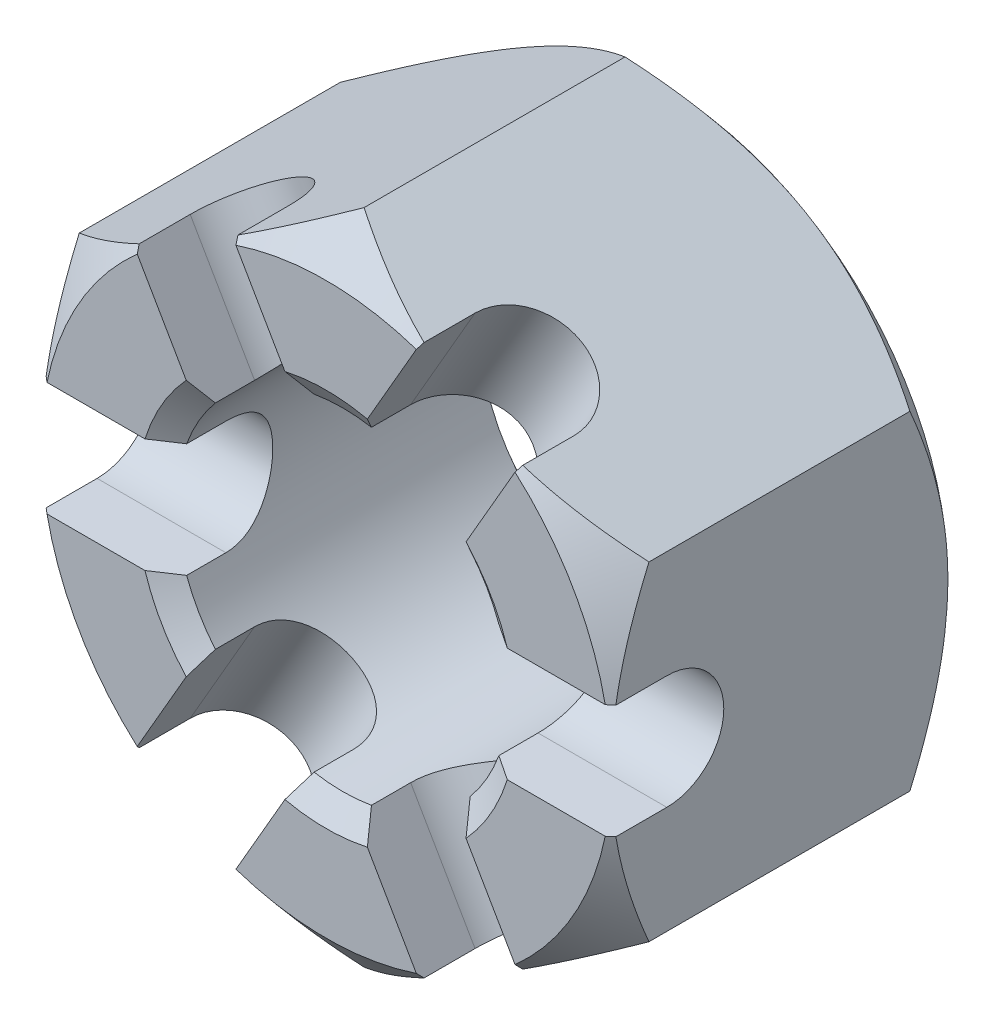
ISO-10303-21;
HEADER;
FILE_DESCRIPTION(('STEP AP214'),'2;1');
FILE_NAME('part.step','',(''),(''),'','','');
FILE_SCHEMA(('AUTOMOTIVE_DESIGN { 1 0 10303 214 1 1 1 1 }'));
ENDSEC;
DATA;
#1=APPLICATION_CONTEXT('core data for automotive mechanical design processes');
#2=APPLICATION_PROTOCOL_DEFINITION('international standard','automotive_design',2000,#1);
#3=PRODUCT_CONTEXT('',#1,'mechanical');
#4=PRODUCT('Part','Part','',(#3));
#5=PRODUCT_RELATED_PRODUCT_CATEGORY('part','',(#4));
#6=PRODUCT_DEFINITION_FORMATION('','',#4);
#7=PRODUCT_DEFINITION_CONTEXT('part definition',#1,'design');
#8=PRODUCT_DEFINITION('design','',#6,#7);
#9=PRODUCT_DEFINITION_SHAPE('','',#8);
#10=(LENGTH_UNIT() NAMED_UNIT(*) SI_UNIT(.MILLI.,.METRE.));
#11=(NAMED_UNIT(*) PLANE_ANGLE_UNIT() SI_UNIT($,.RADIAN.));
#12=(NAMED_UNIT(*) SI_UNIT($,.STERADIAN.) SOLID_ANGLE_UNIT());
#13=UNCERTAINTY_MEASURE_WITH_UNIT(LENGTH_MEASURE(1.E-05),#10,'distance_accuracy_value','');
#14=(GEOMETRIC_REPRESENTATION_CONTEXT(3) GLOBAL_UNCERTAINTY_ASSIGNED_CONTEXT((#13)) GLOBAL_UNIT_ASSIGNED_CONTEXT((#10,
#11,#12)) REPRESENTATION_CONTEXT('',''));
#15=CARTESIAN_POINT('',(0.,0.,0.));
#16=DIRECTION('',(0.,0.,1.));
#17=DIRECTION('',(1.,0.,0.));
#18=AXIS2_PLACEMENT_3D('',#15,#16,#17);
#19=CARTESIAN_POINT('',(0.,0.,-22.5298));
#20=DIRECTION('',(0.,0.,1.));
#21=DIRECTION('',(1.,0.,0.));
#22=AXIS2_PLACEMENT_3D('',#19,#20,#21);
#23=CYLINDRICAL_SURFACE('',#22,11.1125);
#24=CARTESIAN_POINT('',(0.,0.,-1.11157946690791));
#25=DIRECTION('',(0.,0.,1.));
#26=DIRECTION('',(1.,0.,0.));
#27=AXIS2_PLACEMENT_3D('',#24,#25,#26);
#28=CIRCLE('',#27,11.1125);
#29=CARTESIAN_POINT('',(10.4389442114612,-3.81,-1.11157946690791));
#30=VERTEX_POINT('',#29);
#31=CARTESIAN_POINT('',(8.51902889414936,-7.13539087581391,-1.11157946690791));
#32=VERTEX_POINT('',#31);
#33=EDGE_CURVE('E11',#30,#32,#28,.F.);
#34=ORIENTED_EDGE('',*,*,#33,.F.);
#35=DIRECTION('',(0.,0.,1.));
#36=VECTOR('',#35,1.);
#37=CARTESIAN_POINT('',(10.4389442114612,-3.81,-22.5298));
#38=LINE('',#37,#36);
#39=CARTESIAN_POINT('',(10.4389442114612,-3.81,-3.7338));
#40=VERTEX_POINT('',#39);
#41=EDGE_CURVE('E393',#30,#40,#38,.F.);
#42=ORIENTED_EDGE('',*,*,#41,.T.);
#43=CARTESIAN_POINT('',(10.4389442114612,-3.81,-3.7338));
#44=CARTESIAN_POINT('',(10.4389270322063,-3.81001390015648,-3.83755812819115));
#45=CARTESIAN_POINT('',(10.4404907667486,-3.80576182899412,-3.94130670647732));
#46=CARTESIAN_POINT('',(10.4466521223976,-3.78883407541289,-4.14799504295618));
#47=CARTESIAN_POINT('',(10.4512488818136,-3.77616078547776,-4.25093502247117));
#48=CARTESIAN_POINT('',(10.4633298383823,-3.74255067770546,-4.4549613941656));
#49=CARTESIAN_POINT('',(10.4708050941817,-3.72163944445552,-4.55605252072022));
#50=CARTESIAN_POINT('',(10.4883961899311,-3.67177022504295,-4.75596973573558));
#51=CARTESIAN_POINT('',(10.4985121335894,-3.64281192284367,-4.85479573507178));
#52=CARTESIAN_POINT('',(10.5323669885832,-3.54426041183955,-5.14673772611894));
#53=CARTESIAN_POINT('',(10.5596330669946,-3.46293794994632,-5.33563330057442));
#54=CARTESIAN_POINT('',(10.620467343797,-3.27159778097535,-5.69713550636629));
#55=CARTESIAN_POINT('',(10.6540396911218,-3.16156116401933,-5.86973130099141));
#56=CARTESIAN_POINT('',(10.7252512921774,-2.91104637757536,-6.20089958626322));
#57=CARTESIAN_POINT('',(10.7629956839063,-2.76958367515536,-6.35870626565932));
#58=CARTESIAN_POINT('',(10.8374132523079,-2.4623336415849,-6.64887940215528));
#59=CARTESIAN_POINT('',(10.8740862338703,-2.29654191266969,-6.78124124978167));
#60=CARTESIAN_POINT('',(10.9434601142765,-1.93964956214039,-7.02032394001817));
#61=CARTESIAN_POINT('',(10.9760222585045,-1.74797351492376,-7.12622973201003));
#62=CARTESIAN_POINT('',(11.0322530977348,-1.34822430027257,-7.30398178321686));
#63=CARTESIAN_POINT('',(11.0559246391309,-1.14015640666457,-7.37583894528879));
#64=CARTESIAN_POINT('',(11.0909600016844,-0.721613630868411,-7.48082575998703));
#65=CARTESIAN_POINT('',(11.1027429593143,-0.511506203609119,-7.51527779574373));
#66=CARTESIAN_POINT('',(11.1141650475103,-0.08818008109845,-7.54868820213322));
#67=CARTESIAN_POINT('',(11.1138072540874,0.125037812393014,-7.54765556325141));
#68=CARTESIAN_POINT('',(11.1012679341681,0.53913964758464,-7.51094855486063));
#69=CARTESIAN_POINT('',(11.0895773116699,0.740168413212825,-7.47671243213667));
#70=CARTESIAN_POINT('',(11.0563084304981,1.13342964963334,-7.37695758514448));
#71=CARTESIAN_POINT('',(11.0347296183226,1.32566162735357,-7.31143710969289));
#72=CARTESIAN_POINT('',(10.9834997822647,1.69893857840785,-7.15017472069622));
#73=CARTESIAN_POINT('',(10.9537435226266,1.87979706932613,-7.05403602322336));
#74=CARTESIAN_POINT('',(10.8892366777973,2.22323120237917,-6.83458874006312));
#75=CARTESIAN_POINT('',(10.8544846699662,2.38580161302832,-6.71127240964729));
#76=CARTESIAN_POINT('',(10.7816036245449,2.69655710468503,-6.43383878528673));
#77=CARTESIAN_POINT('',(10.7433925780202,2.84363039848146,-6.27849816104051));
#78=CARTESIAN_POINT('',(10.6693121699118,3.11008276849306,-5.9449087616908));
#79=CARTESIAN_POINT('',(10.6334435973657,3.22945254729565,-5.76665232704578));
#80=CARTESIAN_POINT('',(10.5842464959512,3.38591714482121,-5.48410383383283));
#81=CARTESIAN_POINT('',(10.5685009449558,3.43462316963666,-5.38649267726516));
#82=CARTESIAN_POINT('',(10.5391753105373,3.52358264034,-5.18719359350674));
#83=CARTESIAN_POINT('',(10.5255943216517,3.56383962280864,-5.08550739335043));
#84=CARTESIAN_POINT('',(10.5010600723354,3.6354957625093,-4.87888455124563));
#85=CARTESIAN_POINT('',(10.490103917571,3.66690468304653,-4.77395163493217));
#86=CARTESIAN_POINT('',(10.4711773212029,3.72060598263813,-4.56155793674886));
#87=CARTESIAN_POINT('',(10.4632055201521,3.74290251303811,-4.45409832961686));
#88=CARTESIAN_POINT('',(10.4509540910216,3.7769746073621,-4.24472176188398));
#89=CARTESIAN_POINT('',(10.4464630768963,3.7893544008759,-4.14291514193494));
#90=CARTESIAN_POINT('',(10.4404517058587,3.80586883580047,-3.93867503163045));
#91=CARTESIAN_POINT('',(10.4389277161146,3.81001356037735,-3.83624246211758));
#92=CARTESIAN_POINT('',(10.4389442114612,3.81,-3.7338));
#93=B_SPLINE_CURVE_WITH_KNOTS('',3,(#43,#44,#45,#46,#47,#48,#49,#50,#51,#52,#53,#54,#55,#56,#57,
#58,#59,#60,#61,#62,#63,#64,#65,#66,#67,#68,#69,#70,#71,#72,#73,#74,#75,#76,#77,#78,#79,#80,#81,
#82,#83,#84,#85,#86,#87,#88,#89,#90,#91,#92),.UNSPECIFIED.,.F.,.F.,(4,2,2,2,2,2,2,2,2,2,2,2,2,2,
2,2,2,2,2,2,2,2,2,2,4),(0.,0.311159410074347,0.622230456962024,0.932342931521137,
1.24246758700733,1.86176723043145,2.48147575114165,3.12435952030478,3.7673596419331,
4.42823392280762,5.08889643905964,5.72535475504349,6.36165181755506,6.9715638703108,
7.5815100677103,8.19970630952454,8.8180789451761,9.46708892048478,10.1163163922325,
10.4466244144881,10.7767939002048,11.1065976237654,11.4362509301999,11.7438431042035,
12.0510584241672),.UNSPECIFIED.);
#94=CARTESIAN_POINT('',(10.4389442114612,3.81,-3.7338));
#95=VERTEX_POINT('',#94);
#96=EDGE_CURVE('E384',#40,#95,#93,.T.);
#97=ORIENTED_EDGE('',*,*,#96,.T.);
#98=DIRECTION('',(0.,0.,1.));
#99=VECTOR('',#98,1.);
#100=CARTESIAN_POINT('',(10.4389442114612,3.81,-22.5298));
#101=LINE('',#100,#99);
#102=CARTESIAN_POINT('',(10.4389442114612,3.81,-1.11157946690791));
#103=VERTEX_POINT('',#102);
#104=EDGE_CURVE('E366',#95,#103,#101,.T.);
#105=ORIENTED_EDGE('',*,*,#104,.T.);
#106=CARTESIAN_POINT('',(8.51902889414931,7.13539087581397,-1.11157946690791));
#107=VERTEX_POINT('',#106);
#108=EDGE_CURVE('E48',#107,#103,#28,.F.);
#109=ORIENTED_EDGE('',*,*,#108,.F.);
#110=DIRECTION('',(0.,0.,1.));
#111=VECTOR('',#110,1.);
#112=CARTESIAN_POINT('',(8.51902889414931,7.13539087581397,-22.5298));
#113=LINE('',#112,#111);
#114=CARTESIAN_POINT('',(8.51902889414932,7.13539087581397,-3.7338));
#115=VERTEX_POINT('',#114);
#116=EDGE_CURVE('E483',#107,#115,#113,.F.);
#117=ORIENTED_EDGE('',*,*,#116,.T.);
#118=CARTESIAN_POINT('',(1.91991531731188,10.9453908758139,-3.7338));
#119=CARTESIAN_POINT('',(1.91991243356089,10.9453904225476,-3.52665961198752));
#120=CARTESIAN_POINT('',(1.93771040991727,10.94231384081,-3.31953487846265));
#121=CARTESIAN_POINT('',(2.00789515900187,10.9296504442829,-2.91144586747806));
#122=CARTESIAN_POINT('',(2.06028600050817,10.9200628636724,-2.71048231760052));
#123=CARTESIAN_POINT('',(2.19680436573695,10.893414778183,-2.32069849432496));
#124=CARTESIAN_POINT('',(2.28086673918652,10.8763696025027,-2.13185421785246));
#125=CARTESIAN_POINT('',(2.47698704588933,10.8333851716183,-1.77042476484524));
#126=CARTESIAN_POINT('',(2.58905169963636,10.8074437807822,-1.59784350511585));
#127=CARTESIAN_POINT('',(2.84158811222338,10.7438623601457,-1.2666903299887));
#128=CARTESIAN_POINT('',(2.98296994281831,10.705818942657,-1.10888969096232));
#129=CARTESIAN_POINT('',(3.28626422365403,10.6166417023,-0.81872176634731));
#130=CARTESIAN_POINT('',(3.44818018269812,10.5655056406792,-0.68635883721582));
#131=CARTESIAN_POINT('',(3.79194143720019,10.4471402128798,-0.447277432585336));
#132=CARTESIAN_POINT('',(3.97421547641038,10.3795031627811,-0.341373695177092));
#133=CARTESIAN_POINT('',(4.34852346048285,10.2283264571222,-0.163620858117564));
#134=CARTESIAN_POINT('',(4.54055459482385,10.1447913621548,-0.0917620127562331));
#135=CARTESIAN_POINT('',(4.92054606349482,9.96585908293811,0.0132262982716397));
#136=CARTESIAN_POINT('',(5.10839771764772,9.87100873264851,0.0476784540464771));
#137=CARTESIAN_POINT('',(5.48071986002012,9.66923727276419,0.0810881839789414));
#138=CARTESIAN_POINT('',(5.66519125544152,9.56231945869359,0.0800554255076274));
#139=CARTESIAN_POINT('',(6.01754151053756,9.34441088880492,0.0433486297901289));
#140=CARTESIAN_POINT('',(6.18579120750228,9.23377282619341,0.00911271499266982));
#141=CARTESIAN_POINT('',(6.50973104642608,9.00833066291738,-0.0906414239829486));
#142=CARTESIAN_POINT('',(6.66542032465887,8.89352627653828,-0.156161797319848));
#143=CARTESIAN_POINT('',(6.96307375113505,8.66252058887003,-0.317425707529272));
#144=CARTESIAN_POINT('',(7.10482392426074,8.54632138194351,-0.413565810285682));
#145=CARTESIAN_POINT('',(7.36999182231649,8.31874114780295,-0.633008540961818));
#146=CARTESIAN_POINT('',(7.49340423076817,8.20736152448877,-0.756319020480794));
#147=CARTESIAN_POINT('',(7.72610123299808,7.98885223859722,-1.03378143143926));
#148=CARTESIAN_POINT('',(7.83438073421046,7.88220781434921,-1.18916025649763));
#149=CARTESIAN_POINT('',(8.02806996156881,7.6848498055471,-1.52268701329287));
#150=CARTESIAN_POINT('',(8.11347572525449,7.59413898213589,-1.70083888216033));
#151=CARTESIAN_POINT('',(8.26172154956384,7.43262193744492,-2.07856798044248));
#152=CARTESIAN_POINT('',(8.32418245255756,7.36215402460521,-2.27844006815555));
#153=CARTESIAN_POINT('',(8.42378414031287,7.2479876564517,-2.69167117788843));
#154=CARTESIAN_POINT('',(8.46093627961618,7.20427719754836,-2.90502410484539));
#155=CARTESIAN_POINT('',(8.50820983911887,7.14837786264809,-3.3283268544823));
#156=CARTESIAN_POINT('',(8.51952921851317,7.13479286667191,-3.53795850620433));
#157=CARTESIAN_POINT('',(8.51849486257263,7.13602912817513,-3.95705561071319));
#158=CARTESIAN_POINT('',(8.50614575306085,7.15084483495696,-4.16652108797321));
#159=CARTESIAN_POINT('',(8.45889258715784,7.20666556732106,-4.57123384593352));
#160=CARTESIAN_POINT('',(8.42484170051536,7.24667929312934,-4.76672034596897));
#161=CARTESIAN_POINT('',(8.33546335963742,7.34930643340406,-5.14656436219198));
#162=CARTESIAN_POINT('',(8.28013199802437,7.41192399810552,-5.33091982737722));
#163=CARTESIAN_POINT('',(8.14661253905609,7.5584700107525,-5.69003276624));
#164=CARTESIAN_POINT('',(8.06772882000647,7.64303496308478,-5.86427092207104));
#165=CARTESIAN_POINT('',(7.88861937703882,7.82776259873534,-6.19234071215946));
#166=CARTESIAN_POINT('',(7.78838701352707,7.92793013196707,-6.34616597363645));
#167=CARTESIAN_POINT('',(7.56179320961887,8.14448875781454,-6.63721775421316));
#168=CARTESIAN_POINT('',(7.43435399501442,8.26144893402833,-6.77318562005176));
#169=CARTESIAN_POINT('',(7.15844290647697,8.50163263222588,-7.01495464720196));
#170=CARTESIAN_POINT('',(7.00997164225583,8.62485597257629,-7.12075668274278));
#171=CARTESIAN_POINT('',(6.69547386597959,8.87118330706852,-7.29826301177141));
#172=CARTESIAN_POINT('',(6.52956049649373,8.99428340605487,-7.37017226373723));
#173=CARTESIAN_POINT('',(6.18327660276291,9.23575767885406,-7.47813350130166));
#174=CARTESIAN_POINT('',(6.00291166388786,9.35413365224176,-7.51419926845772));
#175=CARTESIAN_POINT('',(5.64209346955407,9.57585822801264,-7.54815354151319));
#176=CARTESIAN_POINT('',(5.46208695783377,9.67966071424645,-7.54784428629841));
#177=CARTESIAN_POINT('',(5.09904773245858,9.8757236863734,-7.51354471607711));
#178=CARTESIAN_POINT('',(4.91601529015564,9.9679852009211,-7.47955740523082));
#179=CARTESIAN_POINT('',(4.55585131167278,10.1375955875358,-7.38008109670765));
#180=CARTESIAN_POINT('',(4.37867262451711,10.2151785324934,-7.31515758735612));
#181=CARTESIAN_POINT('',(4.03217793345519,10.3568465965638,-7.15618299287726));
#182=CARTESIAN_POINT('',(3.8628633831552,10.4209292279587,-7.06212654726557));
#183=CARTESIAN_POINT('',(3.53083026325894,10.5381729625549,-6.84342514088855));
#184=CARTESIAN_POINT('',(3.36861156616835,10.5908226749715,-6.7177479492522));
#185=CARTESIAN_POINT('',(3.06311904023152,10.683186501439,-6.44109893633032));
#186=CARTESIAN_POINT('',(2.91985145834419,10.7228963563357,-6.29011881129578));
#187=CARTESIAN_POINT('',(2.65161153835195,10.7924344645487,-5.95956175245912));
#188=CARTESIAN_POINT('',(2.52766282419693,10.8217765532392,-5.77904877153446));
#189=CARTESIAN_POINT('',(2.3109010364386,10.8701326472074,-5.39893095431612));
#190=CARTESIAN_POINT('',(2.2180821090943,10.8891485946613,-5.1993297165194));
#191=CARTESIAN_POINT('',(2.07012479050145,10.9182333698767,-4.79184051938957));
#192=CARTESIAN_POINT('',(2.01407136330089,10.9285215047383,-4.5843018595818));
#193=CARTESIAN_POINT('',(1.93897554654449,10.9420990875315,-4.16243470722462));
#194=CARTESIAN_POINT('',(1.91991830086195,10.9453913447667,-3.94810897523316));
#195=CARTESIAN_POINT('',(1.91991531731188,10.9453908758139,-3.7338));
#196=B_SPLINE_CURVE_WITH_KNOTS('',3,(#118,#119,#120,#121,#122,#123,#124,#125,#126,#127,#128,
#129,#130,#131,#132,#133,#134,#135,#136,#137,#138,#139,#140,#141,#142,#143,#144,#145,#146,#147,
#148,#149,#150,#151,#152,#153,#154,#155,#156,#157,#158,#159,#160,#161,#162,#163,#164,#165,#166,
#167,#168,#169,#170,#171,#172,#173,#174,#175,#176,#177,#178,#179,#180,#181,#182,#183,#184,#185,
#186,#187,#188,#189,#190,#191,#192,#193,#194,#195),.UNSPECIFIED.,.T.,.F.,(4,2,2,2,2,2,2,2,2,2,2,
2,2,2,2,2,2,2,2,2,2,2,2,2,2,2,2,2,2,2,2,2,2,2,2,2,2,2,4),(0.,0.620626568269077,1.2413261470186,
1.8607558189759,2.48033429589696,3.12322123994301,3.76621818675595,4.42708123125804,
5.08775498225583,5.7242193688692,6.36051036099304,6.9704185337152,7.58036861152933,
8.19856361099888,8.81693748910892,9.46600003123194,10.1151749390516,10.7746401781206,
11.4338093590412,12.0617290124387,12.6895259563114,13.294048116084,13.8986813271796,
14.5233179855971,15.1481491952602,15.8050789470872,16.4619896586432,17.1148752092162,
17.7675096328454,18.3878229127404,19.008080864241,19.6174122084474,20.2268557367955,
20.8596060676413,21.4925644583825,22.1521592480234,22.8116299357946,23.4539927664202,
24.0960975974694),.UNSPECIFIED.);
#197=CARTESIAN_POINT('',(1.91991531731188,10.9453908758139,-3.7338));
#198=VERTEX_POINT('',#197);
#199=EDGE_CURVE('E477',#115,#198,#196,.T.);
#200=ORIENTED_EDGE('',*,*,#199,.T.);
#201=DIRECTION('',(0.,0.,1.));
#202=VECTOR('',#201,1.);
#203=CARTESIAN_POINT('',(1.91991531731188,10.9453908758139,-22.5298));
#204=LINE('',#203,#202);
#205=CARTESIAN_POINT('',(1.91991531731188,10.9453908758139,-1.11157946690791));
#206=VERTEX_POINT('',#205);
#207=EDGE_CURVE('E484',#198,#206,#204,.T.);
#208=ORIENTED_EDGE('',*,*,#207,.T.);
#209=CARTESIAN_POINT('',(-1.91991531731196,10.9453908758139,-1.11157946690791));
#210=VERTEX_POINT('',#209);
#211=EDGE_CURVE('E749',#210,#206,#28,.F.);
#212=ORIENTED_EDGE('',*,*,#211,.F.);
#213=DIRECTION('',(0.,0.,1.));
#214=VECTOR('',#213,1.);
#215=CARTESIAN_POINT('',(-1.91991531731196,10.9453908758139,-22.5298));
#216=LINE('',#215,#214);
#217=CARTESIAN_POINT('',(-1.91991531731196,10.9453908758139,-3.7338));
#218=VERTEX_POINT('',#217);
#219=EDGE_CURVE('E449',#210,#218,#216,.F.);
#220=ORIENTED_EDGE('',*,*,#219,.T.);
#221=CARTESIAN_POINT('',(-8.51902889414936,7.1353908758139,-3.7338));
#222=CARTESIAN_POINT('',(-8.51902994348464,7.13538815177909,-3.52665961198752));
#223=CARTESIAN_POINT('',(-8.5074665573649,7.14926336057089,-3.31953487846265));
#224=CARTESIAN_POINT('',(-8.46140735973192,7.20371343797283,-2.91144586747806));
#225=CARTESIAN_POINT('',(-8.42690885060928,7.24429144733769,-2.71048231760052));
#226=CARTESIAN_POINT('',(-8.33557174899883,7.34919577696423,-2.32069849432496));
#227=CARTESIAN_POINT('',(-8.27877900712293,7.41347334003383,-2.13185421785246));
#228=CARTESIAN_POINT('',(-8.14349324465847,7.56182629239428,-1.77042476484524));
#229=CARTESIAN_POINT('',(-8.06499501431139,7.64590643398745,-1.59784350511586));
#230=CARTESIAN_POINT('',(-7.88366368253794,7.83281867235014,-1.2666903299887));
#231=CARTESIAN_POINT('',(-7.78002620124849,7.93623722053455,-1.10888969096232));
#232=CARTESIAN_POINT('',(-7.55114930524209,8.15430915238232,-0.818721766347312));
#233=CARTESIAN_POINT('',(-7.42590619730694,8.26896445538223,-0.686358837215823));
#234=CARTESIAN_POINT('',(-7.15151810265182,8.50748772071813,-0.447277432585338));
#235=CARTESIAN_POINT('',(-7.0018056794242,8.6315231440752,-0.341373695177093));
#236=CARTESIAN_POINT('',(-6.68372881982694,8.88009501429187,-0.163620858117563));
#237=CARTESIAN_POINT('',(-6.51536973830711,9.004631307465,-0.0917620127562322));
#238=CARTESIAN_POINT('',(-6.17041410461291,9.24424743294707,0.0132262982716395));
#239=CARTESIAN_POINT('',(-5.99434546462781,9.35950656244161,0.0476784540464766));
#240=CARTESIAN_POINT('',(-5.63344518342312,9.5810612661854,0.0810881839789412));
#241=CARTESIAN_POINT('',(-5.44861594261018,9.68735927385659,0.0800554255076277));
#242=CARTESIAN_POINT('',(-5.08372645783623,9.88354926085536,0.0433486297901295));
#243=CARTESIAN_POINT('',(-4.90378623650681,9.97393874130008,0.00911271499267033));
#244=CARTESIAN_POINT('',(-4.54657767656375,10.1417577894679,-0.0906414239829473));
#245=CARTESIAN_POINT('',(-4.36930952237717,10.2191864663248,-0.156161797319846));
#246=CARTESIAN_POINT('',(-4.02042601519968,10.3614590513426,-0.317425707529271));
#247=CARTESIAN_POINT('',(-3.84891946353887,10.426118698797,-0.413565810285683));
#248=CARTESIAN_POINT('',(-3.51924525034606,10.5419707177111,-0.633008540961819));
#249=CARTESIAN_POINT('',(-3.36108146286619,10.5931591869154,-0.756319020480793));
#250=CARTESIAN_POINT('',(-3.05549836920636,10.6854260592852,-1.03378143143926));
#251=CARTESIAN_POINT('',(-2.90900183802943,10.7258766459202,-1.18916025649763));
#252=CARTESIAN_POINT('',(-2.64124017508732,10.7949374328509,-1.52268701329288));
#253=CARTESIAN_POINT('',(-2.51997941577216,10.8235455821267,-1.70083888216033));
#254=CARTESIAN_POINT('',(-2.30597863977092,10.8711717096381,-2.07856798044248));
#255=CARTESIAN_POINT('',(-2.2137211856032,10.8900304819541,-2.27844006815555));
#256=CARTESIAN_POINT('',(-2.0650493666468,10.9192048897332,-2.69167117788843));
#257=CARTESIAN_POINT('',(-2.00861892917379,10.9295243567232,-2.90502410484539));
#258=CARTESIAN_POINT('',(-1.93657190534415,10.9425147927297,-3.3283268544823));
#259=CARTESIAN_POINT('',(-1.91914726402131,10.9455251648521,-3.53795850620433));
#260=CARTESIAN_POINT('',(-1.92073507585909,10.9452475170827,-3.95705561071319));
#261=CARTESIAN_POINT('',(-1.93974040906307,10.9419607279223,-4.16652108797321));
#262=CARTESIAN_POINT('',(-2.01170916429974,10.9289486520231,-4.57123384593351));
#263=CARTESIAN_POINT('',(-2.06338751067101,10.9194665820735,-4.76672034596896));
#264=CARTESIAN_POINT('',(-2.19695439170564,10.8933762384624,-5.14656436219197));
#265=CARTESIAN_POINT('',(-2.27884847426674,10.8767666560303,-5.33091982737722));
#266=CARTESIAN_POINT('',(-2.47252077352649,10.8344084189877,-5.69003276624));
#267=CARTESIAN_POINT('',(-2.58519803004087,10.8083755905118,-5.86427092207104));
#268=CARTESIAN_POINT('',(-2.83473157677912,10.7456260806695,-6.19234071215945));
#269=CARTESIAN_POINT('',(-2.97159538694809,10.7089060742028,-6.34616597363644));
#270=CARTESIAN_POINT('',(-3.27243756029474,10.6209493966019,-6.63721775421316));
#271=CARTESIAN_POINT('',(-3.43744765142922,10.569063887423,-6.77318562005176));
#272=CARTESIAN_POINT('',(-3.78340837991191,10.4502097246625,-7.01495464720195));
#273=CARTESIAN_POINT('',(-3.96435855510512,10.3832415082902,-7.12075668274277));
#274=CARTESIAN_POINT('',(-4.33493317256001,10.2340421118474,-7.29826301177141));
#275=CARTESIAN_POINT('',(-4.5244976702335,10.1519069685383,-7.37017226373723));
#276=CARTESIAN_POINT('',(-4.90676247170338,9.97275345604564,-7.47813350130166));
#277=CARTESIAN_POINT('',(-5.09946154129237,9.87574082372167,-7.51419926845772));
#278=CARTESIAN_POINT('',(-5.47188975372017,9.67412538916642,-7.54815354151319));
#279=CARTESIAN_POINT('',(-5.65178859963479,9.57013642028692,-7.54784428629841));
#280=CARTESIAN_POINT('',(-6.0031037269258,9.35376671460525,-7.51354471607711));
#281=CARTESIAN_POINT('',(-6.1745207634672,9.24138672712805,-7.47955740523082));
#282=CARTESIAN_POINT('',(-6.50148965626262,9.01428076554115,-7.38008109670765));
#283=CARTESIAN_POINT('',(-6.65726780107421,8.899630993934,-7.31515758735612));
#284=CARTESIAN_POINT('',(-6.95320328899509,8.67039182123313,-7.15618299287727));
#285=CARTESIAN_POINT('',(-7.09335775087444,8.55580243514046,-7.06212654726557));
#286=CARTESIAN_POINT('',(-7.36091036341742,8.32687518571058,-6.84342514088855));
#287=CARTESIAN_POINT('',(-7.48761570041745,8.21271452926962,-6.7177479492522));
#288=CARTESIAN_POINT('',(-7.72035138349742,7.99433215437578,-6.44109893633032));
#289=CARTESIAN_POINT('',(-7.82637491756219,7.89011371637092,-6.29011881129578));
#290=CARTESIAN_POINT('',(-8.02071664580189,7.69258018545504,-5.95956175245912));
#291=CARTESIAN_POINT('',(-8.10810199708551,7.59990849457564,-5.77904877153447));
#292=CARTESIAN_POINT('',(-8.25836049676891,7.43636532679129,-5.39893095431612));
#293=CARTESIAN_POINT('',(-8.32123825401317,7.36548975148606,-5.19932971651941));
#294=CARTESIAN_POINT('',(-8.42040506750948,7.25189734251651,-4.79184051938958));
#295=CARTESIAN_POINT('',(-8.45734156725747,7.20849771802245,-4.58430185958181));
#296=CARTESIAN_POINT('',(-8.50664800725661,7.15025162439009,-4.16243470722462));
#297=CARTESIAN_POINT('',(-8.51902780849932,7.13539369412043,-3.94810897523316));
#298=CARTESIAN_POINT('',(-8.51902889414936,7.1353908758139,-3.7338));
#299=B_SPLINE_CURVE_WITH_KNOTS('',3,(#221,#222,#223,#224,#225,#226,#227,#228,#229,#230,#231,
#232,#233,#234,#235,#236,#237,#238,#239,#240,#241,#242,#243,#244,#245,#246,#247,#248,#249,#250,
#251,#252,#253,#254,#255,#256,#257,#258,#259,#260,#261,#262,#263,#264,#265,#266,#267,#268,#269,
#270,#271,#272,#273,#274,#275,#276,#277,#278,#279,#280,#281,#282,#283,#284,#285,#286,#287,#288,
#289,#290,#291,#292,#293,#294,#295,#296,#297,#298),.UNSPECIFIED.,.T.,.F.,(4,2,2,2,2,2,2,2,2,2,2,
2,2,2,2,2,2,2,2,2,2,2,2,2,2,2,2,2,2,2,2,2,2,2,2,2,2,2,4),(0.,0.620626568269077,1.2413261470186,
1.8607558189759,2.48033429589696,3.12322123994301,3.76621818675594,4.42708123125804,
5.08775498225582,5.7242193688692,6.36051036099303,6.97041853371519,7.58036861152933,
8.19856361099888,8.81693748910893,9.46600003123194,10.1151749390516,10.7746401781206,
11.4338093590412,12.0617290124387,12.6895259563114,13.294048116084,13.8986813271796,
14.5233179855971,15.1481491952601,15.8050789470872,16.4619896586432,17.1148752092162,
17.7675096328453,18.3878229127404,19.008080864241,19.6174122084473,20.2268557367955,
20.8596060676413,21.4925644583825,22.1521592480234,22.8116299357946,23.4539927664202,
24.0960975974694),.UNSPECIFIED.);
#300=CARTESIAN_POINT('',(-8.51902889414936,7.1353908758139,-3.7338));
#301=VERTEX_POINT('',#300);
#302=EDGE_CURVE('E443',#218,#301,#299,.T.);
#303=ORIENTED_EDGE('',*,*,#302,.T.);
#304=DIRECTION('',(0.,0.,1.));
#305=VECTOR('',#304,1.);
#306=CARTESIAN_POINT('',(-8.51902889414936,7.1353908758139,-22.5298));
#307=LINE('',#306,#305);
#308=CARTESIAN_POINT('',(-8.51902889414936,7.1353908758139,-1.11157946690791));
#309=VERTEX_POINT('',#308);
#310=EDGE_CURVE('E452',#301,#309,#307,.T.);
#311=ORIENTED_EDGE('',*,*,#310,.T.);
#312=CARTESIAN_POINT('',(-10.4389442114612,3.81,-1.11157946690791));
#313=VERTEX_POINT('',#312);
#314=EDGE_CURVE('E742',#313,#309,#28,.F.);
#315=ORIENTED_EDGE('',*,*,#314,.F.);
#316=DIRECTION('',(0.,0.,1.));
#317=VECTOR('',#316,1.);
#318=CARTESIAN_POINT('',(-10.4389442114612,3.81,-22.5298));
#319=LINE('',#318,#317);
#320=CARTESIAN_POINT('',(-10.4389442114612,3.81,-3.7338));
#321=VERTEX_POINT('',#320);
#322=EDGE_CURVE('E416',#313,#321,#319,.F.);
#323=ORIENTED_EDGE('',*,*,#322,.T.);
#324=CARTESIAN_POINT('',(-10.4389442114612,3.81,-3.7338));
#325=CARTESIAN_POINT('',(-10.4389270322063,3.81001390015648,-3.83755812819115));
#326=CARTESIAN_POINT('',(-10.4404907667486,3.80576182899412,-3.94130670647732));
#327=CARTESIAN_POINT('',(-10.4466521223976,3.78883407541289,-4.14799504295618));
#328=CARTESIAN_POINT('',(-10.4512488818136,3.77616078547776,-4.25093502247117));
#329=CARTESIAN_POINT('',(-10.4633298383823,3.74255067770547,-4.4549613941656));
#330=CARTESIAN_POINT('',(-10.4708050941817,3.72163944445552,-4.55605252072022));
#331=CARTESIAN_POINT('',(-10.4883961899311,3.67177022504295,-4.75596973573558));
#332=CARTESIAN_POINT('',(-10.4985121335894,3.64281192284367,-4.85479573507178));
#333=CARTESIAN_POINT('',(-10.5323669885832,3.54426041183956,-5.14673772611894));
#334=CARTESIAN_POINT('',(-10.5596330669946,3.46293794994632,-5.33563330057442));
#335=CARTESIAN_POINT('',(-10.620467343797,3.27159778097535,-5.69713550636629));
#336=CARTESIAN_POINT('',(-10.6540396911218,3.16156116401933,-5.86973130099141));
#337=CARTESIAN_POINT('',(-10.7252512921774,2.91104637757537,-6.20089958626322));
#338=CARTESIAN_POINT('',(-10.7629956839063,2.76958367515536,-6.35870626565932));
#339=CARTESIAN_POINT('',(-10.8374132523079,2.46233364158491,-6.64887940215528));
#340=CARTESIAN_POINT('',(-10.8740862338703,2.29654191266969,-6.78124124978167));
#341=CARTESIAN_POINT('',(-10.9434601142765,1.93964956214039,-7.02032394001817));
#342=CARTESIAN_POINT('',(-10.9760222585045,1.74797351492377,-7.12622973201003));
#343=CARTESIAN_POINT('',(-11.0322530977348,1.34822430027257,-7.30398178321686));
#344=CARTESIAN_POINT('',(-11.0559246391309,1.14015640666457,-7.37583894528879));
#345=CARTESIAN_POINT('',(-11.0909600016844,0.721613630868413,-7.48082575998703));
#346=CARTESIAN_POINT('',(-11.1027429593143,0.511506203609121,-7.51527779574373));
#347=CARTESIAN_POINT('',(-11.1141650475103,0.0881800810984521,-7.54868820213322));
#348=CARTESIAN_POINT('',(-11.1138072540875,-0.125037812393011,-7.54765556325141));
#349=CARTESIAN_POINT('',(-11.1012679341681,-0.539139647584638,-7.51094855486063));
#350=CARTESIAN_POINT('',(-11.0895773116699,-0.740168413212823,-7.47671243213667));
#351=CARTESIAN_POINT('',(-11.0563084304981,-1.13342964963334,-7.37695758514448));
#352=CARTESIAN_POINT('',(-11.0347296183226,-1.32566162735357,-7.31143710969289));
#353=CARTESIAN_POINT('',(-10.9834997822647,-1.69893857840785,-7.15017472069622));
#354=CARTESIAN_POINT('',(-10.9537435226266,-1.87979706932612,-7.05403602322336));
#355=CARTESIAN_POINT('',(-10.8892366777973,-2.22323120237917,-6.83458874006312));
#356=CARTESIAN_POINT('',(-10.8544846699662,-2.38580161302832,-6.71127240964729));
#357=CARTESIAN_POINT('',(-10.7816036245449,-2.69655710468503,-6.43383878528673));
#358=CARTESIAN_POINT('',(-10.7433925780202,-2.84363039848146,-6.27849816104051));
#359=CARTESIAN_POINT('',(-10.6693121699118,-3.11008276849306,-5.9449087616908));
#360=CARTESIAN_POINT('',(-10.6334435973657,-3.22945254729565,-5.76665232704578));
#361=CARTESIAN_POINT('',(-10.5842464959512,-3.38591714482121,-5.48410383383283));
#362=CARTESIAN_POINT('',(-10.5685009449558,-3.43462316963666,-5.38649267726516));
#363=CARTESIAN_POINT('',(-10.5391753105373,-3.52358264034,-5.18719359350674));
#364=CARTESIAN_POINT('',(-10.5255943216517,-3.56383962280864,-5.08550739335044));
#365=CARTESIAN_POINT('',(-10.5010600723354,-3.6354957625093,-4.87888455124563));
#366=CARTESIAN_POINT('',(-10.490103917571,-3.66690468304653,-4.77395163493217));
#367=CARTESIAN_POINT('',(-10.4711773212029,-3.72060598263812,-4.56155793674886));
#368=CARTESIAN_POINT('',(-10.4632055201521,-3.74290251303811,-4.45409832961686));
#369=CARTESIAN_POINT('',(-10.4509540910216,-3.7769746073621,-4.24472176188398));
#370=CARTESIAN_POINT('',(-10.4464630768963,-3.78935440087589,-4.14291514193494));
#371=CARTESIAN_POINT('',(-10.4404517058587,-3.80586883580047,-3.93867503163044));
#372=CARTESIAN_POINT('',(-10.4389277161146,-3.81001356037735,-3.83624246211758));
#373=CARTESIAN_POINT('',(-10.4389442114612,-3.81,-3.7338));
#374=B_SPLINE_CURVE_WITH_KNOTS('',3,(#324,#325,#326,#327,#328,#329,#330,#331,#332,#333,#334,
#335,#336,#337,#338,#339,#340,#341,#342,#343,#344,#345,#346,#347,#348,#349,#350,#351,#352,#353,
#354,#355,#356,#357,#358,#359,#360,#361,#362,#363,#364,#365,#366,#367,#368,#369,#370,#371,#372,
#373),.UNSPECIFIED.,.F.,.F.,(4,2,2,2,2,2,2,2,2,2,2,2,2,2,2,2,2,2,2,2,2,2,2,2,4),(0.,
0.311159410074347,0.622230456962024,0.932342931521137,1.24246758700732,1.86176723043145,
2.48147575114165,3.12435952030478,3.7673596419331,4.42823392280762,5.08889643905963,
5.72535475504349,6.36165181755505,6.9715638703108,7.5815100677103,8.19970630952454,
8.8180789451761,9.46708892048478,10.1163163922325,10.4466244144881,10.7767939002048,
11.1065976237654,11.4362509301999,11.7438431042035,12.0510584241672),.UNSPECIFIED.);
#375=CARTESIAN_POINT('',(-10.4389442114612,-3.81,-3.7338));
#376=VERTEX_POINT('',#375);
#377=EDGE_CURVE('E408',#321,#376,#374,.T.);
#378=ORIENTED_EDGE('',*,*,#377,.T.);
#379=DIRECTION('',(0.,0.,1.));
#380=VECTOR('',#379,1.);
#381=CARTESIAN_POINT('',(-10.4389442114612,-3.80999999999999,-22.5298));
#382=LINE('',#381,#380);
#383=CARTESIAN_POINT('',(-10.4389442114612,-3.81,-1.11157946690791));
#384=VERTEX_POINT('',#383);
#385=EDGE_CURVE('E415',#376,#384,#382,.T.);
#386=ORIENTED_EDGE('',*,*,#385,.T.);
#387=CARTESIAN_POINT('',(-8.51902889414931,-7.13539087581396,-1.11157946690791));
#388=VERTEX_POINT('',#387);
#389=EDGE_CURVE('E748',#388,#384,#28,.F.);
#390=ORIENTED_EDGE('',*,*,#389,.F.);
#391=DIRECTION('',(0.,0.,1.));
#392=VECTOR('',#391,1.);
#393=CARTESIAN_POINT('',(-8.51902889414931,-7.13539087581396,-22.5298));
#394=LINE('',#393,#392);
#395=CARTESIAN_POINT('',(-8.51902889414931,-7.13539087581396,-3.7338));
#396=VERTEX_POINT('',#395);
#397=EDGE_CURVE('E455',#388,#396,#394,.F.);
#398=ORIENTED_EDGE('',*,*,#397,.T.);
#399=CARTESIAN_POINT('',(-8.51902889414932,-7.13539087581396,-3.7338));
#400=CARTESIAN_POINT('',(-8.5190299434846,-7.13538815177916,-3.94094038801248));
#401=CARTESIAN_POINT('',(-8.50746655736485,-7.14926336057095,-4.14806512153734));
#402=CARTESIAN_POINT('',(-8.46140735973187,-7.20371343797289,-4.55615413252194));
#403=CARTESIAN_POINT('',(-8.42690885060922,-7.24429144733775,-4.75711768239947));
#404=CARTESIAN_POINT('',(-8.33557174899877,-7.34919577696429,-5.14690150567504));
#405=CARTESIAN_POINT('',(-8.27877900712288,-7.41347334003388,-5.33574578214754));
#406=CARTESIAN_POINT('',(-8.14349324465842,-7.56182629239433,-5.69717523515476));
#407=CARTESIAN_POINT('',(-8.06499501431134,-7.64590643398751,-5.86975649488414));
#408=CARTESIAN_POINT('',(-7.88366368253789,-7.83281867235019,-6.20090967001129));
#409=CARTESIAN_POINT('',(-7.78002620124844,-7.93623722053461,-6.35871030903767));
#410=CARTESIAN_POINT('',(-7.55114930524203,-8.15430915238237,-6.64887823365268));
#411=CARTESIAN_POINT('',(-7.42590619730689,-8.26896445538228,-6.78124116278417));
#412=CARTESIAN_POINT('',(-7.15151810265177,-8.50748772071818,-7.02032256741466));
#413=CARTESIAN_POINT('',(-7.00180567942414,-8.63152314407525,-7.1262263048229));
#414=CARTESIAN_POINT('',(-6.68372881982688,-8.88009501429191,-7.30397914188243));
#415=CARTESIAN_POINT('',(-6.51536973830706,-9.00463130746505,-7.37583798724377));
#416=CARTESIAN_POINT('',(-6.17041410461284,-9.24424743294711,-7.48082629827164));
#417=CARTESIAN_POINT('',(-5.99434546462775,-9.35950656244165,-7.51527845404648));
#418=CARTESIAN_POINT('',(-5.63344518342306,-9.58106126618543,-7.54868818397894));
#419=CARTESIAN_POINT('',(-5.44861594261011,-9.68735927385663,-7.54765542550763));
#420=CARTESIAN_POINT('',(-5.08372645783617,-9.88354926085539,-7.51094862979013));
#421=CARTESIAN_POINT('',(-4.90378623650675,-9.97393874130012,-7.47671271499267));
#422=CARTESIAN_POINT('',(-4.54657767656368,-10.141757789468,-7.37695857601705));
#423=CARTESIAN_POINT('',(-4.3693095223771,-10.2191864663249,-7.31143820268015));
#424=CARTESIAN_POINT('',(-4.02042601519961,-10.3614590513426,-7.15017429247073));
#425=CARTESIAN_POINT('',(-3.84891946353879,-10.426118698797,-7.05403418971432));
#426=CARTESIAN_POINT('',(-3.51924525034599,-10.5419707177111,-6.83459145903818));
#427=CARTESIAN_POINT('',(-3.36108146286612,-10.5931591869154,-6.7112809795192));
#428=CARTESIAN_POINT('',(-3.05549836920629,-10.6854260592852,-6.43381856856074));
#429=CARTESIAN_POINT('',(-2.90900183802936,-10.7258766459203,-6.27843974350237));
#430=CARTESIAN_POINT('',(-2.64124017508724,-10.7949374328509,-5.94491298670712));
#431=CARTESIAN_POINT('',(-2.51997941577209,-10.8235455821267,-5.76676111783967));
#432=CARTESIAN_POINT('',(-2.30597863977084,-10.8711717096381,-5.38903201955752));
#433=CARTESIAN_POINT('',(-2.21372118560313,-10.8900304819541,-5.18915993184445));
#434=CARTESIAN_POINT('',(-2.06504936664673,-10.9192048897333,-4.77592882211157));
#435=CARTESIAN_POINT('',(-2.00861892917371,-10.9295243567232,-4.56257589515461));
#436=CARTESIAN_POINT('',(-1.93657190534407,-10.9425147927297,-4.1392731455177));
#437=CARTESIAN_POINT('',(-1.91914726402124,-10.9455251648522,-3.92964149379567));
#438=CARTESIAN_POINT('',(-1.92073507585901,-10.9452475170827,-3.51054438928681));
#439=CARTESIAN_POINT('',(-1.93974040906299,-10.9419607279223,-3.30107891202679));
#440=CARTESIAN_POINT('',(-2.01170916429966,-10.9289486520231,-2.89636615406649));
#441=CARTESIAN_POINT('',(-2.06338751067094,-10.9194665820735,-2.70087965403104));
#442=CARTESIAN_POINT('',(-2.19695439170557,-10.8933762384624,-2.32103563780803));
#443=CARTESIAN_POINT('',(-2.27884847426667,-10.8767666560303,-2.13668017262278));
#444=CARTESIAN_POINT('',(-2.47252077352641,-10.8344084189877,-1.77756723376));
#445=CARTESIAN_POINT('',(-2.5851980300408,-10.8083755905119,-1.60332907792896));
#446=CARTESIAN_POINT('',(-2.83473157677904,-10.7456260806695,-1.27525928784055));
#447=CARTESIAN_POINT('',(-2.97159538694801,-10.7089060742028,-1.12143402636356));
#448=CARTESIAN_POINT('',(-3.27243756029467,-10.6209493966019,-0.830382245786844));
#449=CARTESIAN_POINT('',(-3.43744765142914,-10.569063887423,-0.694414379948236));
#450=CARTESIAN_POINT('',(-3.78340837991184,-10.4502097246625,-0.452645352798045));
#451=CARTESIAN_POINT('',(-3.96435855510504,-10.3832415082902,-0.346843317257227));
#452=CARTESIAN_POINT('',(-4.33493317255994,-10.2340421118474,-0.169336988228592));
#453=CARTESIAN_POINT('',(-4.52449767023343,-10.1519069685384,-0.0974277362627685));
#454=CARTESIAN_POINT('',(-4.90676247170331,-9.97275345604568,0.0105335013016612));
#455=CARTESIAN_POINT('',(-5.0994615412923,-9.8757408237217,0.0465992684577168));
#456=CARTESIAN_POINT('',(-5.4718897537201,-9.67412538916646,0.0805535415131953));
#457=CARTESIAN_POINT('',(-5.65178859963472,-9.57013642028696,0.0802442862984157));
#458=CARTESIAN_POINT('',(-6.00310372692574,-9.35376671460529,0.0459447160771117));
#459=CARTESIAN_POINT('',(-6.17452076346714,-9.2413867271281,0.011957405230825));
#460=CARTESIAN_POINT('',(-6.50148965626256,-9.01428076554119,-0.0875189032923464));
#461=CARTESIAN_POINT('',(-6.65726780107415,-8.89963099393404,-0.152442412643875));
#462=CARTESIAN_POINT('',(-6.95320328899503,-8.67039182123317,-0.311417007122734));
#463=CARTESIAN_POINT('',(-7.09335775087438,-8.55580243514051,-0.405473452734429));
#464=CARTESIAN_POINT('',(-7.36091036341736,-8.32687518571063,-0.62417485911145));
#465=CARTESIAN_POINT('',(-7.48761570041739,-8.21271452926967,-0.749852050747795));
#466=CARTESIAN_POINT('',(-7.72035138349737,-7.99433215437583,-1.02650106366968));
#467=CARTESIAN_POINT('',(-7.82637491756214,-7.89011371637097,-1.17748118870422));
#468=CARTESIAN_POINT('',(-8.02071664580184,-7.69258018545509,-1.50803824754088));
#469=CARTESIAN_POINT('',(-8.10810199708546,-7.5999084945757,-1.68855122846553));
#470=CARTESIAN_POINT('',(-8.25836049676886,-7.43636532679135,-2.06866904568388));
#471=CARTESIAN_POINT('',(-8.32123825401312,-7.36548975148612,-2.26827028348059));
#472=CARTESIAN_POINT('',(-8.42040506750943,-7.25189734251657,-2.67575948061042));
#473=CARTESIAN_POINT('',(-8.45734156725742,-7.20849771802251,-2.88329814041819));
#474=CARTESIAN_POINT('',(-8.50664800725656,-7.15025162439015,-3.30516529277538));
#475=CARTESIAN_POINT('',(-8.51902780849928,-7.13539369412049,-3.51949102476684));
#476=CARTESIAN_POINT('',(-8.51902889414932,-7.13539087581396,-3.7338));
#477=B_SPLINE_CURVE_WITH_KNOTS('',3,(#399,#400,#401,#402,#403,#404,#405,#406,#407,#408,#409,
#410,#411,#412,#413,#414,#415,#416,#417,#418,#419,#420,#421,#422,#423,#424,#425,#426,#427,#428,
#429,#430,#431,#432,#433,#434,#435,#436,#437,#438,#439,#440,#441,#442,#443,#444,#445,#446,#447,
#448,#449,#450,#451,#452,#453,#454,#455,#456,#457,#458,#459,#460,#461,#462,#463,#464,#465,#466,
#467,#468,#469,#470,#471,#472,#473,#474,#475,#476),.UNSPECIFIED.,.T.,.F.,(4,2,2,2,2,2,2,2,2,2,2,
2,2,2,2,2,2,2,2,2,2,2,2,2,2,2,2,2,2,2,2,2,2,2,2,2,2,2,4),(0.,0.620626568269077,1.24132614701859,
1.8607558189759,2.48033429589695,3.12322123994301,3.76621818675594,4.42708123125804,
5.08775498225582,5.72421936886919,6.36051036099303,6.97041853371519,7.58036861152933,
8.19856361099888,8.81693748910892,9.46600003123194,10.1151749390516,10.7746401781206,
11.4338093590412,12.0617290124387,12.6895259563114,13.294048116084,13.8986813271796,
14.5233179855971,15.1481491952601,15.8050789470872,16.4619896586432,17.1148752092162,
17.7675096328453,18.3878229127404,19.008080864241,19.6174122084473,20.2268557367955,
20.8596060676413,21.4925644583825,22.1521592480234,22.8116299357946,23.4539927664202,
24.0960975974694),.UNSPECIFIED.);
#478=CARTESIAN_POINT('',(-1.91991531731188,-10.9453908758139,-3.7338));
#479=VERTEX_POINT('',#478);
#480=EDGE_CURVE('E457',#396,#479,#477,.T.);
#481=ORIENTED_EDGE('',*,*,#480,.T.);
#482=DIRECTION('',(0.,0.,1.));
#483=VECTOR('',#482,1.);
#484=CARTESIAN_POINT('',(-1.91991531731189,-10.9453908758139,-22.5298));
#485=LINE('',#484,#483);
#486=CARTESIAN_POINT('',(-1.91991531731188,-10.9453908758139,-1.11157946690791));
#487=VERTEX_POINT('',#486);
#488=EDGE_CURVE('E464',#479,#487,#485,.T.);
#489=ORIENTED_EDGE('',*,*,#488,.T.);
#490=CARTESIAN_POINT('',(1.91991531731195,-10.9453908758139,-1.11157946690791));
#491=VERTEX_POINT('',#490);
#492=EDGE_CURVE('E46',#491,#487,#28,.F.);
#493=ORIENTED_EDGE('',*,*,#492,.F.);
#494=DIRECTION('',(0.,0.,1.));
#495=VECTOR('',#494,1.);
#496=CARTESIAN_POINT('',(1.91991531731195,-10.9453908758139,-22.5298));
#497=LINE('',#496,#495);
#498=CARTESIAN_POINT('',(1.91991531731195,-10.9453908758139,-3.7338));
#499=VERTEX_POINT('',#498);
#500=EDGE_CURVE('E426',#491,#499,#497,.F.);
#501=ORIENTED_EDGE('',*,*,#500,.T.);
#502=CARTESIAN_POINT('',(1.91991531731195,-10.9453908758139,-3.7338));
#503=CARTESIAN_POINT('',(1.91991243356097,-10.9453904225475,-3.94094038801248));
#504=CARTESIAN_POINT('',(1.93771040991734,-10.94231384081,-4.14806512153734));
#505=CARTESIAN_POINT('',(2.00789515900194,-10.9296504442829,-4.55615413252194));
#506=CARTESIAN_POINT('',(2.06028600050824,-10.9200628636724,-4.75711768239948));
#507=CARTESIAN_POINT('',(2.19680436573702,-10.893414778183,-5.14690150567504));
#508=CARTESIAN_POINT('',(2.2808667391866,-10.8763696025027,-5.33574578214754));
#509=CARTESIAN_POINT('',(2.4769870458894,-10.8333851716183,-5.69717523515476));
#510=CARTESIAN_POINT('',(2.58905169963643,-10.8074437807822,-5.86975649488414));
#511=CARTESIAN_POINT('',(2.84158811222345,-10.7438623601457,-6.2009096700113));
#512=CARTESIAN_POINT('',(2.98296994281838,-10.705818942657,-6.35871030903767));
#513=CARTESIAN_POINT('',(3.2862642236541,-10.6166417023,-6.64887823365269));
#514=CARTESIAN_POINT('',(3.44818018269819,-10.5655056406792,-6.78124116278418));
#515=CARTESIAN_POINT('',(3.79194143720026,-10.4471402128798,-7.02032256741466));
#516=CARTESIAN_POINT('',(3.97421547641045,-10.3795031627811,-7.1262263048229));
#517=CARTESIAN_POINT('',(4.34852346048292,-10.2283264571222,-7.30397914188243));
#518=CARTESIAN_POINT('',(4.54055459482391,-10.1447913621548,-7.37583798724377));
#519=CARTESIAN_POINT('',(4.92054606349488,-9.96585908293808,-7.48082629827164));
#520=CARTESIAN_POINT('',(5.10839771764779,-9.87100873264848,-7.51527845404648));
#521=CARTESIAN_POINT('',(5.48071986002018,-9.66923727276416,-7.54868818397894));
#522=CARTESIAN_POINT('',(5.66519125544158,-9.56231945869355,-7.54765542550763));
#523=CARTESIAN_POINT('',(6.01754151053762,-9.34441088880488,-7.51094862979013));
#524=CARTESIAN_POINT('',(6.18579120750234,-9.23377282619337,-7.47671271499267));
#525=CARTESIAN_POINT('',(6.50973104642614,-9.00833066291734,-7.37695857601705));
#526=CARTESIAN_POINT('',(6.66542032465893,-8.89352627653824,-7.31143820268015));
#527=CARTESIAN_POINT('',(6.96307375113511,-8.66252058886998,-7.15017429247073));
#528=CARTESIAN_POINT('',(7.1048239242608,-8.54632138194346,-7.05403418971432));
#529=CARTESIAN_POINT('',(7.36999182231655,-8.31874114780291,-6.83459145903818));
#530=CARTESIAN_POINT('',(7.49340423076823,-8.20736152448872,-6.7112809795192));
#531=CARTESIAN_POINT('',(7.72610123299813,-7.98885223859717,-6.43381856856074));
#532=CARTESIAN_POINT('',(7.83438073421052,-7.88220781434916,-6.27843974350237));
#533=CARTESIAN_POINT('',(8.02806996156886,-7.68484980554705,-5.94491298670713));
#534=CARTESIAN_POINT('',(8.11347572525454,-7.59413898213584,-5.76676111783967));
#535=CARTESIAN_POINT('',(8.26172154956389,-7.43262193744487,-5.38903201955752));
#536=CARTESIAN_POINT('',(8.32418245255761,-7.36215402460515,-5.18915993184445));
#537=CARTESIAN_POINT('',(8.42378414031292,-7.24798765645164,-4.77592882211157));
#538=CARTESIAN_POINT('',(8.46093627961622,-7.20427719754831,-4.56257589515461));
#539=CARTESIAN_POINT('',(8.50820983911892,-7.14837786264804,-4.1392731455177));
#540=CARTESIAN_POINT('',(8.51952921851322,-7.13479286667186,-3.92964149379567));
#541=CARTESIAN_POINT('',(8.51849486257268,-7.13602912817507,-3.51054438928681));
#542=CARTESIAN_POINT('',(8.5061457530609,-7.1508448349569,-3.30107891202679));
#543=CARTESIAN_POINT('',(8.45889258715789,-7.206665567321,-2.89636615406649));
#544=CARTESIAN_POINT('',(8.42484170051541,-7.24667929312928,-2.70087965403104));
#545=CARTESIAN_POINT('',(8.33546335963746,-7.34930643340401,-2.32103563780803));
#546=CARTESIAN_POINT('',(8.28013199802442,-7.41192399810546,-2.13668017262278));
#547=CARTESIAN_POINT('',(8.14661253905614,-7.55847001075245,-1.77756723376));
#548=CARTESIAN_POINT('',(8.06772882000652,-7.64303496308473,-1.60332907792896));
#549=CARTESIAN_POINT('',(7.88861937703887,-7.82776259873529,-1.27525928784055));
#550=CARTESIAN_POINT('',(7.78838701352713,-7.92793013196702,-1.12143402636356));
#551=CARTESIAN_POINT('',(7.56179320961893,-8.14448875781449,-0.830382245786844));
#552=CARTESIAN_POINT('',(7.43435399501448,-8.26144893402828,-0.694414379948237));
#553=CARTESIAN_POINT('',(7.15844290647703,-8.50163263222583,-0.452645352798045));
#554=CARTESIAN_POINT('',(7.00997164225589,-8.62485597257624,-0.346843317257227));
#555=CARTESIAN_POINT('',(6.69547386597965,-8.87118330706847,-0.169336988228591));
#556=CARTESIAN_POINT('',(6.5295604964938,-8.99428340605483,-0.097427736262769));
#557=CARTESIAN_POINT('',(6.18327660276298,-9.23575767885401,0.0105335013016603));
#558=CARTESIAN_POINT('',(6.00291166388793,-9.35413365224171,0.046599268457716));
#559=CARTESIAN_POINT('',(5.64209346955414,-9.5758582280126,0.0805535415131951));
#560=CARTESIAN_POINT('',(5.46208695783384,-9.67966071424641,0.0802442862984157));
#561=CARTESIAN_POINT('',(5.09904773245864,-9.87572368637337,0.0459447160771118));
#562=CARTESIAN_POINT('',(4.91601529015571,-9.96798520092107,0.011957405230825));
#563=CARTESIAN_POINT('',(4.55585131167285,-10.1375955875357,-0.0875189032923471));
#564=CARTESIAN_POINT('',(4.37867262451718,-10.2151785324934,-0.152442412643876));
#565=CARTESIAN_POINT('',(4.03217793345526,-10.3568465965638,-0.311417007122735));
#566=CARTESIAN_POINT('',(3.86286338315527,-10.4209292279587,-0.40547345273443));
#567=CARTESIAN_POINT('',(3.53083026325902,-10.5381729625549,-0.624174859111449));
#568=CARTESIAN_POINT('',(3.36861156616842,-10.5908226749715,-0.749852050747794));
#569=CARTESIAN_POINT('',(3.06311904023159,-10.683186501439,-1.02650106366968));
#570=CARTESIAN_POINT('',(2.91985145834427,-10.7228963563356,-1.17748118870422));
#571=CARTESIAN_POINT('',(2.65161153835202,-10.7924344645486,-1.50803824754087));
#572=CARTESIAN_POINT('',(2.527662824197,-10.8217765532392,-1.68855122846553));
#573=CARTESIAN_POINT('',(2.31090103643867,-10.8701326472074,-2.06866904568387));
#574=CARTESIAN_POINT('',(2.21808210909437,-10.8891485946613,-2.26827028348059));
#575=CARTESIAN_POINT('',(2.07012479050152,-10.9182333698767,-2.67575948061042));
#576=CARTESIAN_POINT('',(2.01407136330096,-10.9285215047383,-2.88329814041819));
#577=CARTESIAN_POINT('',(1.93897554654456,-10.9420990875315,-3.30516529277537));
#578=CARTESIAN_POINT('',(1.91991830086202,-10.9453913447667,-3.51949102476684));
#579=CARTESIAN_POINT('',(1.91991531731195,-10.9453908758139,-3.7338));
#580=B_SPLINE_CURVE_WITH_KNOTS('',3,(#502,#503,#504,#505,#506,#507,#508,#509,#510,#511,#512,
#513,#514,#515,#516,#517,#518,#519,#520,#521,#522,#523,#524,#525,#526,#527,#528,#529,#530,#531,
#532,#533,#534,#535,#536,#537,#538,#539,#540,#541,#542,#543,#544,#545,#546,#547,#548,#549,#550,
#551,#552,#553,#554,#555,#556,#557,#558,#559,#560,#561,#562,#563,#564,#565,#566,#567,#568,#569,
#570,#571,#572,#573,#574,#575,#576,#577,#578,#579),.UNSPECIFIED.,.T.,.F.,(4,2,2,2,2,2,2,2,2,2,2,
2,2,2,2,2,2,2,2,2,2,2,2,2,2,2,2,2,2,2,2,2,2,2,2,2,2,2,4),(0.,0.620626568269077,1.2413261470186,
1.8607558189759,2.48033429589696,3.12322123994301,3.76621818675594,4.42708123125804,
5.08775498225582,5.7242193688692,6.36051036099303,6.97041853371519,7.58036861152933,
8.19856361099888,8.81693748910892,9.46600003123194,10.1151749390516,10.7746401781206,
11.4338093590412,12.0617290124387,12.6895259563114,13.294048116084,13.8986813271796,
14.5233179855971,15.1481491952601,15.8050789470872,16.4619896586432,17.1148752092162,
17.7675096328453,18.3878229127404,19.008080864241,19.6174122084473,20.2268557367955,
20.8596060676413,21.4925644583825,22.1521592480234,22.8116299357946,23.4539927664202,
24.0960975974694),.UNSPECIFIED.);
#581=CARTESIAN_POINT('',(8.51902889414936,-7.13539087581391,-3.7338));
#582=VERTEX_POINT('',#581);
#583=EDGE_CURVE('E419',#499,#582,#580,.T.);
#584=ORIENTED_EDGE('',*,*,#583,.T.);
#585=DIRECTION('',(0.,0.,1.));
#586=VECTOR('',#585,1.);
#587=CARTESIAN_POINT('',(8.51902889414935,-7.13539087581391,-22.5298));
#588=LINE('',#587,#586);
#589=EDGE_CURVE('E450',#582,#32,#588,.T.);
#590=ORIENTED_EDGE('',*,*,#589,.T.);
#591=EDGE_LOOP('',(#34,#42,#97,#105,#109,#117,#200,#208,#212,#220,#303,#311,#315,#323,#378,#386,
#390,#398,#481,#489,#493,#501,#584,#590));
#592=FACE_BOUND('',#591,.T.);
#593=CARTESIAN_POINT('',(0.,0.,-21.3928205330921));
#594=DIRECTION('',(0.,0.,-1.));
#595=DIRECTION('',(-1.,0.,0.));
#596=AXIS2_PLACEMENT_3D('',#593,#594,#595);
#597=CIRCLE('',#596,11.1125);
#598=CARTESIAN_POINT('',(-11.1125,0.,-21.3928205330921));
#599=VERTEX_POINT('',#598);
#600=EDGE_CURVE('E41',#599,#599,#597,.F.);
#601=ORIENTED_EDGE('',*,*,#600,.F.);
#602=EDGE_LOOP('',(#601));
#603=FACE_BOUND('',#602,.T.);
#604=ADVANCED_FACE('F36',(#592,#603),#23,.F.);
#605=CARTESIAN_POINT('',(-38.1,0.,-22.5298));
#606=DIRECTION('',(0.,0.,1.));
#607=DIRECTION('',(1.,0.,0.));
#608=AXIS2_PLACEMENT_3D('',#605,#606,#607);
#609=PLANE('',#608);
#610=CARTESIAN_POINT('',(0.,0.,-22.5298));
#611=DIRECTION('',(0.,0.,1.));
#612=DIRECTION('',(1.,0.,0.));
#613=AXIS2_PLACEMENT_3D('',#610,#611,#612);
#614=CIRCLE('',#613,19.05);
#615=CARTESIAN_POINT('',(9.52500000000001,16.4977839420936,-22.5298));
#616=VERTEX_POINT('',#615);
#617=CARTESIAN_POINT('',(19.05,0.,-22.5298));
#618=VERTEX_POINT('',#617);
#619=EDGE_CURVE('E486',#616,#618,#614,.F.);
#620=ORIENTED_EDGE('',*,*,#619,.T.);
#621=CARTESIAN_POINT('',(0.,0.,-22.5298));
#622=DIRECTION('',(0.,0.,1.));
#623=DIRECTION('',(0.,-1.,0.));
#624=AXIS2_PLACEMENT_3D('',#621,#622,#623);
#625=CIRCLE('',#624,19.05);
#626=CARTESIAN_POINT('',(9.52500000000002,-16.4977839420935,-22.5298));
#627=VERTEX_POINT('',#626);
#628=EDGE_CURVE('E843',#627,#618,#625,.T.);
#629=ORIENTED_EDGE('',*,*,#628,.F.);
#630=CARTESIAN_POINT('',(-9.52500000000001,-16.4977839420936,-22.5298));
#631=VERTEX_POINT('',#630);
#632=EDGE_CURVE('E490',#627,#631,#614,.F.);
#633=ORIENTED_EDGE('',*,*,#632,.T.);
#634=CARTESIAN_POINT('',(-19.05,0.,-22.5298));
#635=VERTEX_POINT('',#634);
#636=EDGE_CURVE('E1398',#631,#635,#614,.F.);
#637=ORIENTED_EDGE('',*,*,#636,.T.);
#638=CARTESIAN_POINT('',(-9.52500000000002,16.4977839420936,-22.5298));
#639=VERTEX_POINT('',#638);
#640=EDGE_CURVE('E1396',#635,#639,#614,.F.);
#641=ORIENTED_EDGE('',*,*,#640,.T.);
#642=EDGE_CURVE('E489',#639,#616,#614,.F.);
#643=ORIENTED_EDGE('',*,*,#642,.T.);
#644=EDGE_LOOP('',(#620,#629,#633,#637,#641,#643));
#645=FACE_BOUND('',#644,.T.);
#646=CARTESIAN_POINT('',(0.,0.,-22.5298));
#647=DIRECTION('',(0.,0.,1.));
#648=DIRECTION('',(1.,0.,0.));
#649=AXIS2_PLACEMENT_3D('',#646,#647,#648);
#650=CIRCLE('',#649,12.7);
#651=CARTESIAN_POINT('',(12.7,0.,-22.5298));
#652=VERTEX_POINT('',#651);
#653=EDGE_CURVE('E1024',#652,#652,#650,.F.);
#654=ORIENTED_EDGE('',*,*,#653,.F.);
#655=EDGE_LOOP('',(#654));
#656=FACE_BOUND('',#655,.T.);
#657=ADVANCED_FACE('F1008',(#645,#656),#609,.F.);
#658=CARTESIAN_POINT('',(-38.1,0.,0.));
#659=DIRECTION('',(0.,0.,1.));
#660=DIRECTION('',(1.,0.,0.));
#661=AXIS2_PLACEMENT_3D('',#658,#659,#660);
#662=PLANE('',#661);
#663=DIRECTION('',(-0.500000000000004,0.866025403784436,0.));
#664=VECTOR('',#663,1.);
#665=CARTESIAN_POINT('',(10.9879432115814,-26.6516759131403,0.));
#666=LINE('',#665,#664);
#667=CARTESIAN_POINT('',(6.03299913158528,-18.0694610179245,0.));
#668=VERTEX_POINT('',#667);
#669=CARTESIAN_POINT('',(2.75795714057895,-12.39692189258,0.));
#670=VERTEX_POINT('',#669);
#671=EDGE_CURVE('E931',#668,#670,#666,.T.);
#672=ORIENTED_EDGE('',*,*,#671,.T.);
#673=CARTESIAN_POINT('',(0.,0.,0.));
#674=DIRECTION('',(0.,0.,1.));
#675=DIRECTION('',(1.,0.,0.));
#676=AXIS2_PLACEMENT_3D('',#673,#674,#675);
#677=CIRCLE('',#676,12.7);
#678=CARTESIAN_POINT('',(-2.75795714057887,-12.39692189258,0.));
#679=VERTEX_POINT('',#678);
#680=EDGE_CURVE('E898',#679,#670,#677,.T.);
#681=ORIENTED_EDGE('',*,*,#680,.F.);
#682=DIRECTION('',(0.499999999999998,0.86602540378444,0.));
#683=VECTOR('',#682,1.);
#684=CARTESIAN_POINT('',(-10.9879432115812,-26.6516759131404,0.));
#685=LINE('',#684,#683);
#686=CARTESIAN_POINT('',(-6.03299913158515,-18.0694610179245,0.));
#687=VERTEX_POINT('',#686);
#688=EDGE_CURVE('E786',#687,#679,#685,.T.);
#689=ORIENTED_EDGE('',*,*,#688,.F.);
#690=CARTESIAN_POINT('',(0.,0.,0.));
#691=DIRECTION('',(0.,0.,1.));
#692=DIRECTION('',(0.,-1.,0.));
#693=AXIS2_PLACEMENT_3D('',#690,#691,#692);
#694=CIRCLE('',#693,19.05);
#695=EDGE_CURVE('E700',#687,#668,#694,.T.);
#696=ORIENTED_EDGE('',*,*,#695,.T.);
#697=EDGE_LOOP('',(#672,#681,#689,#696));
#698=FACE_BOUND('',#697,.T.);
#699=ADVANCED_FACE('F961',(#698),#662,.T.);
#700=DIRECTION('',(1.,0.,0.));
#701=VECTOR('',#700,1.);
#702=CARTESIAN_POINT('',(-19.05,-3.81,0.));
#703=LINE('',#702,#701);
#704=CARTESIAN_POINT('',(12.1150278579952,-3.81,0.));
#705=VERTEX_POINT('',#704);
#706=CARTESIAN_POINT('',(18.6651118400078,-3.81,0.));
#707=VERTEX_POINT('',#706);
#708=EDGE_CURVE('E355',#705,#707,#703,.T.);
#709=ORIENTED_EDGE('',*,*,#708,.F.);
#710=CARTESIAN_POINT('',(9.35707071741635,-8.58692189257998,0.));
#711=VERTEX_POINT('',#710);
#712=EDGE_CURVE('E346',#711,#705,#677,.T.);
#713=ORIENTED_EDGE('',*,*,#712,.F.);
#714=DIRECTION('',(-0.500000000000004,0.866025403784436,0.));
#715=VECTOR('',#714,1.);
#716=CARTESIAN_POINT('',(17.5870567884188,-22.8416759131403,0.));
#717=LINE('',#716,#715);
#718=CARTESIAN_POINT('',(12.6321127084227,-14.2594610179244,0.));
#719=VERTEX_POINT('',#718);
#720=EDGE_CURVE('E933',#719,#711,#717,.T.);
#721=ORIENTED_EDGE('',*,*,#720,.F.);
#722=EDGE_CURVE('E703',#719,#707,#694,.T.);
#723=ORIENTED_EDGE('',*,*,#722,.T.);
#724=EDGE_LOOP('',(#709,#713,#721,#723));
#725=FACE_BOUND('',#724,.T.);
#726=ADVANCED_FACE('F1016',(#725),#662,.T.);
#727=CARTESIAN_POINT('',(9.3570707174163,8.58692189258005,0.));
#728=VERTEX_POINT('',#727);
#729=CARTESIAN_POINT('',(12.6321127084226,14.2594610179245,0.));
#730=VERTEX_POINT('',#729);
#731=EDGE_CURVE('E343',#728,#730,#685,.T.);
#732=ORIENTED_EDGE('',*,*,#731,.F.);
#733=CARTESIAN_POINT('',(12.1150278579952,3.81,0.));
#734=VERTEX_POINT('',#733);
#735=EDGE_CURVE('E328',#734,#728,#677,.T.);
#736=ORIENTED_EDGE('',*,*,#735,.F.);
#737=DIRECTION('',(1.,0.,0.));
#738=VECTOR('',#737,1.);
#739=CARTESIAN_POINT('',(-19.05,3.81,0.));
#740=LINE('',#739,#738);
#741=CARTESIAN_POINT('',(18.6651118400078,3.81,0.));
#742=VERTEX_POINT('',#741);
#743=EDGE_CURVE('E341',#734,#742,#740,.T.);
#744=ORIENTED_EDGE('',*,*,#743,.T.);
#745=EDGE_CURVE('E711',#742,#730,#694,.T.);
#746=ORIENTED_EDGE('',*,*,#745,.T.);
#747=EDGE_LOOP('',(#732,#736,#744,#746));
#748=FACE_BOUND('',#747,.T.);
#749=ADVANCED_FACE('F339',(#748),#662,.T.);
#750=CARTESIAN_POINT('',(-18.6651118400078,3.81,0.));
#751=VERTEX_POINT('',#750);
#752=CARTESIAN_POINT('',(-12.1150278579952,3.81,0.));
#753=VERTEX_POINT('',#752);
#754=EDGE_CURVE('E351',#751,#753,#740,.T.);
#755=ORIENTED_EDGE('',*,*,#754,.T.);
#756=CARTESIAN_POINT('',(-9.35707071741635,8.58692189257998,0.));
#757=VERTEX_POINT('',#756);
#758=EDGE_CURVE('E744',#757,#753,#677,.T.);
#759=ORIENTED_EDGE('',*,*,#758,.F.);
#760=CARTESIAN_POINT('',(-12.6321127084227,14.2594610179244,0.));
#761=VERTEX_POINT('',#760);
#762=EDGE_CURVE('E729',#757,#761,#666,.T.);
#763=ORIENTED_EDGE('',*,*,#762,.T.);
#764=EDGE_CURVE('E709',#761,#751,#694,.T.);
#765=ORIENTED_EDGE('',*,*,#764,.T.);
#766=EDGE_LOOP('',(#755,#759,#763,#765));
#767=FACE_BOUND('',#766,.T.);
#768=ADVANCED_FACE('F726',(#767),#662,.T.);
#769=DIRECTION('',(0.499999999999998,0.86602540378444,0.));
#770=VECTOR('',#769,1.);
#771=CARTESIAN_POINT('',(-17.5870567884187,-22.8416759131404,0.));
#772=LINE('',#771,#770);
#773=CARTESIAN_POINT('',(-12.6321127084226,-14.2594610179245,0.));
#774=VERTEX_POINT('',#773);
#775=CARTESIAN_POINT('',(-9.3570707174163,-8.58692189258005,0.));
#776=VERTEX_POINT('',#775);
#777=EDGE_CURVE('E792',#774,#776,#772,.T.);
#778=ORIENTED_EDGE('',*,*,#777,.T.);
#779=CARTESIAN_POINT('',(-12.1150278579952,-3.81,0.));
#780=VERTEX_POINT('',#779);
#781=EDGE_CURVE('E895',#780,#776,#677,.T.);
#782=ORIENTED_EDGE('',*,*,#781,.F.);
#783=CARTESIAN_POINT('',(-18.6651118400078,-3.81,0.));
#784=VERTEX_POINT('',#783);
#785=EDGE_CURVE('E360',#784,#780,#703,.T.);
#786=ORIENTED_EDGE('',*,*,#785,.F.);
#787=EDGE_CURVE('E702',#784,#774,#694,.T.);
#788=ORIENTED_EDGE('',*,*,#787,.T.);
#789=EDGE_LOOP('',(#778,#782,#786,#788));
#790=FACE_BOUND('',#789,.T.);
#791=ADVANCED_FACE('F887',(#790),#662,.T.);
#792=CARTESIAN_POINT('',(-2.75795714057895,12.39692189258,0.));
#793=VERTEX_POINT('',#792);
#794=CARTESIAN_POINT('',(-6.03299913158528,18.0694610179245,0.));
#795=VERTEX_POINT('',#794);
#796=EDGE_CURVE('E932',#793,#795,#717,.T.);
#797=ORIENTED_EDGE('',*,*,#796,.F.);
#798=CARTESIAN_POINT('',(2.75795714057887,12.39692189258,0.));
#799=VERTEX_POINT('',#798);
#800=EDGE_CURVE('E344',#799,#793,#677,.T.);
#801=ORIENTED_EDGE('',*,*,#800,.F.);
#802=CARTESIAN_POINT('',(6.03299913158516,18.0694610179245,0.));
#803=VERTEX_POINT('',#802);
#804=EDGE_CURVE('E763',#799,#803,#772,.T.);
#805=ORIENTED_EDGE('',*,*,#804,.T.);
#806=EDGE_CURVE('E717',#803,#795,#694,.T.);
#807=ORIENTED_EDGE('',*,*,#806,.T.);
#808=EDGE_LOOP('',(#797,#801,#805,#807));
#809=FACE_BOUND('',#808,.T.);
#810=ADVANCED_FACE('F1017',(#809),#662,.T.);
#811=CARTESIAN_POINT('',(-19.05,3.81,-3.7338));
#812=DIRECTION('',(0.,1.,0.));
#813=DIRECTION('',(-1.,0.,0.));
#814=AXIS2_PLACEMENT_3D('',#811,#812,#813);
#815=PLANE('',#814);
#816=CARTESIAN_POINT('',(6.44491849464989,3.81,-3.6502798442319));
#817=CARTESIAN_POINT('',(6.62607219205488,3.81,-3.54107056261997));
#818=CARTESIAN_POINT('',(6.80671157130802,3.81,-3.43101349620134));
#819=CARTESIAN_POINT('',(7.16710710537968,3.81,-3.20946988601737));
#820=CARTESIAN_POINT('',(7.34686327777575,3.81,-3.09798337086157));
#821=CARTESIAN_POINT('',(7.70563301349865,3.81,-2.87385008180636));
#822=CARTESIAN_POINT('',(7.88464662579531,3.81,-2.76120338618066));
#823=CARTESIAN_POINT('',(8.24205494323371,3.81,-2.53493073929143));
#824=CARTESIAN_POINT('',(8.42044964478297,3.81,-2.42130478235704));
#825=CARTESIAN_POINT('',(8.95479416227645,3.81,-2.07923385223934));
#826=CARTESIAN_POINT('',(9.30995847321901,3.81,-1.84956189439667));
#827=CARTESIAN_POINT('',(10.0187465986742,3.81,-1.38784281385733));
#828=CARTESIAN_POINT('',(10.3723703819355,3.81,-1.1557956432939));
#829=CARTESIAN_POINT('',(11.0783889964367,3.81,-0.689954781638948));
#830=CARTESIAN_POINT('',(11.4307840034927,3.81,-0.456161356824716));
#831=CARTESIAN_POINT('',(12.1346623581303,3.81,0.0127939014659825));
#832=CARTESIAN_POINT('',(12.4861457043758,3.81,0.247955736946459));
#833=CARTESIAN_POINT('',(13.1884412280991,3.81,0.719381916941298));
#834=CARTESIAN_POINT('',(13.5392533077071,3.81,0.955646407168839));
#835=CARTESIAN_POINT('',(14.2402939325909,3.81,1.42904180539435));
#836=CARTESIAN_POINT('',(14.5905224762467,3.81,1.66617271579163));
#837=CARTESIAN_POINT('',(14.9405260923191,3.81,1.90363403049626));
#838=B_SPLINE_CURVE_WITH_KNOTS('',3,(#816,#817,#818,#819,#820,#821,#822,#823,#824,#825,#826,
#827,#828,#829,#830,#831,#832,#833,#834,#835,#836,#837),.UNSPECIFIED.,.F.,.F.,(4,2,2,2,2,2,2,2,
2,2,4),(0.,0.63457224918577,1.2691318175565,1.90364885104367,2.53816956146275,3.80701946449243,
5.07589498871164,6.34458082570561,7.61326852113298,8.88212890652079,10.1509928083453),.UNSPECIFIED.);
#839=EDGE_CURVE('E325',#103,#734,#838,.T.);
#840=ORIENTED_EDGE('',*,*,#839,.F.);
#841=ORIENTED_EDGE('',*,*,#104,.F.);
#842=DIRECTION('',(1.,0.,0.));
#843=VECTOR('',#842,1.);
#844=CARTESIAN_POINT('',(-19.05,3.81,-3.7338));
#845=LINE('',#844,#843);
#846=CARTESIAN_POINT('',(19.05,3.81,-3.7338));
#847=VERTEX_POINT('',#846);
#848=EDGE_CURVE('E357',#95,#847,#845,.T.);
#849=ORIENTED_EDGE('',*,*,#848,.T.);
#850=DIRECTION('',(0.,0.,1.));
#851=VECTOR('',#850,1.);
#852=CARTESIAN_POINT('',(19.05,3.81,-3.7338));
#853=LINE('',#852,#851);
#854=CARTESIAN_POINT('',(19.05,3.81,-0.3251566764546));
#855=VERTEX_POINT('',#854);
#856=EDGE_CURVE('E817',#847,#855,#853,.T.);
#857=ORIENTED_EDGE('',*,*,#856,.T.);
#858=CARTESIAN_POINT('',(5.45848484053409,3.81,10.6815723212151));
#859=CARTESIAN_POINT('',(5.58757813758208,3.81,10.5903274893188));
#860=CARTESIAN_POINT('',(5.71617820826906,3.81,10.4983895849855));
#861=CARTESIAN_POINT('',(5.97251139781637,3.81,10.3133190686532));
#862=CARTESIAN_POINT('',(6.10024453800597,3.81,10.2201864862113));
#863=CARTESIAN_POINT('',(6.48230779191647,3.81,9.93929508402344));
#864=CARTESIAN_POINT('',(6.73552655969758,3.81,9.75002495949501));
#865=CARTESIAN_POINT('',(7.23964437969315,3.81,9.36855179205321));
#866=CARTESIAN_POINT('',(7.49054396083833,3.81,9.1763494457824));
#867=CARTESIAN_POINT('',(7.99059273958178,3.81,8.78966930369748));
#868=CARTESIAN_POINT('',(8.23974188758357,3.81,8.59519144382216));
#869=CARTESIAN_POINT('',(8.73656070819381,3.81,8.20454098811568));
#870=CARTESIAN_POINT('',(8.98423088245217,3.81,8.00836902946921));
#871=CARTESIAN_POINT('',(9.47845097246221,3.81,7.61462526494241));
#872=CARTESIAN_POINT('',(9.72500089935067,3.81,7.4170534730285));
#873=CARTESIAN_POINT('',(10.4633315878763,3.81,6.82262791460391));
#874=CARTESIAN_POINT('',(10.9537576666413,3.81,6.42409208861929));
#875=CARTESIAN_POINT('',(12.0683122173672,3.81,5.51266857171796));
#876=CARTESIAN_POINT('',(12.6916601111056,3.81,4.99882835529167));
#877=CARTESIAN_POINT('',(13.9357012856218,3.81,3.96798110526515));
#878=CARTESIAN_POINT('',(14.5563946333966,3.81,3.45097415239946));
#879=CARTESIAN_POINT('',(15.7960860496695,3.81,2.41466521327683));
#880=CARTESIAN_POINT('',(16.415083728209,3.81,1.89536276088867));
#881=CARTESIAN_POINT('',(17.6517659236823,3.81,0.855188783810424));
#882=CARTESIAN_POINT('',(18.2694504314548,3.81,0.334317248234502));
#883=CARTESIAN_POINT('',(19.9863607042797,3.81,-1.11621912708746));
#884=CARTESIAN_POINT('',(21.0845346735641,3.81,-2.04712856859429));
#885=CARTESIAN_POINT('',(23.2789713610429,3.81,-3.91119199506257));
#886=CARTESIAN_POINT('',(24.3752340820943,3.81,-4.84434597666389));
#887=CARTESIAN_POINT('',(26.5659969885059,3.81,-6.71173858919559));
#888=CARTESIAN_POINT('',(27.6604977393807,3.81,-7.64597655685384));
#889=CARTESIAN_POINT('',(29.8485774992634,3.81,-9.51552965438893));
#890=CARTESIAN_POINT('',(30.9421565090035,3.81,-10.4508447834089));
#891=CARTESIAN_POINT('',(32.0354527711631,3.81,-11.3864893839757));
#892=B_SPLINE_CURVE_WITH_KNOTS('',3,(#858,#859,#860,#861,#862,#863,#864,#865,#866,#867,#868,
#869,#870,#871,#872,#873,#874,#875,#876,#877,#878,#879,#880,#881,#882,#883,#884,#885,#886,#887,
#888,#889,#890,#891),.UNSPECIFIED.,.F.,.F.,(4,2,2,2,2,2,2,2,2,2,2,2,2,2,2,2,4),(0.,
0.474246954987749,0.948482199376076,1.89686133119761,2.84501854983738,3.79320252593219,
4.74104418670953,5.68887640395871,7.58467691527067,10.0081606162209,12.4315827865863,
14.8555220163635,17.2794781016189,21.5984081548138,25.917331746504,30.234342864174,
34.5513505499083),.UNSPECIFIED.);
#893=EDGE_CURVE('E350',#742,#855,#892,.T.);
#894=ORIENTED_EDGE('',*,*,#893,.F.);
#895=ORIENTED_EDGE('',*,*,#743,.F.);
#896=EDGE_LOOP('',(#840,#841,#849,#857,#894,#895));
#897=FACE_BOUND('',#896,.T.);
#898=ADVANCED_FACE('F348',(#897),#815,.F.);
#899=CARTESIAN_POINT('',(-19.05,-3.80999999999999,-3.7338));
#900=DIRECTION('',(0.,-1.,0.));
#901=DIRECTION('',(0.,0.,-1.));
#902=AXIS2_PLACEMENT_3D('',#899,#900,#901);
#903=PLANE('',#902);
#904=CARTESIAN_POINT('',(14.9405260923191,-3.81,1.90363403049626));
#905=CARTESIAN_POINT('',(14.5905224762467,-3.81,1.66617271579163));
#906=CARTESIAN_POINT('',(14.2402939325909,-3.81,1.42904180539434));
#907=CARTESIAN_POINT('',(13.5392533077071,-3.81,0.955646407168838));
#908=CARTESIAN_POINT('',(13.1884412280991,-3.81,0.719381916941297));
#909=CARTESIAN_POINT('',(12.4861457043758,-3.81,0.247955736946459));
#910=CARTESIAN_POINT('',(12.1346623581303,-3.81,0.0127939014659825));
#911=CARTESIAN_POINT('',(11.4307840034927,-3.81,-0.456161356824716));
#912=CARTESIAN_POINT('',(11.0783889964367,-3.81,-0.689954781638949));
#913=CARTESIAN_POINT('',(10.3723703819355,-3.81,-1.1557956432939));
#914=CARTESIAN_POINT('',(10.0187465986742,-3.81,-1.38784281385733));
#915=CARTESIAN_POINT('',(9.30995847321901,-3.81,-1.84956189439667));
#916=CARTESIAN_POINT('',(8.95479416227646,-3.81,-2.07923385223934));
#917=CARTESIAN_POINT('',(8.42044964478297,-3.81,-2.42130478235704));
#918=CARTESIAN_POINT('',(8.24205494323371,-3.81,-2.53493073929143));
#919=CARTESIAN_POINT('',(7.88464662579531,-3.81,-2.76120338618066));
#920=CARTESIAN_POINT('',(7.70563301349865,-3.81,-2.87385008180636));
#921=CARTESIAN_POINT('',(7.34686327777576,-3.81,-3.09798337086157));
#922=CARTESIAN_POINT('',(7.16710710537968,-3.81,-3.20946988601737));
#923=CARTESIAN_POINT('',(6.80671157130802,-3.81,-3.43101349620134));
#924=CARTESIAN_POINT('',(6.62607219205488,-3.81,-3.54107056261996));
#925=CARTESIAN_POINT('',(6.4449184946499,-3.81,-3.6502798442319));
#926=B_SPLINE_CURVE_WITH_KNOTS('',3,(#904,#905,#906,#907,#908,#909,#910,#911,#912,#913,#914,
#915,#916,#917,#918,#919,#920,#921,#922,#923,#924,#925),.UNSPECIFIED.,.F.,.F.,(4,2,2,2,2,2,2,2,
2,2,4),(0.,1.26886390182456,2.53772428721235,3.80641198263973,5.0750978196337,6.34397334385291,
7.61282324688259,8.24734395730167,8.88186099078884,9.51642055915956,10.1509928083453),.UNSPECIFIED.);
#927=EDGE_CURVE('E54',#705,#30,#926,.T.);
#928=ORIENTED_EDGE('',*,*,#927,.F.);
#929=ORIENTED_EDGE('',*,*,#708,.T.);
#930=CARTESIAN_POINT('',(32.035452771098,-3.81,-11.3864893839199));
#931=CARTESIAN_POINT('',(30.9418052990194,-3.81,-10.4505443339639));
#932=CARTESIAN_POINT('',(29.8478749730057,-3.81,-9.51492886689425));
#933=CARTESIAN_POINT('',(27.6591333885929,-3.81,-7.64481137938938));
#934=CARTESIAN_POINT('',(26.5643221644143,-3.81,-6.71030931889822));
#935=CARTESIAN_POINT('',(24.3735978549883,-3.81,-4.84295291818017));
#936=CARTESIAN_POINT('',(23.2776849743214,-3.81,-3.91009833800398));
#937=CARTESIAN_POINT('',(21.0839102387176,-3.81,-2.04659909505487));
#938=CARTESIAN_POINT('',(19.9860483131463,-3.81,-1.11595451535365));
#939=CARTESIAN_POINT('',(18.3367889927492,-3.81,0.277425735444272));
#940=CARTESIAN_POINT('',(17.7865426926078,-3.81,0.741523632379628));
#941=CARTESIAN_POINT('',(16.6850407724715,-3.81,1.66851255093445));
#942=CARTESIAN_POINT('',(16.1337851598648,-3.81,2.13140358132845));
#943=CARTESIAN_POINT('',(15.0299768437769,-3.81,3.0555293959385));
#944=CARTESIAN_POINT('',(14.4774242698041,-3.81,3.51676433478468));
#945=CARTESIAN_POINT('',(13.3704517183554,-3.81,4.43702133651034));
#946=CARTESIAN_POINT('',(12.8160316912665,-3.81,4.89604333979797));
#947=CARTESIAN_POINT('',(11.9823148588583,-3.81,5.58222987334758));
#948=CARTESIAN_POINT('',(11.7040149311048,-3.81,5.81060547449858));
#949=CARTESIAN_POINT('',(11.1466005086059,-3.81,6.26635919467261));
#950=CARTESIAN_POINT('',(10.8674860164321,-3.81,6.49373731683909));
#951=CARTESIAN_POINT('',(10.3082760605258,-3.81,6.94724108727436));
#952=CARTESIAN_POINT('',(10.0281806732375,-3.81,7.17336682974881));
#953=CARTESIAN_POINT('',(9.46673393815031,-3.81,7.62406240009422));
#954=CARTESIAN_POINT('',(9.185382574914,-3.81,7.84863220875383));
#955=CARTESIAN_POINT('',(8.62098587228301,-3.81,8.29584692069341));
#956=CARTESIAN_POINT('',(8.33793995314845,-3.81,8.51849109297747));
#957=CARTESIAN_POINT('',(7.76979828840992,-3.81,8.96113540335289));
#958=CARTESIAN_POINT('',(7.48470261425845,-3.81,9.18113563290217));
#959=CARTESIAN_POINT('',(7.05497424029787,-3.81,9.50847881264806));
#960=CARTESIAN_POINT('',(6.91136451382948,-3.81,9.61716478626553));
#961=CARTESIAN_POINT('',(6.62334897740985,-3.81,9.83347475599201));
#962=CARTESIAN_POINT('',(6.4789431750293,-3.81,9.94109876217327));
#963=CARTESIAN_POINT('',(6.18918687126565,-3.81,10.1551048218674));
#964=CARTESIAN_POINT('',(6.04383626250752,-3.81,10.2614867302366));
#965=CARTESIAN_POINT('',(5.75203060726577,-3.81,10.4727341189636));
#966=CARTESIAN_POINT('',(5.60557552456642,-3.81,10.5775995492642));
#967=CARTESIAN_POINT('',(5.45848484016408,-3.81,10.6815723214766));
#968=B_SPLINE_CURVE_WITH_KNOTS('',3,(#930,#931,#932,#933,#934,#935,#936,#937,#938,#939,#940,
#941,#942,#943,#944,#945,#946,#947,#948,#949,#950,#951,#952,#953,#954,#955,#956,#957,#958,#959,
#960,#961,#962,#963,#964,#965,#966,#967),.UNSPECIFIED.,.F.,.F.,(4,2,2,2,2,2,2,2,2,2,2,2,2,2,2,2,
2,2,4),(0.,4.31839426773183,8.63662817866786,12.9541704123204,17.2718724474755,19.4313667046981,
21.5908452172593,23.7501165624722,25.9094457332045,26.9894700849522,28.0694910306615,
29.1494296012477,30.2293814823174,31.3097267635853,32.3900345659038,32.9303338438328,
33.4706279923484,34.0109846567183,34.5513591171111),.UNSPECIFIED.);
#969=CARTESIAN_POINT('',(19.05,-3.81,-0.325156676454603));
#970=VERTEX_POINT('',#969);
#971=EDGE_CURVE('E629',#970,#707,#968,.T.);
#972=ORIENTED_EDGE('',*,*,#971,.F.);
#973=DIRECTION('',(0.,0.,-1.));
#974=VECTOR('',#973,1.);
#975=CARTESIAN_POINT('',(19.05,-3.81,-3.7338));
#976=LINE('',#975,#974);
#977=CARTESIAN_POINT('',(19.05,-3.81,-3.7338));
#978=VERTEX_POINT('',#977);
#979=EDGE_CURVE('E811',#970,#978,#976,.T.);
#980=ORIENTED_EDGE('',*,*,#979,.T.);
#981=DIRECTION('',(1.,0.,0.));
#982=VECTOR('',#981,1.);
#983=CARTESIAN_POINT('',(-19.05,-3.80999999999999,-3.7338));
#984=LINE('',#983,#982);
#985=EDGE_CURVE('E820',#40,#978,#984,.T.);
#986=ORIENTED_EDGE('',*,*,#985,.F.);
#987=ORIENTED_EDGE('',*,*,#41,.F.);
#988=EDGE_LOOP('',(#928,#929,#972,#980,#986,#987));
#989=FACE_BOUND('',#988,.T.);
#990=ADVANCED_FACE('F473',(#989),#903,.F.);
#991=CARTESIAN_POINT('',(-7.53570823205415,-3.81,-2.98000605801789));
#992=CARTESIAN_POINT('',(-7.71505947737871,-3.81,-2.86792478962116));
#993=CARTESIAN_POINT('',(-7.89405124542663,-3.81,-2.75527083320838));
#994=CARTESIAN_POINT('',(-8.25141270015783,-3.81,-2.52898372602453));
#995=CARTESIAN_POINT('',(-8.42978239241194,-3.81,-2.41535058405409));
#996=CARTESIAN_POINT('',(-8.9640967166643,-3.81,-2.07323614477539));
#997=CARTESIAN_POINT('',(-9.31925843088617,-3.81,-1.84353240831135));
#998=CARTESIAN_POINT('',(-10.0280099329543,-3.81,-1.38177913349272));
#999=CARTESIAN_POINT('',(-10.3815998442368,-3.81,-1.14972978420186));
#1000=CARTESIAN_POINT('',(-11.087607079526,-3.81,-0.683848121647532));
#1001=CARTESIAN_POINT('',(-11.4400243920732,-3.81,-0.450015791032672));
#1002=CARTESIAN_POINT('',(-12.4958713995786,-3.81,0.253469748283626));
#1003=CARTESIAN_POINT('',(-13.1979515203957,-3.81,0.725147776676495));
#1004=CARTESIAN_POINT('',(-14.2493943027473,-3.81,1.43520010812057));
#1005=CARTESIAN_POINT('',(-14.5996094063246,-3.81,1.67231614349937));
#1006=CARTESIAN_POINT('',(-15.2995651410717,-3.81,2.14724805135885));
#1007=CARTESIAN_POINT('',(-15.6493057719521,-3.81,2.38506392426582));
#1008=CARTESIAN_POINT('',(-15.998855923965,-3.81,2.62315997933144));
#1009=B_SPLINE_CURVE_WITH_KNOTS('',3,(#991,#992,#993,#994,#995,#996,#997,#998,#999,#1000,#1001,
#1002,#1003,#1004,#1005,#1006,#1007,#1008),.UNSPECIFIED.,.F.,.F.,(4,2,2,2,2,2,2,2,4),(0.,
0.634474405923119,1.26894311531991,2.53783862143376,3.80663265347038,5.07543904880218,
7.61285330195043,8.88166024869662,10.1504679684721),.UNSPECIFIED.);
#1010=EDGE_CURVE('E674',#384,#780,#1009,.T.);
#1011=ORIENTED_EDGE('',*,*,#1010,.F.);
#1012=ORIENTED_EDGE('',*,*,#385,.F.);
#1013=CARTESIAN_POINT('',(-19.05,-3.80999999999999,-3.7338));
#1014=VERTEX_POINT('',#1013);
#1015=EDGE_CURVE('E382',#1014,#376,#984,.T.);
#1016=ORIENTED_EDGE('',*,*,#1015,.F.);
#1017=DIRECTION('',(0.,0.,-1.));
#1018=VECTOR('',#1017,1.);
#1019=CARTESIAN_POINT('',(-19.05,-3.80999999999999,-3.7338));
#1020=LINE('',#1019,#1018);
#1021=CARTESIAN_POINT('',(-19.05,-3.81,-0.3251566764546));
#1022=VERTEX_POINT('',#1021);
#1023=EDGE_CURVE('E813',#1022,#1014,#1020,.T.);
#1024=ORIENTED_EDGE('',*,*,#1023,.F.);
#1025=CARTESIAN_POINT('',(-5.45848484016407,-3.81,10.6815723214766));
#1026=CARTESIAN_POINT('',(-5.58757813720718,-3.81,10.5903274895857));
#1027=CARTESIAN_POINT('',(-5.71617820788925,-3.81,10.4983895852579));
#1028=CARTESIAN_POINT('',(-5.9725113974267,-3.81,10.3133190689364));
#1029=CARTESIAN_POINT('',(-6.10024453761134,-3.81,10.2201864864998));
#1030=CARTESIAN_POINT('',(-6.4823077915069,-3.81,9.93929508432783));
#1031=CARTESIAN_POINT('',(-6.73552655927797,-3.81,9.75002495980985));
#1032=CARTESIAN_POINT('',(-7.23964437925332,-3.81,9.36855179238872));
#1033=CARTESIAN_POINT('',(-7.49054396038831,-3.81,9.17634944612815));
#1034=CARTESIAN_POINT('',(-7.99059273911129,-3.81,8.78966930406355));
#1035=CARTESIAN_POINT('',(-8.23974188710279,-3.81,8.5951914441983));
#1036=CARTESIAN_POINT('',(-8.73656070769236,-3.81,8.20454098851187));
#1037=CARTESIAN_POINT('',(-8.98423088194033,-3.81,8.00836902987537));
#1038=CARTESIAN_POINT('',(-9.47845097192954,-3.81,7.61462526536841));
#1039=CARTESIAN_POINT('',(-9.72500089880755,-3.81,7.41705347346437));
#1040=CARTESIAN_POINT('',(-10.4633315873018,-3.81,6.82262791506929));
#1041=CARTESIAN_POINT('',(-10.9537576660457,-3.81,6.42409208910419));
#1042=CARTESIAN_POINT('',(-12.0683122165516,-3.81,5.51266857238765));
#1043=CARTESIAN_POINT('',(-12.6916601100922,-3.81,4.99882835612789));
#1044=CARTESIAN_POINT('',(-13.9357012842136,-3.81,3.96798110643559));
#1045=CARTESIAN_POINT('',(-14.5563946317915,-3.81,3.45097415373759));
#1046=CARTESIAN_POINT('',(-15.7960860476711,-3.81,2.41466521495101));
#1047=CARTESIAN_POINT('',(-16.4150837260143,-3.81,1.8953627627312));
#1048=CARTESIAN_POINT('',(-17.6517659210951,-3.81,0.855188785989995));
#1049=CARTESIAN_POINT('',(-18.2694504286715,-3.81,0.33431725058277));
#1050=CARTESIAN_POINT('',(-19.9863607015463,-3.81,-1.11621912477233));
#1051=CARTESIAN_POINT('',(-21.0845346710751,-3.80999999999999,-2.04712856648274));
#1052=CARTESIAN_POINT('',(-23.2789713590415,-3.80999999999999,-3.91119199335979));
#1053=CARTESIAN_POINT('',(-24.375234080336,-3.80999999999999,-4.84434597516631));
#1054=CARTESIAN_POINT('',(-26.5659969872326,-3.80999999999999,-6.71173858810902));
#1055=CARTESIAN_POINT('',(-27.6604977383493,-3.80999999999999,-7.64597655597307));
#1056=CARTESIAN_POINT('',(-29.8485774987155,-3.80999999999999,-9.51552965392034));
#1057=CARTESIAN_POINT('',(-30.942156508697,-3.80999999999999,-10.4508447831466));
#1058=CARTESIAN_POINT('',(-32.035452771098,-3.80999999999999,-11.3864893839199));
#1059=B_SPLINE_CURVE_WITH_KNOTS('',3,(#1025,#1026,#1027,#1028,#1029,#1030,#1031,#1032,#1033,
#1034,#1035,#1036,#1037,#1038,#1039,#1040,#1041,#1042,#1043,#1044,#1045,#1046,#1047,#1048,#1049,
#1050,#1051,#1052,#1053,#1054,#1055,#1056,#1057,#1058),.UNSPECIFIED.,.F.,.F.,(4,2,2,2,2,2,2,2,2,
2,2,2,2,2,2,2,4),(0.,0.474246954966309,0.948482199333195,1.89686133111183,2.84501854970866,
3.79320252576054,4.7410441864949,5.68887640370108,7.58467691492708,10.0081606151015,
12.4315827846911,14.8555220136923,17.2794780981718,21.5984081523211,25.9173317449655,
30.2343428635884,34.5513505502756),.UNSPECIFIED.);
#1060=EDGE_CURVE('E582',#784,#1022,#1059,.T.);
#1061=ORIENTED_EDGE('',*,*,#1060,.F.);
#1062=ORIENTED_EDGE('',*,*,#785,.T.);
#1063=EDGE_LOOP('',(#1011,#1012,#1016,#1024,#1061,#1062));
#1064=FACE_BOUND('',#1063,.T.);
#1065=ADVANCED_FACE('F896',(#1064),#903,.F.);
#1066=CARTESIAN_POINT('',(-15.998855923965,3.81,2.62315997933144));
#1067=CARTESIAN_POINT('',(-15.6493057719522,3.81,2.38506392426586));
#1068=CARTESIAN_POINT('',(-15.2995651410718,3.81,2.14724805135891));
#1069=CARTESIAN_POINT('',(-14.5996094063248,3.81,1.67231614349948));
#1070=CARTESIAN_POINT('',(-14.2493943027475,3.81,1.4352001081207));
#1071=CARTESIAN_POINT('',(-13.197951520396,3.81,0.725147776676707));
#1072=CARTESIAN_POINT('',(-12.495871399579,3.81,0.2534697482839));
#1073=CARTESIAN_POINT('',(-11.4400243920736,3.81,-0.450015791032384));
#1074=CARTESIAN_POINT('',(-11.0876070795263,3.81,-0.683848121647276));
#1075=CARTESIAN_POINT('',(-10.3815998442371,3.81,-1.14972978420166));
#1076=CARTESIAN_POINT('',(-10.0280099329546,3.81,-1.38177913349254));
#1077=CARTESIAN_POINT('',(-9.31925843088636,3.81,-1.84353240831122));
#1078=CARTESIAN_POINT('',(-8.96409671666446,3.81,-2.07323614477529));
#1079=CARTESIAN_POINT('',(-8.42978239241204,3.81,-2.41535058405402));
#1080=CARTESIAN_POINT('',(-8.25141270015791,3.81,-2.52898372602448));
#1081=CARTESIAN_POINT('',(-7.89405124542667,3.81,-2.75527083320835));
#1082=CARTESIAN_POINT('',(-7.71505947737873,3.81,-2.86792478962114));
#1083=CARTESIAN_POINT('',(-7.53570823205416,3.81,-2.98000605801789));
#1084=B_SPLINE_CURVE_WITH_KNOTS('',3,(#1066,#1067,#1068,#1069,#1070,#1071,#1072,#1073,#1074,
#1075,#1076,#1077,#1078,#1079,#1080,#1081,#1082,#1083),.UNSPECIFIED.,.F.,.F.,(4,2,2,2,2,2,2,2,
4),(0.,1.26880771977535,2.53761466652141,5.0750289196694,6.34383531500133,7.61262934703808,
8.88152485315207,9.51599356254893,10.1504679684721),.UNSPECIFIED.);
#1085=EDGE_CURVE('E662',#753,#313,#1084,.T.);
#1086=ORIENTED_EDGE('',*,*,#1085,.F.);
#1087=ORIENTED_EDGE('',*,*,#754,.F.);
#1088=CARTESIAN_POINT('',(-32.035452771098,3.81000000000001,-11.3864893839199));
#1089=CARTESIAN_POINT('',(-30.9418052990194,3.81000000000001,-10.450544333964));
#1090=CARTESIAN_POINT('',(-29.8478749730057,3.81000000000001,-9.51492886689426));
#1091=CARTESIAN_POINT('',(-27.6591333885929,3.81000000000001,-7.64481137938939));
#1092=CARTESIAN_POINT('',(-26.5643221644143,3.81000000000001,-6.71030931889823));
#1093=CARTESIAN_POINT('',(-24.3735978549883,3.81,-4.84295291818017));
#1094=CARTESIAN_POINT('',(-23.2776849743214,3.81,-3.91009833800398));
#1095=CARTESIAN_POINT('',(-21.0839102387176,3.81,-2.04659909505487));
#1096=CARTESIAN_POINT('',(-19.9860483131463,3.81,-1.11595451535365));
#1097=CARTESIAN_POINT('',(-18.3367889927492,3.81,0.277425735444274));
#1098=CARTESIAN_POINT('',(-17.7865426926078,3.81,0.741523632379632));
#1099=CARTESIAN_POINT('',(-16.6850407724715,3.81,1.66851255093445));
#1100=CARTESIAN_POINT('',(-16.1337851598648,3.81,2.13140358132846));
#1101=CARTESIAN_POINT('',(-15.0299768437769,3.81,3.05552939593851));
#1102=CARTESIAN_POINT('',(-14.4774242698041,3.81,3.51676433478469));
#1103=CARTESIAN_POINT('',(-13.3704517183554,3.81,4.43702133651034));
#1104=CARTESIAN_POINT('',(-12.8160316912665,3.81,4.89604333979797));
#1105=CARTESIAN_POINT('',(-11.9823148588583,3.81,5.58222987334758));
#1106=CARTESIAN_POINT('',(-11.7040149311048,3.81,5.81060547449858));
#1107=CARTESIAN_POINT('',(-11.1466005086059,3.81,6.26635919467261));
#1108=CARTESIAN_POINT('',(-10.8674860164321,3.81,6.4937373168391));
#1109=CARTESIAN_POINT('',(-10.3082760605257,3.81,6.94724108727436));
#1110=CARTESIAN_POINT('',(-10.0281806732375,3.81,7.17336682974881));
#1111=CARTESIAN_POINT('',(-9.4667339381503,3.81,7.62406240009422));
#1112=CARTESIAN_POINT('',(-9.18538257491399,3.81,7.84863220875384));
#1113=CARTESIAN_POINT('',(-8.620985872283,3.81,8.29584692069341));
#1114=CARTESIAN_POINT('',(-8.33793995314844,3.81,8.51849109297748));
#1115=CARTESIAN_POINT('',(-7.76979828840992,3.81,8.9611354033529));
#1116=CARTESIAN_POINT('',(-7.48470261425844,3.81,9.18113563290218));
#1117=CARTESIAN_POINT('',(-7.05497424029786,3.81,9.50847881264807));
#1118=CARTESIAN_POINT('',(-6.91136451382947,3.81,9.61716478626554));
#1119=CARTESIAN_POINT('',(-6.62334897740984,3.81,9.83347475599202));
#1120=CARTESIAN_POINT('',(-6.47894317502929,3.81,9.94109876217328));
#1121=CARTESIAN_POINT('',(-6.18918687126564,3.81,10.1551048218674));
#1122=CARTESIAN_POINT('',(-6.04383626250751,3.81,10.2614867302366));
#1123=CARTESIAN_POINT('',(-5.75203060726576,3.81,10.4727341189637));
#1124=CARTESIAN_POINT('',(-5.60557552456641,3.81,10.5775995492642));
#1125=CARTESIAN_POINT('',(-5.45848484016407,3.81,10.6815723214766));
#1126=B_SPLINE_CURVE_WITH_KNOTS('',3,(#1088,#1089,#1090,#1091,#1092,#1093,#1094,#1095,#1096,
#1097,#1098,#1099,#1100,#1101,#1102,#1103,#1104,#1105,#1106,#1107,#1108,#1109,#1110,#1111,#1112,
#1113,#1114,#1115,#1116,#1117,#1118,#1119,#1120,#1121,#1122,#1123,#1124,#1125),.UNSPECIFIED.,
.F.,.F.,(4,2,2,2,2,2,2,2,2,2,2,2,2,2,2,2,2,2,4),(0.,4.31839426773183,8.63662817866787,
12.9541704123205,17.2718724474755,19.4313667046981,21.5908452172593,23.7501165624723,
25.9094457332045,26.9894700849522,28.0694910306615,29.1494296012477,30.2293814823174,
31.3097267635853,32.3900345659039,32.9303338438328,33.4706279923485,34.0109846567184,
34.5513591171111),.UNSPECIFIED.);
#1127=CARTESIAN_POINT('',(-19.05,3.81000000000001,-0.325156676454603));
#1128=VERTEX_POINT('',#1127);
#1129=EDGE_CURVE('E617',#1128,#751,#1126,.T.);
#1130=ORIENTED_EDGE('',*,*,#1129,.F.);
#1131=DIRECTION('',(0.,0.,1.));
#1132=VECTOR('',#1131,1.);
#1133=CARTESIAN_POINT('',(-19.05,3.81,-3.7338));
#1134=LINE('',#1133,#1132);
#1135=CARTESIAN_POINT('',(-19.05,3.81,-3.7338));
#1136=VERTEX_POINT('',#1135);
#1137=EDGE_CURVE('E810',#1136,#1128,#1134,.T.);
#1138=ORIENTED_EDGE('',*,*,#1137,.F.);
#1139=EDGE_CURVE('E352',#1136,#321,#845,.T.);
#1140=ORIENTED_EDGE('',*,*,#1139,.T.);
#1141=ORIENTED_EDGE('',*,*,#322,.F.);
#1142=EDGE_LOOP('',(#1086,#1087,#1130,#1138,#1140,#1141));
#1143=FACE_BOUND('',#1142,.T.);
#1144=ADVANCED_FACE('F735',(#1143),#815,.F.);
#1145=CARTESIAN_POINT('',(10.9879432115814,-26.6516759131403,-3.7338));
#1146=DIRECTION('',(-0.866025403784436,-0.500000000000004,0.));
#1147=DIRECTION('',(0.500000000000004,-0.866025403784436,0.));
#1148=AXIS2_PLACEMENT_3D('',#1145,#1146,#1147);
#1149=PLANE('',#1148);
#1150=CARTESIAN_POINT('',(2.75810685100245,-12.3971811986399,0.0002));
#1151=CARTESIAN_POINT('',(2.68840064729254,-12.2764465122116,-0.0929208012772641));
#1152=CARTESIAN_POINT('',(2.61866133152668,-12.1556544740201,-0.18594253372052));
#1153=CARTESIAN_POINT('',(2.4791092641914,-11.9139432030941,-0.371764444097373));
#1154=CARTESIAN_POINT('',(2.40929651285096,-11.7930239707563,-0.464564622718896));
#1155=CARTESIAN_POINT('',(2.26958988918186,-11.5510450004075,-0.649920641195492));
#1156=CARTESIAN_POINT('',(2.1996960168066,-11.4299852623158,-0.742476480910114));
#1157=CARTESIAN_POINT('',(2.05981791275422,-11.1877092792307,-0.927315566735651));
#1158=CARTESIAN_POINT('',(1.98983368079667,-11.0664930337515,-1.01959881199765));
#1159=CARTESIAN_POINT('',(1.91979984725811,-10.9451908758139,-1.11173137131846));
#1160=B_SPLINE_CURVE_WITH_KNOTS('',3,(#1150,#1151,#1152,#1153,#1154,#1155,#1156,#1157,#1158,
#1159),.UNSPECIFIED.,.F.,.F.,(4,2,2,2,4),(0.,0.502957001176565,1.00591243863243,1.5088681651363,
2.01182545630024),.UNSPECIFIED.);
#1161=EDGE_CURVE('E62',#670,#491,#1160,.T.);
#1162=ORIENTED_EDGE('',*,*,#1161,.F.);
#1163=ORIENTED_EDGE('',*,*,#671,.F.);
#1164=CARTESIAN_POINT('',(6.22555868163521,-18.4029839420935,-0.32535185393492));
#1165=CARTESIAN_POINT('',(6.19345104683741,-18.3473718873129,-0.271080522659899));
#1166=CARTESIAN_POINT('',(6.16134073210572,-18.2917551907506,-0.216815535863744));
#1167=CARTESIAN_POINT('',(6.09711474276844,-18.180512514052,-0.108298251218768));
#1168=CARTESIAN_POINT('',(6.06499906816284,-18.1248865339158,-0.0540459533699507));
#1169=CARTESIAN_POINT('',(6.03288071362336,-18.0692559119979,0.000199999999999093));
#1170=B_SPLINE_CURVE_WITH_KNOTS('',3,(#1164,#1165,#1166,#1167,#1168,#1169),.UNSPECIFIED.,.F.,
.F.,(4,2,4),(0.,0.252231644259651,0.50446328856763),.UNSPECIFIED.);
#1171=CARTESIAN_POINT('',(6.22544321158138,-18.4027839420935,-0.325156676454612));
#1172=VERTEX_POINT('',#1171);
#1173=EDGE_CURVE('E604',#1172,#668,#1170,.T.);
#1174=ORIENTED_EDGE('',*,*,#1173,.F.);
#1175=DIRECTION('',(0.,0.,-1.));
#1176=VECTOR('',#1175,1.);
#1177=CARTESIAN_POINT('',(6.22544321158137,-18.4027839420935,-22.5298));
#1178=LINE('',#1177,#1176);
#1179=CARTESIAN_POINT('',(6.22544321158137,-18.4027839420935,-3.7338));
#1180=VERTEX_POINT('',#1179);
#1181=EDGE_CURVE('E783',#1172,#1180,#1178,.T.);
#1182=ORIENTED_EDGE('',*,*,#1181,.T.);
#1183=DIRECTION('',(-0.500000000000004,0.866025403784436,0.));
#1184=VECTOR('',#1183,1.);
#1185=CARTESIAN_POINT('',(10.9879432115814,-26.6516759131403,-3.7338));
#1186=LINE('',#1185,#1184);
#1187=EDGE_CURVE('E928',#1180,#499,#1186,.T.);
#1188=ORIENTED_EDGE('',*,*,#1187,.T.);
#1189=ORIENTED_EDGE('',*,*,#500,.F.);
#1190=EDGE_LOOP('',(#1162,#1163,#1174,#1182,#1188,#1189));
#1191=FACE_BOUND('',#1190,.T.);
#1192=ADVANCED_FACE('F435',(#1191),#1149,.F.);
#1193=CARTESIAN_POINT('',(17.5870567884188,-22.8416759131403,-3.7338));
#1194=DIRECTION('',(0.866025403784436,0.500000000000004,0.));
#1195=DIRECTION('',(-0.500000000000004,0.866025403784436,0.));
#1196=AXIS2_PLACEMENT_3D('',#1193,#1194,#1195);
#1197=PLANE('',#1196);
#1198=CARTESIAN_POINT('',(8.51891342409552,-7.13519087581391,-1.11173137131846));
#1199=CARTESIAN_POINT('',(8.58894725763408,-7.25649303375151,-1.01959881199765));
#1200=CARTESIAN_POINT('',(8.65893148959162,-7.37770927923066,-0.927315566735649));
#1201=CARTESIAN_POINT('',(8.79880959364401,-7.6199852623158,-0.742476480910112));
#1202=CARTESIAN_POINT('',(8.86870346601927,-7.74104500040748,-0.64992064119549));
#1203=CARTESIAN_POINT('',(9.00841008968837,-7.98302397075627,-0.464564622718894));
#1204=CARTESIAN_POINT('',(9.07822284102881,-8.10394320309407,-0.371764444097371));
#1205=CARTESIAN_POINT('',(9.21777490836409,-8.34565447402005,-0.185942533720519));
#1206=CARTESIAN_POINT('',(9.28751422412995,-8.46644651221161,-0.0929208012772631));
#1207=CARTESIAN_POINT('',(9.35722042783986,-8.58718119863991,0.000200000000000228));
#1208=B_SPLINE_CURVE_WITH_KNOTS('',3,(#1198,#1199,#1200,#1201,#1202,#1203,#1204,#1205,#1206,
#1207),.UNSPECIFIED.,.F.,.F.,(4,2,2,2,4),(0.,0.502957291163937,1.00591301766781,
1.50886845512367,2.01182545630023),.UNSPECIFIED.);
#1209=EDGE_CURVE('E690',#32,#711,#1208,.T.);
#1210=ORIENTED_EDGE('',*,*,#1209,.F.);
#1211=ORIENTED_EDGE('',*,*,#589,.F.);
#1212=DIRECTION('',(-0.500000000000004,0.866025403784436,0.));
#1213=VECTOR('',#1212,1.);
#1214=CARTESIAN_POINT('',(17.5870567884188,-22.8416759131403,-3.7338));
#1215=LINE('',#1214,#1213);
#1216=CARTESIAN_POINT('',(12.8245567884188,-14.5927839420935,-3.7338));
#1217=VERTEX_POINT('',#1216);
#1218=EDGE_CURVE('E921',#1217,#582,#1215,.T.);
#1219=ORIENTED_EDGE('',*,*,#1218,.F.);
#1220=DIRECTION('',(0.,0.,1.));
#1221=VECTOR('',#1220,1.);
#1222=CARTESIAN_POINT('',(12.8245567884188,-14.5927839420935,-22.5298));
#1223=LINE('',#1222,#1221);
#1224=CARTESIAN_POINT('',(12.8245567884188,-14.5927839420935,-0.325156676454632));
#1225=VERTEX_POINT('',#1224);
#1226=EDGE_CURVE('E798',#1217,#1225,#1223,.T.);
#1227=ORIENTED_EDGE('',*,*,#1226,.T.);
#1228=CARTESIAN_POINT('',(12.6319942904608,-14.2592559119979,0.000199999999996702));
#1229=CARTESIAN_POINT('',(12.6641126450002,-14.3148865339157,-0.0540459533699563));
#1230=CARTESIAN_POINT('',(12.6962283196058,-14.370512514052,-0.108298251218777));
#1231=CARTESIAN_POINT('',(12.7604543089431,-14.4817551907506,-0.216815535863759));
#1232=CARTESIAN_POINT('',(12.7925646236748,-14.5373718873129,-0.271080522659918));
#1233=CARTESIAN_POINT('',(12.8246722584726,-14.5929839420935,-0.325351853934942));
#1234=B_SPLINE_CURVE_WITH_KNOTS('',3,(#1228,#1229,#1230,#1231,#1232,#1233),.UNSPECIFIED.,.F.,
.F.,(4,2,4),(0.,0.252231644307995,0.504463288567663),.UNSPECIFIED.);
#1235=EDGE_CURVE('E623',#719,#1225,#1234,.T.);
#1236=ORIENTED_EDGE('',*,*,#1235,.F.);
#1237=ORIENTED_EDGE('',*,*,#720,.T.);
#1238=EDGE_LOOP('',(#1210,#1211,#1219,#1227,#1236,#1237));
#1239=FACE_BOUND('',#1238,.T.);
#1240=ADVANCED_FACE('F635',(#1239),#1197,.F.);
#1241=CARTESIAN_POINT('',(-2.75810685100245,12.3971811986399,0.000199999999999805));
#1242=CARTESIAN_POINT('',(-2.68840064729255,12.2764465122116,-0.092920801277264));
#1243=CARTESIAN_POINT('',(-2.61866133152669,12.1556544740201,-0.18594253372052));
#1244=CARTESIAN_POINT('',(-2.4791092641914,11.9139432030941,-0.371764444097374));
#1245=CARTESIAN_POINT('',(-2.40929651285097,11.7930239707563,-0.464564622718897));
#1246=CARTESIAN_POINT('',(-2.26958988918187,11.5510450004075,-0.649920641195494));
#1247=CARTESIAN_POINT('',(-2.1996960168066,11.4299852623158,-0.742476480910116));
#1248=CARTESIAN_POINT('',(-2.05981791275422,11.1877092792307,-0.927315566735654));
#1249=CARTESIAN_POINT('',(-1.98983368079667,11.0664930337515,-1.01959881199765));
#1250=CARTESIAN_POINT('',(-1.91979984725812,10.9451908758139,-1.11173137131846));
#1251=B_SPLINE_CURVE_WITH_KNOTS('',3,(#1241,#1242,#1243,#1244,#1245,#1246,#1247,#1248,#1249,
#1250),.UNSPECIFIED.,.F.,.F.,(4,2,2,2,4),(0.,0.502957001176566,1.00591243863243,
1.50886816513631,2.01182545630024),.UNSPECIFIED.);
#1252=EDGE_CURVE('E645',#793,#210,#1251,.T.);
#1253=ORIENTED_EDGE('',*,*,#1252,.F.);
#1254=ORIENTED_EDGE('',*,*,#796,.T.);
#1255=CARTESIAN_POINT('',(-6.22555868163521,18.4029839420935,-0.32535185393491));
#1256=CARTESIAN_POINT('',(-6.19345104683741,18.3473718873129,-0.271080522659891));
#1257=CARTESIAN_POINT('',(-6.16134073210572,18.2917551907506,-0.216815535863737));
#1258=CARTESIAN_POINT('',(-6.09711474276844,18.180512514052,-0.108298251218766));
#1259=CARTESIAN_POINT('',(-6.06499906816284,18.1248865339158,-0.054045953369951));
#1260=CARTESIAN_POINT('',(-6.03288071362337,18.0692559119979,0.000199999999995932));
#1261=B_SPLINE_CURVE_WITH_KNOTS('',3,(#1255,#1256,#1257,#1258,#1259,#1260),.UNSPECIFIED.,.F.,
.F.,(4,2,4),(0.,0.252231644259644,0.504463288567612),.UNSPECIFIED.);
#1262=CARTESIAN_POINT('',(-6.22544321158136,18.4027839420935,-0.325156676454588));
#1263=VERTEX_POINT('',#1262);
#1264=EDGE_CURVE('E532',#1263,#795,#1261,.T.);
#1265=ORIENTED_EDGE('',*,*,#1264,.F.);
#1266=DIRECTION('',(0.,0.,-1.));
#1267=VECTOR('',#1266,1.);
#1268=CARTESIAN_POINT('',(-6.22544321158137,18.4027839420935,-3.7338));
#1269=LINE('',#1268,#1267);
#1270=CARTESIAN_POINT('',(-6.22544321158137,18.4027839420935,-3.7338));
#1271=VERTEX_POINT('',#1270);
#1272=EDGE_CURVE('E929',#1263,#1271,#1269,.T.);
#1273=ORIENTED_EDGE('',*,*,#1272,.T.);
#1274=EDGE_CURVE('E923',#218,#1271,#1215,.T.);
#1275=ORIENTED_EDGE('',*,*,#1274,.F.);
#1276=ORIENTED_EDGE('',*,*,#219,.F.);
#1277=EDGE_LOOP('',(#1253,#1254,#1265,#1273,#1275,#1276));
#1278=FACE_BOUND('',#1277,.T.);
#1279=ADVANCED_FACE('F638',(#1278),#1197,.F.);
#1280=CARTESIAN_POINT('',(-8.51891342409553,7.1351908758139,-1.11173137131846));
#1281=CARTESIAN_POINT('',(-8.58894725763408,7.2564930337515,-1.01959881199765));
#1282=CARTESIAN_POINT('',(-8.65893148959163,7.37770927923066,-0.927315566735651));
#1283=CARTESIAN_POINT('',(-8.79880959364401,7.61998526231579,-0.742476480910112));
#1284=CARTESIAN_POINT('',(-8.86870346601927,7.74104500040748,-0.649920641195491));
#1285=CARTESIAN_POINT('',(-9.00841008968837,7.98302397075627,-0.464564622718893));
#1286=CARTESIAN_POINT('',(-9.07822284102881,8.10394320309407,-0.37176444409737));
#1287=CARTESIAN_POINT('',(-9.21777490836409,8.34565447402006,-0.185942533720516));
#1288=CARTESIAN_POINT('',(-9.28751422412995,8.46644651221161,-0.0929208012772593));
#1289=CARTESIAN_POINT('',(-9.35722042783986,8.58718119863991,0.00020000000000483));
#1290=B_SPLINE_CURVE_WITH_KNOTS('',3,(#1280,#1281,#1282,#1283,#1284,#1285,#1286,#1287,#1288,
#1289),.UNSPECIFIED.,.F.,.F.,(4,2,2,2,4),(0.,0.502957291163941,1.00591301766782,
1.50886845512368,2.01182545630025),.UNSPECIFIED.);
#1291=EDGE_CURVE('E652',#309,#757,#1290,.T.);
#1292=ORIENTED_EDGE('',*,*,#1291,.F.);
#1293=ORIENTED_EDGE('',*,*,#310,.F.);
#1294=CARTESIAN_POINT('',(-12.8245567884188,14.5927839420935,-3.7338));
#1295=VERTEX_POINT('',#1294);
#1296=EDGE_CURVE('E926',#301,#1295,#1186,.T.);
#1297=ORIENTED_EDGE('',*,*,#1296,.T.);
#1298=DIRECTION('',(0.,0.,1.));
#1299=VECTOR('',#1298,1.);
#1300=CARTESIAN_POINT('',(-12.8245567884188,14.5927839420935,-3.7338));
#1301=LINE('',#1300,#1299);
#1302=CARTESIAN_POINT('',(-12.8245567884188,14.5927839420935,-0.325156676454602));
#1303=VERTEX_POINT('',#1302);
#1304=EDGE_CURVE('E937',#1295,#1303,#1301,.T.);
#1305=ORIENTED_EDGE('',*,*,#1304,.T.);
#1306=CARTESIAN_POINT('',(-12.6319942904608,14.2592559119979,0.000199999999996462));
#1307=CARTESIAN_POINT('',(-12.6641126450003,14.3148865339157,-0.0540459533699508));
#1308=CARTESIAN_POINT('',(-12.6962283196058,14.370512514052,-0.108298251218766));
#1309=CARTESIAN_POINT('',(-12.7604543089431,14.4817551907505,-0.216815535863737));
#1310=CARTESIAN_POINT('',(-12.7925646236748,14.5373718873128,-0.271080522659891));
#1311=CARTESIAN_POINT('',(-12.8246722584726,14.5929839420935,-0.32535185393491));
#1312=B_SPLINE_CURVE_WITH_KNOTS('',3,(#1306,#1307,#1308,#1309,#1310,#1311),.UNSPECIFIED.,.F.,
.F.,(4,2,4),(0.,0.252231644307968,0.504463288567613),.UNSPECIFIED.);
#1313=EDGE_CURVE('E611',#761,#1303,#1312,.T.);
#1314=ORIENTED_EDGE('',*,*,#1313,.F.);
#1315=ORIENTED_EDGE('',*,*,#762,.F.);
#1316=EDGE_LOOP('',(#1292,#1293,#1297,#1305,#1314,#1315));
#1317=FACE_BOUND('',#1316,.T.);
#1318=ADVANCED_FACE('F1169',(#1317),#1149,.F.);
#1319=CARTESIAN_POINT('',(-10.9879432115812,-26.6516759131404,-3.7338));
#1320=DIRECTION('',(0.86602540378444,-0.499999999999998,0.));
#1321=DIRECTION('',(0.499999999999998,0.86602540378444,0.));
#1322=AXIS2_PLACEMENT_3D('',#1319,#1320,#1321);
#1323=PLANE('',#1322);
#1324=CARTESIAN_POINT('',(-1.91979984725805,-10.9451908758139,-1.11173137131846));
#1325=CARTESIAN_POINT('',(-1.9898336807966,-11.0664930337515,-1.01959881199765));
#1326=CARTESIAN_POINT('',(-2.05981791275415,-11.1877092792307,-0.927315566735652));
#1327=CARTESIAN_POINT('',(-2.19969601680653,-11.4299852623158,-0.742476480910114));
#1328=CARTESIAN_POINT('',(-2.26958988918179,-11.5510450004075,-0.649920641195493));
#1329=CARTESIAN_POINT('',(-2.40929651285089,-11.7930239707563,-0.464564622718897));
#1330=CARTESIAN_POINT('',(-2.47910926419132,-11.9139432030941,-0.371764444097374));
#1331=CARTESIAN_POINT('',(-2.61866133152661,-12.1556544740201,-0.18594253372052));
#1332=CARTESIAN_POINT('',(-2.68840064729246,-12.2764465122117,-0.0929208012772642));
#1333=CARTESIAN_POINT('',(-2.75810685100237,-12.39718119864,0.000199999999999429));
#1334=B_SPLINE_CURVE_WITH_KNOTS('',3,(#1324,#1325,#1326,#1327,#1328,#1329,#1330,#1331,#1332,
#1333),.UNSPECIFIED.,.F.,.F.,(4,2,2,2,4),(0.,0.502957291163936,1.00591301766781,
1.50886845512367,2.01182545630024),.UNSPECIFIED.);
#1335=EDGE_CURVE('E680',#487,#679,#1334,.T.);
#1336=ORIENTED_EDGE('',*,*,#1335,.F.);
#1337=ORIENTED_EDGE('',*,*,#488,.F.);
#1338=DIRECTION('',(0.499999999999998,0.86602540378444,0.));
#1339=VECTOR('',#1338,1.);
#1340=CARTESIAN_POINT('',(-10.9879432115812,-26.6516759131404,-3.7338));
#1341=LINE('',#1340,#1339);
#1342=CARTESIAN_POINT('',(-6.22544321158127,-18.4027839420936,-3.7338));
#1343=VERTEX_POINT('',#1342);
#1344=EDGE_CURVE('E773',#1343,#479,#1341,.T.);
#1345=ORIENTED_EDGE('',*,*,#1344,.F.);
#1346=DIRECTION('',(0.,0.,1.));
#1347=VECTOR('',#1346,1.);
#1348=CARTESIAN_POINT('',(-6.22544321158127,-18.4027839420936,-22.5298));
#1349=LINE('',#1348,#1347);
#1350=CARTESIAN_POINT('',(-6.22544321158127,-18.4027839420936,-0.325156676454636));
#1351=VERTEX_POINT('',#1350);
#1352=EDGE_CURVE('E803',#1343,#1351,#1349,.T.);
#1353=ORIENTED_EDGE('',*,*,#1352,.T.);
#1354=CARTESIAN_POINT('',(-6.03288071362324,-18.0692559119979,0.000199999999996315));
#1355=CARTESIAN_POINT('',(-6.06499906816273,-18.1248865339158,-0.0540459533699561));
#1356=CARTESIAN_POINT('',(-6.09711474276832,-18.1805125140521,-0.108298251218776));
#1357=CARTESIAN_POINT('',(-6.16134073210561,-18.2917551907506,-0.216815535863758));
#1358=CARTESIAN_POINT('',(-6.1934510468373,-18.3473718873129,-0.271080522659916));
#1359=CARTESIAN_POINT('',(-6.22555868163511,-18.4029839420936,-0.32535185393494));
#1360=B_SPLINE_CURVE_WITH_KNOTS('',3,(#1354,#1355,#1356,#1357,#1358,#1359),.UNSPECIFIED.,.F.,
.F.,(4,2,4),(0.,0.252231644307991,0.50446328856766),.UNSPECIFIED.);
#1361=EDGE_CURVE('E589',#687,#1351,#1360,.T.);
#1362=ORIENTED_EDGE('',*,*,#1361,.F.);
#1363=ORIENTED_EDGE('',*,*,#688,.T.);
#1364=EDGE_LOOP('',(#1336,#1337,#1345,#1353,#1362,#1363));
#1365=FACE_BOUND('',#1364,.T.);
#1366=ADVANCED_FACE('F438',(#1365),#1323,.F.);
#1367=CARTESIAN_POINT('',(-17.5870567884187,-22.8416759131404,-3.7338));
#1368=DIRECTION('',(-0.86602540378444,0.499999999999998,0.));
#1369=DIRECTION('',(-0.499999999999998,-0.86602540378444,0.));
#1370=AXIS2_PLACEMENT_3D('',#1367,#1368,#1369);
#1371=PLANE('',#1370);
#1372=CARTESIAN_POINT('',(-9.3572204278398,-8.58718119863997,0.000200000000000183));
#1373=CARTESIAN_POINT('',(-9.28751422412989,-8.46644651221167,-0.0929208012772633));
#1374=CARTESIAN_POINT('',(-9.21777490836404,-8.34565447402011,-0.185942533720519));
#1375=CARTESIAN_POINT('',(-9.07822284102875,-8.10394320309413,-0.371764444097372));
#1376=CARTESIAN_POINT('',(-9.00841008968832,-7.98302397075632,-0.464564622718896));
#1377=CARTESIAN_POINT('',(-8.86870346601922,-7.74104500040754,-0.649920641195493));
#1378=CARTESIAN_POINT('',(-8.79880959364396,-7.61998526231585,-0.742476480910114));
#1379=CARTESIAN_POINT('',(-8.65893148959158,-7.37770927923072,-0.927315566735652));
#1380=CARTESIAN_POINT('',(-8.58894725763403,-7.25649303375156,-1.01959881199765));
#1381=CARTESIAN_POINT('',(-8.51891342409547,-7.13519087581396,-1.11173137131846));
#1382=B_SPLINE_CURVE_WITH_KNOTS('',3,(#1372,#1373,#1374,#1375,#1376,#1377,#1378,#1379,#1380,
#1381),.UNSPECIFIED.,.F.,.F.,(4,2,2,2,4),(0.,0.502957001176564,1.00591243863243,1.5088681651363,
2.01182545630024),.UNSPECIFIED.);
#1383=EDGE_CURVE('E668',#776,#388,#1382,.T.);
#1384=ORIENTED_EDGE('',*,*,#1383,.F.);
#1385=ORIENTED_EDGE('',*,*,#777,.F.);
#1386=CARTESIAN_POINT('',(-12.8246722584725,-14.5929839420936,-0.325351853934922));
#1387=CARTESIAN_POINT('',(-12.7925646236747,-14.5373718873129,-0.271080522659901));
#1388=CARTESIAN_POINT('',(-12.760454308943,-14.4817551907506,-0.216815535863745));
#1389=CARTESIAN_POINT('',(-12.6962283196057,-14.3705125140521,-0.10829825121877));
#1390=CARTESIAN_POINT('',(-12.6641126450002,-14.3148865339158,-0.0540459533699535));
#1391=CARTESIAN_POINT('',(-12.6319942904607,-14.2592559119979,0.00019999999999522));
#1392=B_SPLINE_CURVE_WITH_KNOTS('',3,(#1386,#1387,#1388,#1389,#1390,#1391),.UNSPECIFIED.,.F.,
.F.,(4,2,4),(0.,0.252231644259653,0.50446328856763),.UNSPECIFIED.);
#1393=CARTESIAN_POINT('',(-12.8245567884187,-14.5927839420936,-0.325156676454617));
#1394=VERTEX_POINT('',#1393);
#1395=EDGE_CURVE('E560',#1394,#774,#1392,.T.);
#1396=ORIENTED_EDGE('',*,*,#1395,.F.);
#1397=DIRECTION('',(0.,0.,-1.));
#1398=VECTOR('',#1397,1.);
#1399=CARTESIAN_POINT('',(-12.8245567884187,-14.5927839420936,-22.5298));
#1400=LINE('',#1399,#1398);
#1401=CARTESIAN_POINT('',(-12.8245567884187,-14.5927839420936,-3.7338));
#1402=VERTEX_POINT('',#1401);
#1403=EDGE_CURVE('E801',#1394,#1402,#1400,.T.);
#1404=ORIENTED_EDGE('',*,*,#1403,.T.);
#1405=DIRECTION('',(0.499999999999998,0.86602540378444,0.));
#1406=VECTOR('',#1405,1.);
#1407=CARTESIAN_POINT('',(-17.5870567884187,-22.8416759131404,-3.7338));
#1408=LINE('',#1407,#1406);
#1409=EDGE_CURVE('E794',#1402,#396,#1408,.T.);
#1410=ORIENTED_EDGE('',*,*,#1409,.T.);
#1411=ORIENTED_EDGE('',*,*,#397,.F.);
#1412=EDGE_LOOP('',(#1384,#1385,#1396,#1404,#1410,#1411));
#1413=FACE_BOUND('',#1412,.T.);
#1414=ADVANCED_FACE('F471',(#1413),#1371,.F.);
#1415=CARTESIAN_POINT('',(9.3572204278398,8.58718119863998,0.00020000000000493));
#1416=CARTESIAN_POINT('',(9.2875142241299,8.46644651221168,-0.0929208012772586));
#1417=CARTESIAN_POINT('',(9.21777490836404,8.34565447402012,-0.185942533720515));
#1418=CARTESIAN_POINT('',(9.07822284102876,8.10394320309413,-0.371764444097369));
#1419=CARTESIAN_POINT('',(9.00841008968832,7.98302397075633,-0.464564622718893));
#1420=CARTESIAN_POINT('',(8.86870346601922,7.74104500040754,-0.64992064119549));
#1421=CARTESIAN_POINT('',(8.79880959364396,7.61998526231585,-0.742476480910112));
#1422=CARTESIAN_POINT('',(8.65893148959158,7.37770927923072,-0.927315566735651));
#1423=CARTESIAN_POINT('',(8.58894725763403,7.25649303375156,-1.01959881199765));
#1424=CARTESIAN_POINT('',(8.51891342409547,7.13519087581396,-1.11173137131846));
#1425=B_SPLINE_CURVE_WITH_KNOTS('',3,(#1415,#1416,#1417,#1418,#1419,#1420,#1421,#1422,#1423,
#1424),.UNSPECIFIED.,.F.,.F.,(4,2,2,2,4),(0.,0.502957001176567,1.00591243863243,
1.50886816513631,2.01182545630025),.UNSPECIFIED.);
#1426=EDGE_CURVE('E335',#728,#107,#1425,.T.);
#1427=ORIENTED_EDGE('',*,*,#1426,.F.);
#1428=ORIENTED_EDGE('',*,*,#731,.T.);
#1429=CARTESIAN_POINT('',(12.8246722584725,14.5929839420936,-0.325351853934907));
#1430=CARTESIAN_POINT('',(12.7925646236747,14.5373718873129,-0.271080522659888));
#1431=CARTESIAN_POINT('',(12.760454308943,14.4817551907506,-0.216815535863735));
#1432=CARTESIAN_POINT('',(12.6962283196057,14.3705125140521,-0.108298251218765));
#1433=CARTESIAN_POINT('',(12.6641126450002,14.3148865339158,-0.0540459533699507));
#1434=CARTESIAN_POINT('',(12.6319942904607,14.2592559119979,0.000199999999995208));
#1435=B_SPLINE_CURVE_WITH_KNOTS('',3,(#1429,#1430,#1431,#1432,#1433,#1434),.UNSPECIFIED.,.F.,
.F.,(4,2,4),(0.,0.252231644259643,0.504463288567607),.UNSPECIFIED.);
#1436=CARTESIAN_POINT('',(12.8245567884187,14.5927839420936,-0.325156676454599));
#1437=VERTEX_POINT('',#1436);
#1438=EDGE_CURVE('E539',#1437,#730,#1435,.T.);
#1439=ORIENTED_EDGE('',*,*,#1438,.F.);
#1440=DIRECTION('',(0.,0.,-1.));
#1441=VECTOR('',#1440,1.);
#1442=CARTESIAN_POINT('',(12.8245567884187,14.5927839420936,-3.7338));
#1443=LINE('',#1442,#1441);
#1444=CARTESIAN_POINT('',(12.8245567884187,14.5927839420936,-3.7338));
#1445=VERTEX_POINT('',#1444);
#1446=EDGE_CURVE('E789',#1437,#1445,#1443,.T.);
#1447=ORIENTED_EDGE('',*,*,#1446,.T.);
#1448=EDGE_CURVE('E781',#115,#1445,#1341,.T.);
#1449=ORIENTED_EDGE('',*,*,#1448,.F.);
#1450=ORIENTED_EDGE('',*,*,#116,.F.);
#1451=EDGE_LOOP('',(#1427,#1428,#1439,#1447,#1449,#1450));
#1452=FACE_BOUND('',#1451,.T.);
#1453=ADVANCED_FACE('F913',(#1452),#1323,.F.);
#1454=CARTESIAN_POINT('',(1.91979984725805,10.9451908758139,-1.11173137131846));
#1455=CARTESIAN_POINT('',(1.9898336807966,11.0664930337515,-1.01959881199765));
#1456=CARTESIAN_POINT('',(2.05981791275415,11.1877092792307,-0.927315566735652));
#1457=CARTESIAN_POINT('',(2.19969601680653,11.4299852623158,-0.742476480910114));
#1458=CARTESIAN_POINT('',(2.26958988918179,11.5510450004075,-0.649920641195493));
#1459=CARTESIAN_POINT('',(2.40929651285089,11.7930239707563,-0.464564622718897));
#1460=CARTESIAN_POINT('',(2.47910926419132,11.9139432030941,-0.371764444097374));
#1461=CARTESIAN_POINT('',(2.6186613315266,12.1556544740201,-0.18594253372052));
#1462=CARTESIAN_POINT('',(2.68840064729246,12.2764465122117,-0.0929208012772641));
#1463=CARTESIAN_POINT('',(2.75810685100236,12.39718119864,0.000199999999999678));
#1464=B_SPLINE_CURVE_WITH_KNOTS('',3,(#1454,#1455,#1456,#1457,#1458,#1459,#1460,#1461,#1462,
#1463),.UNSPECIFIED.,.F.,.F.,(4,2,2,2,4),(0.,0.502957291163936,1.00591301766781,
1.50886845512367,2.01182545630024),.UNSPECIFIED.);
#1465=EDGE_CURVE('E334',#206,#799,#1464,.T.);
#1466=ORIENTED_EDGE('',*,*,#1465,.F.);
#1467=ORIENTED_EDGE('',*,*,#207,.F.);
#1468=CARTESIAN_POINT('',(6.22544321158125,18.4027839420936,-3.7338));
#1469=VERTEX_POINT('',#1468);
#1470=EDGE_CURVE('E795',#198,#1469,#1408,.T.);
#1471=ORIENTED_EDGE('',*,*,#1470,.T.);
#1472=DIRECTION('',(0.,0.,1.));
#1473=VECTOR('',#1472,1.);
#1474=CARTESIAN_POINT('',(6.22544321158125,18.4027839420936,-3.7338));
#1475=LINE('',#1474,#1473);
#1476=CARTESIAN_POINT('',(6.22544321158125,18.4027839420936,-0.325156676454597));
#1477=VERTEX_POINT('',#1476);
#1478=EDGE_CURVE('E920',#1469,#1477,#1475,.T.);
#1479=ORIENTED_EDGE('',*,*,#1478,.T.);
#1480=CARTESIAN_POINT('',(6.03288071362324,18.0692559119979,0.000199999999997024));
#1481=CARTESIAN_POINT('',(6.06499906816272,18.1248865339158,-0.0540459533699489));
#1482=CARTESIAN_POINT('',(6.09711474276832,18.1805125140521,-0.108298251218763));
#1483=CARTESIAN_POINT('',(6.16134073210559,18.2917551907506,-0.216815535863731));
#1484=CARTESIAN_POINT('',(6.19345104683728,18.3473718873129,-0.271080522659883));
#1485=CARTESIAN_POINT('',(6.22555868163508,18.4029839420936,-0.3253518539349));
#1486=B_SPLINE_CURVE_WITH_KNOTS('',3,(#1480,#1481,#1482,#1483,#1484,#1485),.UNSPECIFIED.,.F.,
.F.,(4,2,4),(0.,0.252231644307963,0.504463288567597),.UNSPECIFIED.);
#1487=EDGE_CURVE('E491',#803,#1477,#1486,.T.);
#1488=ORIENTED_EDGE('',*,*,#1487,.F.);
#1489=ORIENTED_EDGE('',*,*,#804,.F.);
#1490=EDGE_LOOP('',(#1466,#1467,#1471,#1479,#1488,#1489));
#1491=FACE_BOUND('',#1490,.T.);
#1492=ADVANCED_FACE('F760',(#1491),#1371,.F.);
#1493=CARTESIAN_POINT('',(0.,21.9970452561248,-22.5298));
#1494=DIRECTION('',(-0.500000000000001,0.866025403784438,0.));
#1495=DIRECTION('',(-0.866025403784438,-0.500000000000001,0.));
#1496=AXIS2_PLACEMENT_3D('',#1493,#1494,#1495);
#1497=PLANE('',#1496);
#1498=DIRECTION('',(0.,0.,1.));
#1499=VECTOR('',#1498,1.);
#1500=CARTESIAN_POINT('',(-19.05,10.9985226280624,-22.5298));
#1501=LINE('',#1500,#1499);
#1502=CARTESIAN_POINT('',(-19.05,10.9985226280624,-19.9898));
#1503=VERTEX_POINT('',#1502);
#1504=CARTESIAN_POINT('',(-19.05,10.9985226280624,-2.54000000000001));
#1505=VERTEX_POINT('',#1504);
#1506=EDGE_CURVE('E379',#1503,#1505,#1501,.T.);
#1507=ORIENTED_EDGE('',*,*,#1506,.T.);
#1508=CARTESIAN_POINT('',(-19.0502,10.9984071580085,-2.54009952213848));
#1509=CARTESIAN_POINT('',(-18.6766639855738,11.2140682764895,-2.35425451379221));
#1510=CARTESIAN_POINT('',(-18.3004987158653,11.4312473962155,-2.17523809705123));
#1511=CARTESIAN_POINT('',(-17.5425520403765,11.8688481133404,-1.83307180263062));
#1512=CARTESIAN_POINT('',(-17.1607674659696,12.0892715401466,-1.66993130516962));
#1513=CARTESIAN_POINT('',(-16.3897113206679,12.5344410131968,-1.36116840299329));
#1514=CARTESIAN_POINT('',(-16.0004115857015,12.7592033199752,-1.21563910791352));
#1515=CARTESIAN_POINT('',(-15.216398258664,13.2118536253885,-0.945694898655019));
#1516=CARTESIAN_POINT('',(-14.8216855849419,13.4397410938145,-0.821276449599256));
#1517=CARTESIAN_POINT('',(-14.0342916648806,13.8943431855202,-0.598191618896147));
#1518=CARTESIAN_POINT('',(-13.6417004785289,14.1210058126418,-0.499104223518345));
#1519=CARTESIAN_POINT('',(-12.852318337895,14.5767558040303,-0.326215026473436));
#1520=CARTESIAN_POINT('',(-12.4555272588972,14.8058432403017,-0.252413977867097));
#1521=CARTESIAN_POINT('',(-11.6597061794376,15.2653107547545,-0.132260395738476));
#1522=CARTESIAN_POINT('',(-11.2606830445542,15.4956868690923,-0.0858477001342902));
#1523=CARTESIAN_POINT('',(-10.4609191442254,15.9574307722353,-0.02161659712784));
#1524=CARTESIAN_POINT('',(-10.0601785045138,16.188798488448,-0.00379613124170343));
#1525=CARTESIAN_POINT('',(-9.31450866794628,16.6193111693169,0.00225310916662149));
#1526=CARTESIAN_POINT('',(-8.96959863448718,16.8184450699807,-0.00573407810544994));
#1527=CARTESIAN_POINT('',(-8.28065896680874,17.2162045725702,-0.0430781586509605));
#1528=CARTESIAN_POINT('',(-7.9366293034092,17.4148301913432,-0.07243433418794));
#1529=CARTESIAN_POINT('',(-7.25012577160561,17.8111831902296,-0.151878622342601));
#1530=CARTESIAN_POINT('',(-6.90765324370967,18.0089097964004,-0.201982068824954));
#1531=CARTESIAN_POINT('',(-6.22530999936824,18.4028608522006,-0.321846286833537));
#1532=CARTESIAN_POINT('',(-5.8854393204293,18.5990852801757,-0.391607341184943));
#1533=CARTESIAN_POINT('',(-5.20886184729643,18.9897074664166,-0.549433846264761));
#1534=CARTESIAN_POINT('',(-4.87215552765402,19.1841049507,-0.637501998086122));
#1535=CARTESIAN_POINT('',(-4.20234922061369,19.5708178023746,-0.830408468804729));
#1536=CARTESIAN_POINT('',(-3.86924977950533,19.7631328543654,-0.935249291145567));
#1537=CARTESIAN_POINT('',(-2.87609571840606,20.3365306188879,-1.2724157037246));
#1538=CARTESIAN_POINT('',(-2.22175506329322,20.714314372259,-1.52748945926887));
#1539=CARTESIAN_POINT('',(-1.30991685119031,21.240764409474,-1.92140953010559));
#1540=CARTESIAN_POINT('',(-1.04568446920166,21.3933190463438,-2.04022275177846));
#1541=CARTESIAN_POINT('',(-0.520499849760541,21.6965345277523,-2.28495691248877));
#1542=CARTESIAN_POINT('',(-0.259540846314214,21.8471992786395,-2.4108584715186));
#1543=CARTESIAN_POINT('',(0.000200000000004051,21.9971607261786,-2.54009952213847));
#1544=B_SPLINE_CURVE_WITH_KNOTS('',3,(#1508,#1509,#1510,#1511,#1512,#1513,#1514,#1515,#1516,
#1517,#1518,#1519,#1520,#1521,#1522,#1523,#1524,#1525,#1526,#1527,#1528,#1529,#1530,#1531,#1532,
#1533,#1534,#1535,#1536,#1537,#1538,#1539,#1540,#1541,#1542,#1543),.UNSPECIFIED.,.F.,.F.,(4,2,2,
2,2,2,2,2,2,2,2,2,2,2,2,2,2,4),(0.,1.40903860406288,2.81890474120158,4.23592620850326,
5.65271016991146,7.04413924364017,8.43560975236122,9.82401222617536,11.212314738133,
12.4067918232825,13.6012287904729,14.7965501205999,15.9918886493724,17.1874036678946,
18.3830972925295,20.7729660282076,21.7551941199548,22.7348561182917),.UNSPECIFIED.);
#1545=EDGE_CURVE('E858',#1505,#1303,#1544,.T.);
#1546=ORIENTED_EDGE('',*,*,#1545,.T.);
#1547=ORIENTED_EDGE('',*,*,#1304,.F.);
#1548=CARTESIAN_POINT('',(-9.52500000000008,16.4977839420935,-3.7338));
#1549=DIRECTION('',(-0.500000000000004,0.866025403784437,0.));
#1550=DIRECTION('',(-0.866025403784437,-0.500000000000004,0.));
#1551=AXIS2_PLACEMENT_3D('',#1548,#1549,#1550);
#1552=CIRCLE('',#1551,3.81);
#1553=EDGE_CURVE('E939',#1271,#1295,#1552,.T.);
#1554=ORIENTED_EDGE('',*,*,#1553,.F.);
#1555=ORIENTED_EDGE('',*,*,#1272,.F.);
#1556=CARTESIAN_POINT('',(0.,21.9970452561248,-2.54));
#1557=VERTEX_POINT('',#1556);
#1558=EDGE_CURVE('E525',#1263,#1557,#1544,.T.);
#1559=ORIENTED_EDGE('',*,*,#1558,.T.);
#1560=DIRECTION('',(0.,0.,1.));
#1561=VECTOR('',#1560,1.);
#1562=CARTESIAN_POINT('',(0.,21.9970452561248,-22.5298));
#1563=LINE('',#1562,#1561);
#1564=CARTESIAN_POINT('',(0.,21.9970452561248,-19.9898));
#1565=VERTEX_POINT('',#1564);
#1566=EDGE_CURVE('E363',#1565,#1557,#1563,.T.);
#1567=ORIENTED_EDGE('',*,*,#1566,.F.);
#1568=CARTESIAN_POINT('',(-19.0502,10.9984071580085,-19.9897004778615));
#1569=CARTESIAN_POINT('',(-18.6766639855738,11.2140682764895,-20.1755454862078));
#1570=CARTESIAN_POINT('',(-18.3004987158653,11.4312473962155,-20.3545619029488));
#1571=CARTESIAN_POINT('',(-17.5425520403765,11.8688481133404,-20.6967281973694));
#1572=CARTESIAN_POINT('',(-17.1607674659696,12.0892715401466,-20.8598686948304));
#1573=CARTESIAN_POINT('',(-16.3897113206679,12.5344410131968,-21.1686315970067));
#1574=CARTESIAN_POINT('',(-16.0004115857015,12.7592033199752,-21.3141608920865));
#1575=CARTESIAN_POINT('',(-15.216398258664,13.2118536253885,-21.584105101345));
#1576=CARTESIAN_POINT('',(-14.8216855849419,13.4397410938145,-21.7085235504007));
#1577=CARTESIAN_POINT('',(-14.0342916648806,13.8943431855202,-21.9316083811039));
#1578=CARTESIAN_POINT('',(-13.6417004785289,14.1210058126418,-22.0306957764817));
#1579=CARTESIAN_POINT('',(-12.852318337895,14.5767558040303,-22.2035849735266));
#1580=CARTESIAN_POINT('',(-12.4555272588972,14.8058432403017,-22.2773860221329));
#1581=CARTESIAN_POINT('',(-11.6597061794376,15.2653107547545,-22.3975396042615));
#1582=CARTESIAN_POINT('',(-11.2606830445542,15.4956868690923,-22.4439522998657));
#1583=CARTESIAN_POINT('',(-10.4609191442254,15.9574307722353,-22.5081834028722));
#1584=CARTESIAN_POINT('',(-10.0601785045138,16.188798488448,-22.5260038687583));
#1585=CARTESIAN_POINT('',(-9.31450866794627,16.6193111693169,-22.5320531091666));
#1586=CARTESIAN_POINT('',(-8.96959863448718,16.8184450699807,-22.5240659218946));
#1587=CARTESIAN_POINT('',(-8.28065896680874,17.2162045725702,-22.486721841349));
#1588=CARTESIAN_POINT('',(-7.9366293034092,17.4148301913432,-22.4573656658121));
#1589=CARTESIAN_POINT('',(-7.25012577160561,17.8111831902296,-22.3779213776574));
#1590=CARTESIAN_POINT('',(-6.90765324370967,18.0089097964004,-22.327817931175));
#1591=CARTESIAN_POINT('',(-6.22530999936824,18.4028608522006,-22.2079537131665));
#1592=CARTESIAN_POINT('',(-5.8854393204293,18.5990852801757,-22.1381926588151));
#1593=CARTESIAN_POINT('',(-5.20886184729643,18.9897074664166,-21.9803661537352));
#1594=CARTESIAN_POINT('',(-4.87215552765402,19.1841049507,-21.8922980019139));
#1595=CARTESIAN_POINT('',(-4.20234922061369,19.5708178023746,-21.6993915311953));
#1596=CARTESIAN_POINT('',(-3.86924977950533,19.7631328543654,-21.5945507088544));
#1597=CARTESIAN_POINT('',(-2.87609571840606,20.3365306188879,-21.2573842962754));
#1598=CARTESIAN_POINT('',(-2.22175506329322,20.714314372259,-21.0023105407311));
#1599=CARTESIAN_POINT('',(-1.30991685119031,21.240764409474,-20.6083904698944));
#1600=CARTESIAN_POINT('',(-1.04568446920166,21.3933190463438,-20.4895772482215));
#1601=CARTESIAN_POINT('',(-0.52049984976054,21.6965345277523,-20.2448430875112));
#1602=CARTESIAN_POINT('',(-0.259540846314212,21.8471992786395,-20.1189415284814));
#1603=CARTESIAN_POINT('',(0.000200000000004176,21.9971607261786,-19.9897004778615));
#1604=B_SPLINE_CURVE_WITH_KNOTS('',3,(#1568,#1569,#1570,#1571,#1572,#1573,#1574,#1575,#1576,
#1577,#1578,#1579,#1580,#1581,#1582,#1583,#1584,#1585,#1586,#1587,#1588,#1589,#1590,#1591,#1592,
#1593,#1594,#1595,#1596,#1597,#1598,#1599,#1600,#1601,#1602,#1603),.UNSPECIFIED.,.F.,.F.,(4,2,2,
2,2,2,2,2,2,2,2,2,2,2,2,2,2,4),(0.,1.40903860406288,2.81890474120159,4.23592620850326,
5.65271016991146,7.04413924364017,8.43560975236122,9.82401222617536,11.212314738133,
12.4067918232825,13.6012287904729,14.7965501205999,15.9918886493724,17.1874036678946,
18.3830972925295,20.7729660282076,21.7551941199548,22.7348561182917),.UNSPECIFIED.);
#1605=EDGE_CURVE('E942',#639,#1565,#1604,.T.);
#1606=ORIENTED_EDGE('',*,*,#1605,.F.);
#1607=EDGE_CURVE('E951',#1503,#639,#1604,.T.);
#1608=ORIENTED_EDGE('',*,*,#1607,.F.);
#1609=EDGE_LOOP('',(#1507,#1546,#1547,#1554,#1555,#1559,#1567,#1606,#1608));
#1610=FACE_BOUND('',#1609,.T.);
#1611=ADVANCED_FACE('F38',(#1610),#1497,.T.);
#1612=CARTESIAN_POINT('',(19.05,10.9985226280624,-22.5298));
#1613=DIRECTION('',(0.5,0.866025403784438,0.));
#1614=DIRECTION('',(-0.866025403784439,0.5,0.));
#1615=AXIS2_PLACEMENT_3D('',#1612,#1613,#1614);
#1616=PLANE('',#1615);
#1617=ORIENTED_EDGE('',*,*,#1566,.T.);
#1618=CARTESIAN_POINT('',(-0.000200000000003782,21.9971607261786,-2.5400995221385));
#1619=CARTESIAN_POINT('',(0.37333601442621,21.7814996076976,-2.35425451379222));
#1620=CARTESIAN_POINT('',(0.749501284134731,21.5643204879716,-2.17523809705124));
#1621=CARTESIAN_POINT('',(1.50744795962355,21.1267197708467,-1.83307180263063));
#1622=CARTESIAN_POINT('',(1.88923253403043,20.9062963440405,-1.66993130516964));
#1623=CARTESIAN_POINT('',(2.66028867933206,20.4611268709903,-1.3611684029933));
#1624=CARTESIAN_POINT('',(3.0495884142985,20.236364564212,-1.21563910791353));
#1625=CARTESIAN_POINT('',(3.83360174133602,19.7837142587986,-0.945694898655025));
#1626=CARTESIAN_POINT('',(4.22831441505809,19.5558267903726,-0.821276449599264));
#1627=CARTESIAN_POINT('',(5.01570833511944,19.1012246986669,-0.598191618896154));
#1628=CARTESIAN_POINT('',(5.40829952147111,18.8745620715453,-0.499104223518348));
#1629=CARTESIAN_POINT('',(6.19768166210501,18.4188120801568,-0.326215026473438));
#1630=CARTESIAN_POINT('',(6.59447274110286,18.1897246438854,-0.252413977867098));
#1631=CARTESIAN_POINT('',(7.39029382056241,17.7302571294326,-0.132260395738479));
#1632=CARTESIAN_POINT('',(7.7893169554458,17.4998810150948,-0.085847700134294));
#1633=CARTESIAN_POINT('',(8.58908085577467,17.0381371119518,-0.0216165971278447));
#1634=CARTESIAN_POINT('',(8.98982149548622,16.8067693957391,-0.00379613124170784));
#1635=CARTESIAN_POINT('',(9.73549133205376,16.3762567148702,0.00225310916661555));
#1636=CARTESIAN_POINT('',(10.0804013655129,16.1771228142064,-0.00573407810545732));
#1637=CARTESIAN_POINT('',(10.7693410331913,15.7793633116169,-0.0430781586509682));
#1638=CARTESIAN_POINT('',(11.1133706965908,15.5807376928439,-0.0724343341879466));
#1639=CARTESIAN_POINT('',(11.7998742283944,15.1843846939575,-0.151878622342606));
#1640=CARTESIAN_POINT('',(12.1423467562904,14.9866580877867,-0.201982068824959));
#1641=CARTESIAN_POINT('',(12.8246900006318,14.5927070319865,-0.321846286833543));
#1642=CARTESIAN_POINT('',(13.1645606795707,14.3964826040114,-0.391607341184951));
#1643=CARTESIAN_POINT('',(13.8411381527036,14.0058604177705,-0.54943384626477));
#1644=CARTESIAN_POINT('',(14.177844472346,13.8114629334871,-0.637501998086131));
#1645=CARTESIAN_POINT('',(14.8476507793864,13.4247500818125,-0.830408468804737));
#1646=CARTESIAN_POINT('',(15.1807502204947,13.2324350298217,-0.935249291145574));
#1647=CARTESIAN_POINT('',(16.173904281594,12.6590372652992,-1.27241570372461));
#1648=CARTESIAN_POINT('',(16.8282449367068,12.2812535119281,-1.52748945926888));
#1649=CARTESIAN_POINT('',(17.7400831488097,11.7548034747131,-1.9214095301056));
#1650=CARTESIAN_POINT('',(18.0043155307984,11.6022488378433,-2.04022275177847));
#1651=CARTESIAN_POINT('',(18.5295001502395,11.2990333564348,-2.28495691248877));
#1652=CARTESIAN_POINT('',(18.7904591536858,11.1483686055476,-2.41085847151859));
#1653=CARTESIAN_POINT('',(19.0502,10.9984071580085,-2.54009952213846));
#1654=B_SPLINE_CURVE_WITH_KNOTS('',3,(#1618,#1619,#1620,#1621,#1622,#1623,#1624,#1625,#1626,
#1627,#1628,#1629,#1630,#1631,#1632,#1633,#1634,#1635,#1636,#1637,#1638,#1639,#1640,#1641,#1642,
#1643,#1644,#1645,#1646,#1647,#1648,#1649,#1650,#1651,#1652,#1653),.UNSPECIFIED.,.F.,.F.,(4,2,2,
2,2,2,2,2,2,2,2,2,2,2,2,2,2,4),(0.,1.40903860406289,2.8189047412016,4.23592620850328,
5.65271016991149,7.0441392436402,8.43560975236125,9.8240122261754,11.2123147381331,
12.4067918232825,13.6012287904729,14.7965501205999,15.9918886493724,17.1874036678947,
18.3830972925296,20.7729660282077,21.7551941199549,22.7348561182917),.UNSPECIFIED.);
#1655=EDGE_CURVE('E516',#1557,#1477,#1654,.T.);
#1656=ORIENTED_EDGE('',*,*,#1655,.T.);
#1657=ORIENTED_EDGE('',*,*,#1478,.F.);
#1658=CARTESIAN_POINT('',(9.52499999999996,16.4977839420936,-3.7338));
#1659=DIRECTION('',(0.499999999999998,0.86602540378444,0.));
#1660=DIRECTION('',(-0.86602540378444,0.499999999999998,0.));
#1661=AXIS2_PLACEMENT_3D('',#1658,#1659,#1660);
#1662=CIRCLE('',#1661,3.81);
#1663=EDGE_CURVE('E916',#1445,#1469,#1662,.T.);
#1664=ORIENTED_EDGE('',*,*,#1663,.F.);
#1665=ORIENTED_EDGE('',*,*,#1446,.F.);
#1666=CARTESIAN_POINT('',(19.05,10.9985226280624,-2.54000000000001));
#1667=VERTEX_POINT('',#1666);
#1668=EDGE_CURVE('E716',#1437,#1667,#1654,.T.);
#1669=ORIENTED_EDGE('',*,*,#1668,.T.);
#1670=DIRECTION('',(0.,0.,1.));
#1671=VECTOR('',#1670,1.);
#1672=CARTESIAN_POINT('',(19.05,10.9985226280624,-22.5298));
#1673=LINE('',#1672,#1671);
#1674=CARTESIAN_POINT('',(19.05,10.9985226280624,-19.9898));
#1675=VERTEX_POINT('',#1674);
#1676=EDGE_CURVE('E367',#1675,#1667,#1673,.T.);
#1677=ORIENTED_EDGE('',*,*,#1676,.F.);
#1678=CARTESIAN_POINT('',(-0.000200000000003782,21.9971607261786,-19.9897004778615));
#1679=CARTESIAN_POINT('',(0.373336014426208,21.7814996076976,-20.1755454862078));
#1680=CARTESIAN_POINT('',(0.749501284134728,21.5643204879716,-20.3545619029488));
#1681=CARTESIAN_POINT('',(1.50744795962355,21.1267197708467,-20.6967281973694));
#1682=CARTESIAN_POINT('',(1.88923253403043,20.9062963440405,-20.8598686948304));
#1683=CARTESIAN_POINT('',(2.66028867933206,20.4611268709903,-21.1686315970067));
#1684=CARTESIAN_POINT('',(3.04958841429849,20.236364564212,-21.3141608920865));
#1685=CARTESIAN_POINT('',(3.83360174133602,19.7837142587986,-21.584105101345));
#1686=CARTESIAN_POINT('',(4.22831441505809,19.5558267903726,-21.7085235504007));
#1687=CARTESIAN_POINT('',(5.01570833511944,19.1012246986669,-21.9316083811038));
#1688=CARTESIAN_POINT('',(5.4082995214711,18.8745620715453,-22.0306957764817));
#1689=CARTESIAN_POINT('',(6.197681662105,18.4188120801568,-22.2035849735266));
#1690=CARTESIAN_POINT('',(6.59447274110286,18.1897246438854,-22.2773860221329));
#1691=CARTESIAN_POINT('',(7.3902938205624,17.7302571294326,-22.3975396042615));
#1692=CARTESIAN_POINT('',(7.78931695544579,17.4998810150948,-22.4439522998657));
#1693=CARTESIAN_POINT('',(8.58908085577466,17.0381371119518,-22.5081834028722));
#1694=CARTESIAN_POINT('',(8.98982149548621,16.8067693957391,-22.5260038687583));
#1695=CARTESIAN_POINT('',(9.73549133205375,16.3762567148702,-22.5320531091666));
#1696=CARTESIAN_POINT('',(10.0804013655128,16.1771228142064,-22.5240659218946));
#1697=CARTESIAN_POINT('',(10.7693410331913,15.7793633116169,-22.486721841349));
#1698=CARTESIAN_POINT('',(11.1133706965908,15.5807376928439,-22.4573656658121));
#1699=CARTESIAN_POINT('',(11.7998742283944,15.1843846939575,-22.3779213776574));
#1700=CARTESIAN_POINT('',(12.1423467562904,14.9866580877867,-22.327817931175));
#1701=CARTESIAN_POINT('',(12.8246900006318,14.5927070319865,-22.2079537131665));
#1702=CARTESIAN_POINT('',(13.1645606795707,14.3964826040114,-22.1381926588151));
#1703=CARTESIAN_POINT('',(13.8411381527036,14.0058604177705,-21.9803661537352));
#1704=CARTESIAN_POINT('',(14.177844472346,13.8114629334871,-21.8922980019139));
#1705=CARTESIAN_POINT('',(14.8476507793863,13.4247500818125,-21.6993915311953));
#1706=CARTESIAN_POINT('',(15.1807502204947,13.2324350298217,-21.5945507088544));
#1707=CARTESIAN_POINT('',(16.173904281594,12.6590372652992,-21.2573842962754));
#1708=CARTESIAN_POINT('',(16.8282449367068,12.2812535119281,-21.0023105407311));
#1709=CARTESIAN_POINT('',(17.7400831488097,11.7548034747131,-20.6083904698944));
#1710=CARTESIAN_POINT('',(18.0043155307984,11.6022488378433,-20.4895772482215));
#1711=CARTESIAN_POINT('',(18.5295001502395,11.2990333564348,-20.2448430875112));
#1712=CARTESIAN_POINT('',(18.7904591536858,11.1483686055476,-20.1189415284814));
#1713=CARTESIAN_POINT('',(19.0502,10.9984071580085,-19.9897004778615));
#1714=B_SPLINE_CURVE_WITH_KNOTS('',3,(#1678,#1679,#1680,#1681,#1682,#1683,#1684,#1685,#1686,
#1687,#1688,#1689,#1690,#1691,#1692,#1693,#1694,#1695,#1696,#1697,#1698,#1699,#1700,#1701,#1702,
#1703,#1704,#1705,#1706,#1707,#1708,#1709,#1710,#1711,#1712,#1713),.UNSPECIFIED.,.F.,.F.,(4,2,2,
2,2,2,2,2,2,2,2,2,2,2,2,2,2,4),(0.,1.40903860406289,2.81890474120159,4.23592620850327,
5.65271016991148,7.04413924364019,8.43560975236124,9.82401222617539,11.212314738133,
12.4067918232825,13.6012287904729,14.7965501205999,15.9918886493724,17.1874036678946,
18.3830972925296,20.7729660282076,21.7551941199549,22.7348561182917),.UNSPECIFIED.);
#1715=EDGE_CURVE('E943',#616,#1675,#1714,.T.);
#1716=ORIENTED_EDGE('',*,*,#1715,.F.);
#1717=EDGE_CURVE('E949',#1565,#616,#1714,.T.);
#1718=ORIENTED_EDGE('',*,*,#1717,.F.);
#1719=EDGE_LOOP('',(#1617,#1656,#1657,#1664,#1665,#1669,#1677,#1716,#1718));
#1720=FACE_BOUND('',#1719,.T.);
#1721=ADVANCED_FACE('F918',(#1720),#1616,.T.);
#1722=CARTESIAN_POINT('',(19.05,10.9985226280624,-22.5298));
#1723=DIRECTION('',(-1.,0.,0.));
#1724=DIRECTION('',(0.,0.,1.));
#1725=AXIS2_PLACEMENT_3D('',#1722,#1723,#1724);
#1726=PLANE('',#1725);
#1727=CARTESIAN_POINT('',(19.05,-24.3459075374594,-10.2246542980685));
#1728=CARTESIAN_POINT('',(19.05,-24.0379512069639,-10.0156234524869));
#1729=CARTESIAN_POINT('',(19.05,-23.7292990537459,-9.8076184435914));
#1730=CARTESIAN_POINT('',(19.05,-23.11048047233,-9.39386332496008));
#1731=CARTESIAN_POINT('',(19.05,-22.8003140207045,-9.18811325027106));
#1732=CARTESIAN_POINT('',(19.05,-21.8672452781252,-8.57447554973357));
#1733=CARTESIAN_POINT('',(19.05,-21.2419006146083,-8.1702868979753));
#1734=CARTESIAN_POINT('',(19.05,-19.9791742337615,-7.37102642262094));
#1735=CARTESIAN_POINT('',(19.05,-19.3417386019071,-6.97603958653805));
#1736=CARTESIAN_POINT('',(19.05,-18.0579249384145,-6.20092021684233));
#1737=CARTESIAN_POINT('',(19.05,-17.4115474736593,-5.8207867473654));
#1738=CARTESIAN_POINT('',(19.05,-16.0729603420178,-5.0587171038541));
#1739=CARTESIAN_POINT('',(19.05,-15.3801665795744,-4.67780184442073));
#1740=CARTESIAN_POINT('',(19.05,-13.9808571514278,-3.94162489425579));
#1741=CARTESIAN_POINT('',(19.05,-13.2743394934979,-3.58636696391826));
#1742=CARTESIAN_POINT('',(19.05,-11.8476157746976,-2.90950019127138));
#1743=CARTESIAN_POINT('',(19.05,-11.1274521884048,-2.58780242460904));
#1744=CARTESIAN_POINT('',(19.05,-9.6700117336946,-1.98596610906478));
#1745=CARTESIAN_POINT('',(19.05,-8.9327420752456,-1.70581040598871));
#1746=CARTESIAN_POINT('',(19.05,-7.82393239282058,-1.32849768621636));
#1747=CARTESIAN_POINT('',(19.05,-7.45917391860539,-1.21129077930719));
#1748=CARTESIAN_POINT('',(19.05,-6.72549523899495,-0.990662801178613));
#1749=CARTESIAN_POINT('',(19.05,-6.35657515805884,-0.887241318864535));
#1750=CARTESIAN_POINT('',(19.05,-5.6147666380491,-0.695590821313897));
#1751=CARTESIAN_POINT('',(19.05,-5.24187791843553,-0.607362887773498));
#1752=CARTESIAN_POINT('',(19.05,-4.49256590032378,-0.44749543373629));
#1753=CARTESIAN_POINT('',(19.05,-4.11614282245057,-0.375854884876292));
#1754=CARTESIAN_POINT('',(19.05,-3.36734414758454,-0.251582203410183));
#1755=CARTESIAN_POINT('',(19.05,-2.99502332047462,-0.198621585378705));
#1756=CARTESIAN_POINT('',(19.05,-2.24823631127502,-0.110872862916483));
#1757=CARTESIAN_POINT('',(19.05,-1.87377014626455,-0.0760846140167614));
#1758=CARTESIAN_POINT('',(19.05,-1.12358758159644,-0.0253762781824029));
#1759=CARTESIAN_POINT('',(19.05,-0.747871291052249,-0.00945458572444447));
#1760=CARTESIAN_POINT('',(19.05,0.00388322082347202,0.00319446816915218));
#1761=CARTESIAN_POINT('',(19.05,0.37992143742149,-7.78928581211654E-05));
#1762=CARTESIAN_POINT('',(19.05,1.10621604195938,-0.0248865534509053));
#1763=CARTESIAN_POINT('',(19.05,1.45651547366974,-0.0451872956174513));
#1764=CARTESIAN_POINT('',(19.05,2.15577979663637,-0.102073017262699));
#1765=CARTESIAN_POINT('',(19.05,2.50474470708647,-0.138657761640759));
#1766=CARTESIAN_POINT('',(19.05,3.20068004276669,-0.227487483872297));
#1767=CARTESIAN_POINT('',(19.05,3.54765038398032,-0.279733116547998));
#1768=CARTESIAN_POINT('',(19.05,4.23902459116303,-0.399049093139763));
#1769=CARTESIAN_POINT('',(19.05,4.58342842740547,-0.466119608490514));
#1770=CARTESIAN_POINT('',(19.05,5.27636069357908,-0.615642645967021));
#1771=CARTESIAN_POINT('',(19.05,5.62482618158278,-0.69838576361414));
#1772=CARTESIAN_POINT('',(19.05,6.31831750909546,-0.877169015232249));
#1773=CARTESIAN_POINT('',(19.05,6.66334331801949,-0.973209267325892));
#1774=CARTESIAN_POINT('',(19.05,7.34968342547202,-1.17740366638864));
#1775=CARTESIAN_POINT('',(19.05,7.69099865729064,-1.28555468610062));
#1776=CARTESIAN_POINT('',(19.05,8.3699190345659,-1.51285226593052));
#1777=CARTESIAN_POINT('',(19.05,8.70752428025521,-1.63199852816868));
#1778=CARTESIAN_POINT('',(19.05,9.65791189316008,-1.98326904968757));
#1779=CARTESIAN_POINT('',(19.05,10.266402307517,-2.22705167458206));
#1780=CARTESIAN_POINT('',(19.05,11.4718022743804,-2.74189715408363));
#1781=CARTESIAN_POINT('',(19.05,12.0687084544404,-3.01296781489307));
#1782=CARTESIAN_POINT('',(19.05,13.252494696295,-3.57769190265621));
#1783=CARTESIAN_POINT('',(19.05,13.8393630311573,-3.87136979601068));
#1784=CARTESIAN_POINT('',(19.05,15.0034964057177,-4.47697100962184));
#1785=CARTESIAN_POINT('',(19.05,15.5807622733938,-4.78889274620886));
#1786=CARTESIAN_POINT('',(19.05,16.7303491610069,-5.42969693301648));
#1787=CARTESIAN_POINT('',(19.05,17.3026192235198,-5.75867048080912));
#1788=CARTESIAN_POINT('',(19.05,18.4397284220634,-6.42920514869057));
#1789=CARTESIAN_POINT('',(19.05,19.0045674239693,-6.77076649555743));
#1790=CARTESIAN_POINT('',(19.05,20.1274427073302,-7.46417938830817));
#1791=CARTESIAN_POINT('',(19.05,20.6854826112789,-7.81602508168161));
#1792=CARTESIAN_POINT('',(19.05,21.7959051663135,-8.52850677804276));
#1793=CARTESIAN_POINT('',(19.05,22.3482878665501,-8.88914270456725));
#1794=CARTESIAN_POINT('',(19.05,23.3937948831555,-9.58186257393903));
#1795=CARTESIAN_POINT('',(19.05,23.887382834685,-9.91324794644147));
#1796=CARTESIAN_POINT('',(19.05,24.8710024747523,-10.5812589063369));
#1797=CARTESIAN_POINT('',(19.05,25.361034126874,-10.9178845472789));
#1798=CARTESIAN_POINT('',(19.05,26.8265263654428,-11.9346577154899));
#1799=CARTESIAN_POINT('',(19.05,27.7972635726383,-12.6216210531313));
#1800=CARTESIAN_POINT('',(19.05,29.2394294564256,-13.6579372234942));
#1801=CARTESIAN_POINT('',(19.05,29.7146709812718,-14.0020163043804));
#1802=CARTESIAN_POINT('',(19.05,30.6629492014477,-14.6932049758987));
#1803=CARTESIAN_POINT('',(19.05,31.1359858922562,-15.0403145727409));
#1804=CARTESIAN_POINT('',(19.05,32.0799512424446,-15.7371278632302));
#1805=CARTESIAN_POINT('',(19.05,32.5508804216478,-16.0868308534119));
#1806=CARTESIAN_POINT('',(19.05,33.4909382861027,-16.7886392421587));
#1807=CARTESIAN_POINT('',(19.05,33.9600669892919,-17.1407446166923));
#1808=CARTESIAN_POINT('',(19.05,34.42839156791,-17.4939138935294));
#1809=B_SPLINE_CURVE_WITH_KNOTS('',3,(#1727,#1728,#1729,#1730,#1731,#1732,#1733,#1734,#1735,
#1736,#1737,#1738,#1739,#1740,#1741,#1742,#1743,#1744,#1745,#1746,#1747,#1748,#1749,#1750,#1751,
#1752,#1753,#1754,#1755,#1756,#1757,#1758,#1759,#1760,#1761,#1762,#1763,#1764,#1765,#1766,#1767,
#1768,#1769,#1770,#1771,#1772,#1773,#1774,#1775,#1776,#1777,#1778,#1779,#1780,#1781,#1782,#1783,
#1784,#1785,#1786,#1787,#1788,#1789,#1790,#1791,#1792,#1793,#1794,#1795,#1796,#1797,#1798,#1799,
#1800,#1801,#1802,#1803,#1804,#1805,#1806,#1807,#1808),.UNSPECIFIED.,.F.,.F.,(4,2,2,2,2,2,2,2,2,
2,2,2,2,2,2,2,2,2,2,2,2,2,2,2,2,2,2,2,2,2,2,2,2,2,2,2,2,2,2,2,4),(0.,1.11658874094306,
2.2331948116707,4.46686783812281,6.71638233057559,8.96575485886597,11.3371532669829,
13.7088985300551,16.0741906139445,18.4385032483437,19.5876623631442,20.7367872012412,
21.8859938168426,23.0351291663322,24.1629107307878,25.2906833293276,26.4183599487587,
27.5460202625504,28.5982971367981,29.6505588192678,30.7028645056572,31.755182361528,
32.8293606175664,33.9035484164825,34.9774594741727,36.0513414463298,38.0169695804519,
39.9831616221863,41.9515123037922,43.9196923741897,45.8997653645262,47.8798740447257,
49.8588770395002,51.8378628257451,53.6213628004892,55.4048810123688,58.9723524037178,
60.7325177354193,62.4926866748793,64.2523944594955,66.0120846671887),.UNSPECIFIED.);
#1810=CARTESIAN_POINT('',(19.05,-10.9985226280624,-2.54000000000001));
#1811=VERTEX_POINT('',#1810);
#1812=EDGE_CURVE('E842',#1811,#970,#1809,.T.);
#1813=ORIENTED_EDGE('',*,*,#1812,.F.);
#1814=DIRECTION('',(0.,0.,1.));
#1815=VECTOR('',#1814,1.);
#1816=CARTESIAN_POINT('',(19.05,-10.9985226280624,-22.5298));
#1817=LINE('',#1816,#1815);
#1818=CARTESIAN_POINT('',(19.05,-10.9985226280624,-19.9898));
#1819=VERTEX_POINT('',#1818);
#1820=EDGE_CURVE('E370',#1819,#1811,#1817,.T.);
#1821=ORIENTED_EDGE('',*,*,#1820,.F.);
#1822=CARTESIAN_POINT('',(19.05,-24.3459075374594,-12.3051457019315));
#1823=CARTESIAN_POINT('',(19.05,-24.0379512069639,-12.5141765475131));
#1824=CARTESIAN_POINT('',(19.05,-23.7292990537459,-12.7221815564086));
#1825=CARTESIAN_POINT('',(19.05,-23.11048047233,-13.1359366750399));
#1826=CARTESIAN_POINT('',(19.05,-22.8003140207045,-13.3416867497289));
#1827=CARTESIAN_POINT('',(19.05,-21.8672452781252,-13.9553244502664));
#1828=CARTESIAN_POINT('',(19.05,-21.2419006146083,-14.3595131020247));
#1829=CARTESIAN_POINT('',(19.05,-19.9791742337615,-15.1587735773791));
#1830=CARTESIAN_POINT('',(19.05,-19.3417386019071,-15.553760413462));
#1831=CARTESIAN_POINT('',(19.05,-18.0579249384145,-16.3288797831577));
#1832=CARTESIAN_POINT('',(19.05,-17.4115474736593,-16.7090132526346));
#1833=CARTESIAN_POINT('',(19.05,-16.0729603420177,-17.4710828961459));
#1834=CARTESIAN_POINT('',(19.05,-15.3801665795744,-17.8519981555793));
#1835=CARTESIAN_POINT('',(19.05,-13.9808571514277,-18.5881751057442));
#1836=CARTESIAN_POINT('',(19.05,-13.2743394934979,-18.9434330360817));
#1837=CARTESIAN_POINT('',(19.05,-11.8476157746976,-19.6202998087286));
#1838=CARTESIAN_POINT('',(19.05,-11.1274521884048,-19.941997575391));
#1839=CARTESIAN_POINT('',(19.05,-9.67001173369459,-20.5438338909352));
#1840=CARTESIAN_POINT('',(19.05,-8.9327420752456,-20.8239895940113));
#1841=CARTESIAN_POINT('',(19.05,-7.82393239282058,-21.2013023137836));
#1842=CARTESIAN_POINT('',(19.05,-7.45917391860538,-21.3185092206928));
#1843=CARTESIAN_POINT('',(19.05,-6.72549523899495,-21.5391371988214));
#1844=CARTESIAN_POINT('',(19.05,-6.35657515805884,-21.6425586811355));
#1845=CARTESIAN_POINT('',(19.05,-5.61476663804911,-21.8342091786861));
#1846=CARTESIAN_POINT('',(19.05,-5.24187791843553,-21.9224371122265));
#1847=CARTESIAN_POINT('',(19.05,-4.49256590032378,-22.0823045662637));
#1848=CARTESIAN_POINT('',(19.05,-4.11614282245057,-22.1539451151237));
#1849=CARTESIAN_POINT('',(19.05,-3.36734414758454,-22.2782177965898));
#1850=CARTESIAN_POINT('',(19.05,-2.99502332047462,-22.3311784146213));
#1851=CARTESIAN_POINT('',(19.05,-2.24823631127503,-22.4189271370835));
#1852=CARTESIAN_POINT('',(19.05,-1.87377014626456,-22.4537153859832));
#1853=CARTESIAN_POINT('',(19.05,-1.12358758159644,-22.5044237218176));
#1854=CARTESIAN_POINT('',(19.05,-0.747871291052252,-22.5203454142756));
#1855=CARTESIAN_POINT('',(19.05,0.00388322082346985,-22.5329944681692));
#1856=CARTESIAN_POINT('',(19.05,0.379921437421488,-22.5297221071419));
#1857=CARTESIAN_POINT('',(19.05,1.10621604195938,-22.5049134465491));
#1858=CARTESIAN_POINT('',(19.05,1.45651547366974,-22.4846127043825));
#1859=CARTESIAN_POINT('',(19.05,2.15577979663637,-22.4277269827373));
#1860=CARTESIAN_POINT('',(19.05,2.50474470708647,-22.3911422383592));
#1861=CARTESIAN_POINT('',(19.05,3.20068004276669,-22.3023125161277));
#1862=CARTESIAN_POINT('',(19.05,3.54765038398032,-22.250066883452));
#1863=CARTESIAN_POINT('',(19.05,4.23902459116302,-22.1307509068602));
#1864=CARTESIAN_POINT('',(19.05,4.58342842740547,-22.0636803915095));
#1865=CARTESIAN_POINT('',(19.05,5.27636069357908,-21.914157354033));
#1866=CARTESIAN_POINT('',(19.05,5.62482618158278,-21.8314142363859));
#1867=CARTESIAN_POINT('',(19.05,6.31831750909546,-21.6526309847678));
#1868=CARTESIAN_POINT('',(19.05,6.66334331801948,-21.5565907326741));
#1869=CARTESIAN_POINT('',(19.05,7.34968342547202,-21.3523963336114));
#1870=CARTESIAN_POINT('',(19.05,7.69099865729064,-21.2442453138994));
#1871=CARTESIAN_POINT('',(19.05,8.3699190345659,-21.0169477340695));
#1872=CARTESIAN_POINT('',(19.05,8.70752428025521,-20.8978014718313));
#1873=CARTESIAN_POINT('',(19.05,9.65791189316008,-20.5465309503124));
#1874=CARTESIAN_POINT('',(19.05,10.266402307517,-20.3027483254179));
#1875=CARTESIAN_POINT('',(19.05,11.4718022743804,-19.7879028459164));
#1876=CARTESIAN_POINT('',(19.05,12.0687084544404,-19.5168321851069));
#1877=CARTESIAN_POINT('',(19.05,13.252494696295,-18.9521080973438));
#1878=CARTESIAN_POINT('',(19.05,13.8393630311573,-18.6584302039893));
#1879=CARTESIAN_POINT('',(19.05,15.0034964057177,-18.0528289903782));
#1880=CARTESIAN_POINT('',(19.05,15.5807622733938,-17.7409072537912));
#1881=CARTESIAN_POINT('',(19.05,16.7303491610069,-17.1001030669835));
#1882=CARTESIAN_POINT('',(19.05,17.3026192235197,-16.7711295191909));
#1883=CARTESIAN_POINT('',(19.05,18.4397284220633,-16.1005948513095));
#1884=CARTESIAN_POINT('',(19.05,19.0045674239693,-15.7590335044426));
#1885=CARTESIAN_POINT('',(19.05,20.1274427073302,-15.0656206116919));
#1886=CARTESIAN_POINT('',(19.05,20.6854826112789,-14.7137749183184));
#1887=CARTESIAN_POINT('',(19.05,21.7959051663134,-14.0012932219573));
#1888=CARTESIAN_POINT('',(19.05,22.3482878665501,-13.6406572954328));
#1889=CARTESIAN_POINT('',(19.05,23.3937948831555,-12.947937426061));
#1890=CARTESIAN_POINT('',(19.05,23.887382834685,-12.6165520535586));
#1891=CARTESIAN_POINT('',(19.05,24.8710024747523,-11.9485410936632));
#1892=CARTESIAN_POINT('',(19.05,25.361034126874,-11.6119154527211));
#1893=CARTESIAN_POINT('',(19.05,26.8265263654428,-10.5951422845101));
#1894=CARTESIAN_POINT('',(19.05,27.7972635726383,-9.90817894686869));
#1895=CARTESIAN_POINT('',(19.05,29.2394294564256,-8.8718627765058));
#1896=CARTESIAN_POINT('',(19.05,29.7146709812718,-8.52778369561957));
#1897=CARTESIAN_POINT('',(19.05,30.6629492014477,-7.83659502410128));
#1898=CARTESIAN_POINT('',(19.05,31.1359858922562,-7.48948542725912));
#1899=CARTESIAN_POINT('',(19.05,32.0799512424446,-6.79267213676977));
#1900=CARTESIAN_POINT('',(19.05,32.5508804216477,-6.44296914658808));
#1901=CARTESIAN_POINT('',(19.05,33.4909382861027,-5.74116075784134));
#1902=CARTESIAN_POINT('',(19.05,33.9600669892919,-5.38905538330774));
#1903=CARTESIAN_POINT('',(19.05,34.42839156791,-5.03588610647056));
#1904=B_SPLINE_CURVE_WITH_KNOTS('',3,(#1822,#1823,#1824,#1825,#1826,#1827,#1828,#1829,#1830,
#1831,#1832,#1833,#1834,#1835,#1836,#1837,#1838,#1839,#1840,#1841,#1842,#1843,#1844,#1845,#1846,
#1847,#1848,#1849,#1850,#1851,#1852,#1853,#1854,#1855,#1856,#1857,#1858,#1859,#1860,#1861,#1862,
#1863,#1864,#1865,#1866,#1867,#1868,#1869,#1870,#1871,#1872,#1873,#1874,#1875,#1876,#1877,#1878,
#1879,#1880,#1881,#1882,#1883,#1884,#1885,#1886,#1887,#1888,#1889,#1890,#1891,#1892,#1893,#1894,
#1895,#1896,#1897,#1898,#1899,#1900,#1901,#1902,#1903),.UNSPECIFIED.,.F.,.F.,(4,2,2,2,2,2,2,2,2,
2,2,2,2,2,2,2,2,2,2,2,2,2,2,2,2,2,2,2,2,2,2,2,2,2,2,2,2,2,2,2,4),(0.,1.11658874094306,
2.2331948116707,4.46686783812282,6.71638233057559,8.96575485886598,11.3371532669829,
13.7088985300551,16.0741906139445,18.4385032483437,19.5876623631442,20.7367872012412,
21.8859938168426,23.0351291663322,24.1629107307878,25.2906833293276,26.4183599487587,
27.5460202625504,28.5982971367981,29.6505588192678,30.7028645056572,31.755182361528,
32.8293606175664,33.9035484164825,34.9774594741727,36.0513414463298,38.0169695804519,
39.9831616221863,41.9515123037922,43.9196923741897,45.8997653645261,47.8798740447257,
49.8588770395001,51.837862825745,53.6213628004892,55.4048810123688,58.9723524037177,
60.7325177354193,62.4926866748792,64.2523944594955,66.0120846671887),.UNSPECIFIED.);
#1905=EDGE_CURVE('E969',#1819,#618,#1904,.T.);
#1906=ORIENTED_EDGE('',*,*,#1905,.T.);
#1907=EDGE_CURVE('E950',#618,#1675,#1904,.T.);
#1908=ORIENTED_EDGE('',*,*,#1907,.T.);
#1909=ORIENTED_EDGE('',*,*,#1676,.T.);
#1910=EDGE_CURVE('E546',#855,#1667,#1809,.T.);
#1911=ORIENTED_EDGE('',*,*,#1910,.F.);
#1912=ORIENTED_EDGE('',*,*,#856,.F.);
#1913=CARTESIAN_POINT('',(19.05,0.,-3.7338));
#1914=DIRECTION('',(1.,0.,0.));
#1915=DIRECTION('',(0.,1.,0.));
#1916=AXIS2_PLACEMENT_3D('',#1913,#1914,#1915);
#1917=CIRCLE('',#1916,3.81);
#1918=EDGE_CURVE('E806',#978,#847,#1917,.T.);
#1919=ORIENTED_EDGE('',*,*,#1918,.F.);
#1920=ORIENTED_EDGE('',*,*,#979,.F.);
#1921=EDGE_LOOP('',(#1813,#1821,#1906,#1908,#1909,#1911,#1912,#1919,#1920));
#1922=FACE_BOUND('',#1921,.T.);
#1923=ADVANCED_FACE('F960',(#1922),#1726,.F.);
#1924=CARTESIAN_POINT('',(0.,-21.9970452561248,-22.5298));
#1925=DIRECTION('',(0.500000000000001,-0.866025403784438,0.));
#1926=DIRECTION('',(0.866025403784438,0.500000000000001,0.));
#1927=AXIS2_PLACEMENT_3D('',#1924,#1925,#1926);
#1928=PLANE('',#1927);
#1929=ORIENTED_EDGE('',*,*,#1820,.T.);
#1930=CARTESIAN_POINT('',(19.0502,-10.9984071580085,-2.5400995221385));
#1931=CARTESIAN_POINT('',(18.6766639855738,-11.2140682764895,-2.35425451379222));
#1932=CARTESIAN_POINT('',(18.3004987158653,-11.4312473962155,-2.17523809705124));
#1933=CARTESIAN_POINT('',(17.5425520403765,-11.8688481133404,-1.83307180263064));
#1934=CARTESIAN_POINT('',(17.1607674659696,-12.0892715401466,-1.66993130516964));
#1935=CARTESIAN_POINT('',(16.3897113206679,-12.5344410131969,-1.36116840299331));
#1936=CARTESIAN_POINT('',(16.0004115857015,-12.7592033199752,-1.21563910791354));
#1937=CARTESIAN_POINT('',(15.216398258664,-13.2118536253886,-0.945694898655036));
#1938=CARTESIAN_POINT('',(14.8216855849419,-13.4397410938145,-0.821276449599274));
#1939=CARTESIAN_POINT('',(14.0342916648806,-13.8943431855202,-0.598191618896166));
#1940=CARTESIAN_POINT('',(13.6417004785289,-14.1210058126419,-0.499104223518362));
#1941=CARTESIAN_POINT('',(12.852318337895,-14.5767558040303,-0.326215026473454));
#1942=CARTESIAN_POINT('',(12.4555272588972,-14.8058432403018,-0.252413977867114));
#1943=CARTESIAN_POINT('',(11.6597061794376,-15.2653107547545,-0.132260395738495));
#1944=CARTESIAN_POINT('',(11.2606830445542,-15.4956868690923,-0.085847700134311));
#1945=CARTESIAN_POINT('',(10.4609191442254,-15.9574307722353,-0.0216165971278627));
#1946=CARTESIAN_POINT('',(10.0601785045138,-16.188798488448,-0.00379613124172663));
#1947=CARTESIAN_POINT('',(9.31450866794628,-16.6193111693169,0.00225310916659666));
#1948=CARTESIAN_POINT('',(8.96959863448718,-16.8184450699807,-0.00573407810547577));
#1949=CARTESIAN_POINT('',(8.28065896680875,-17.2162045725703,-0.0430781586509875));
#1950=CARTESIAN_POINT('',(7.9366293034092,-17.4148301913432,-0.0724343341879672));
#1951=CARTESIAN_POINT('',(7.25012577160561,-17.8111831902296,-0.151878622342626));
#1952=CARTESIAN_POINT('',(6.90765324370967,-18.0089097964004,-0.201982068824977));
#1953=CARTESIAN_POINT('',(6.22530999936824,-18.4028608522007,-0.321846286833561));
#1954=CARTESIAN_POINT('',(5.88543932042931,-18.5990852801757,-0.391607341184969));
#1955=CARTESIAN_POINT('',(5.20886184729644,-18.9897074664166,-0.549433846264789));
#1956=CARTESIAN_POINT('',(4.87215552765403,-19.1841049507,-0.637501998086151));
#1957=CARTESIAN_POINT('',(4.20234922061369,-19.5708178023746,-0.830408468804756));
#1958=CARTESIAN_POINT('',(3.86924977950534,-19.7631328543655,-0.935249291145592));
#1959=CARTESIAN_POINT('',(2.87609571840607,-20.3365306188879,-1.27241570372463));
#1960=CARTESIAN_POINT('',(2.22175506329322,-20.714314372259,-1.52748945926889));
#1961=CARTESIAN_POINT('',(1.30991685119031,-21.240764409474,-1.92140953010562));
#1962=CARTESIAN_POINT('',(1.04568446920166,-21.3933190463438,-2.04022275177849));
#1963=CARTESIAN_POINT('',(0.520499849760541,-21.6965345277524,-2.2849569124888));
#1964=CARTESIAN_POINT('',(0.259540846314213,-21.8471992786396,-2.41085847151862));
#1965=CARTESIAN_POINT('',(-0.000200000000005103,-21.9971607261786,-2.5400995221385));
#1966=B_SPLINE_CURVE_WITH_KNOTS('',3,(#1930,#1931,#1932,#1933,#1934,#1935,#1936,#1937,#1938,
#1939,#1940,#1941,#1942,#1943,#1944,#1945,#1946,#1947,#1948,#1949,#1950,#1951,#1952,#1953,#1954,
#1955,#1956,#1957,#1958,#1959,#1960,#1961,#1962,#1963,#1964,#1965),.UNSPECIFIED.,.F.,.F.,(4,2,2,
2,2,2,2,2,2,2,2,2,2,2,2,2,2,4),(0.,1.40903860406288,2.81890474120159,4.23592620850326,
5.65271016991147,7.04413924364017,8.43560975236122,9.82401222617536,11.212314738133,
12.4067918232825,13.6012287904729,14.7965501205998,15.9918886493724,17.1874036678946,
18.3830972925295,20.7729660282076,21.7551941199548,22.7348561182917),.UNSPECIFIED.);
#1967=EDGE_CURVE('E628',#1811,#1225,#1966,.T.);
#1968=ORIENTED_EDGE('',*,*,#1967,.T.);
#1969=ORIENTED_EDGE('',*,*,#1226,.F.);
#1970=CARTESIAN_POINT('',(9.52500000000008,-16.4977839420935,-3.7338));
#1971=DIRECTION('',(0.500000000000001,-0.866025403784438,0.));
#1972=DIRECTION('',(0.866025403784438,0.500000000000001,0.));
#1973=AXIS2_PLACEMENT_3D('',#1970,#1971,#1972);
#1974=CIRCLE('',#1973,3.81);
#1975=EDGE_CURVE('E780',#1180,#1217,#1974,.T.);
#1976=ORIENTED_EDGE('',*,*,#1975,.F.);
#1977=ORIENTED_EDGE('',*,*,#1181,.F.);
#1978=CARTESIAN_POINT('',(0.,-21.9970452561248,-2.54000000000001));
#1979=VERTEX_POINT('',#1978);
#1980=EDGE_CURVE('E596',#1172,#1979,#1966,.T.);
#1981=ORIENTED_EDGE('',*,*,#1980,.T.);
#1982=DIRECTION('',(0.,0.,1.));
#1983=VECTOR('',#1982,1.);
#1984=CARTESIAN_POINT('',(0.,-21.9970452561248,-22.5298));
#1985=LINE('',#1984,#1983);
#1986=CARTESIAN_POINT('',(0.,-21.9970452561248,-19.9898));
#1987=VERTEX_POINT('',#1986);
#1988=EDGE_CURVE('E373',#1987,#1979,#1985,.T.);
#1989=ORIENTED_EDGE('',*,*,#1988,.F.);
#1990=CARTESIAN_POINT('',(19.0502,-10.9984071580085,-19.9897004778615));
#1991=CARTESIAN_POINT('',(18.6766639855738,-11.2140682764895,-20.1755454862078));
#1992=CARTESIAN_POINT('',(18.3004987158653,-11.4312473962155,-20.3545619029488));
#1993=CARTESIAN_POINT('',(17.5425520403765,-11.8688481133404,-20.6967281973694));
#1994=CARTESIAN_POINT('',(17.1607674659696,-12.0892715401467,-20.8598686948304));
#1995=CARTESIAN_POINT('',(16.3897113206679,-12.5344410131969,-21.1686315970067));
#1996=CARTESIAN_POINT('',(16.0004115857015,-12.7592033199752,-21.3141608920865));
#1997=CARTESIAN_POINT('',(15.216398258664,-13.2118536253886,-21.584105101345));
#1998=CARTESIAN_POINT('',(14.8216855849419,-13.4397410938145,-21.7085235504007));
#1999=CARTESIAN_POINT('',(14.0342916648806,-13.8943431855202,-21.9316083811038));
#2000=CARTESIAN_POINT('',(13.6417004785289,-14.1210058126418,-22.0306957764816));
#2001=CARTESIAN_POINT('',(12.852318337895,-14.5767558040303,-22.2035849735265));
#2002=CARTESIAN_POINT('',(12.4555272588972,-14.8058432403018,-22.2773860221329));
#2003=CARTESIAN_POINT('',(11.6597061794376,-15.2653107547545,-22.3975396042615));
#2004=CARTESIAN_POINT('',(11.2606830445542,-15.4956868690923,-22.4439522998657));
#2005=CARTESIAN_POINT('',(10.4609191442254,-15.9574307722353,-22.5081834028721));
#2006=CARTESIAN_POINT('',(10.0601785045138,-16.188798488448,-22.5260038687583));
#2007=CARTESIAN_POINT('',(9.31450866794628,-16.6193111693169,-22.5320531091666));
#2008=CARTESIAN_POINT('',(8.96959863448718,-16.8184450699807,-22.5240659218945));
#2009=CARTESIAN_POINT('',(8.28065896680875,-17.2162045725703,-22.486721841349));
#2010=CARTESIAN_POINT('',(7.9366293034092,-17.4148301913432,-22.457365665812));
#2011=CARTESIAN_POINT('',(7.25012577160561,-17.8111831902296,-22.3779213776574));
#2012=CARTESIAN_POINT('',(6.90765324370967,-18.0089097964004,-22.327817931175));
#2013=CARTESIAN_POINT('',(6.22530999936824,-18.4028608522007,-22.2079537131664));
#2014=CARTESIAN_POINT('',(5.88543932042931,-18.5990852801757,-22.138192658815));
#2015=CARTESIAN_POINT('',(5.20886184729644,-18.9897074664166,-21.9803661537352));
#2016=CARTESIAN_POINT('',(4.87215552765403,-19.1841049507,-21.8922980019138));
#2017=CARTESIAN_POINT('',(4.20234922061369,-19.5708178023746,-21.6993915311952));
#2018=CARTESIAN_POINT('',(3.86924977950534,-19.7631328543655,-21.5945507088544));
#2019=CARTESIAN_POINT('',(2.87609571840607,-20.3365306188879,-21.2573842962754));
#2020=CARTESIAN_POINT('',(2.22175506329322,-20.714314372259,-21.0023105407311));
#2021=CARTESIAN_POINT('',(1.30991685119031,-21.240764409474,-20.6083904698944));
#2022=CARTESIAN_POINT('',(1.04568446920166,-21.3933190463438,-20.4895772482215));
#2023=CARTESIAN_POINT('',(0.520499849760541,-21.6965345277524,-20.2448430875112));
#2024=CARTESIAN_POINT('',(0.259540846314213,-21.8471992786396,-20.1189415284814));
#2025=CARTESIAN_POINT('',(-0.000200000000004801,-21.9971607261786,-19.9897004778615));
#2026=B_SPLINE_CURVE_WITH_KNOTS('',3,(#1990,#1991,#1992,#1993,#1994,#1995,#1996,#1997,#1998,
#1999,#2000,#2001,#2002,#2003,#2004,#2005,#2006,#2007,#2008,#2009,#2010,#2011,#2012,#2013,#2014,
#2015,#2016,#2017,#2018,#2019,#2020,#2021,#2022,#2023,#2024,#2025),.UNSPECIFIED.,.F.,.F.,(4,2,2,
2,2,2,2,2,2,2,2,2,2,2,2,2,2,4),(0.,1.40903860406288,2.81890474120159,4.23592620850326,
5.65271016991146,7.04413924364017,8.43560975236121,9.82401222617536,11.212314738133,
12.4067918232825,13.6012287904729,14.7965501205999,15.9918886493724,17.1874036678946,
18.3830972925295,20.7729660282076,21.7551941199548,22.7348561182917),.UNSPECIFIED.);
#2027=EDGE_CURVE('E977',#627,#1987,#2026,.T.);
#2028=ORIENTED_EDGE('',*,*,#2027,.F.);
#2029=EDGE_CURVE('E976',#1819,#627,#2026,.T.);
#2030=ORIENTED_EDGE('',*,*,#2029,.F.);
#2031=EDGE_LOOP('',(#1929,#1968,#1969,#1976,#1977,#1981,#1989,#2028,#2030));
#2032=FACE_BOUND('',#2031,.T.);
#2033=ADVANCED_FACE('F965',(#2032),#1928,.T.);
#2034=CARTESIAN_POINT('',(-19.05,-10.9985226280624,-22.5298));
#2035=DIRECTION('',(-0.5,-0.866025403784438,0.));
#2036=DIRECTION('',(0.866025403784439,-0.5,0.));
#2037=AXIS2_PLACEMENT_3D('',#2034,#2035,#2036);
#2038=PLANE('',#2037);
#2039=ORIENTED_EDGE('',*,*,#1988,.T.);
#2040=CARTESIAN_POINT('',(0.000200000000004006,-21.9971607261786,-2.54009952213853));
#2041=CARTESIAN_POINT('',(-0.37333601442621,-21.7814996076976,-2.35425451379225));
#2042=CARTESIAN_POINT('',(-0.74950128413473,-21.5643204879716,-2.17523809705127));
#2043=CARTESIAN_POINT('',(-1.50744795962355,-21.1267197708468,-1.83307180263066));
#2044=CARTESIAN_POINT('',(-1.88923253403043,-20.9062963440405,-1.66993130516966));
#2045=CARTESIAN_POINT('',(-2.66028867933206,-20.4611268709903,-1.36116840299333));
#2046=CARTESIAN_POINT('',(-3.04958841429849,-20.236364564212,-1.21563910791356));
#2047=CARTESIAN_POINT('',(-3.83360174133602,-19.7837142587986,-0.945694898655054));
#2048=CARTESIAN_POINT('',(-4.22831441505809,-19.5558267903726,-0.821276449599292));
#2049=CARTESIAN_POINT('',(-5.01570833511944,-19.1012246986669,-0.598191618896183));
#2050=CARTESIAN_POINT('',(-5.40829952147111,-18.8745620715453,-0.499104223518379));
#2051=CARTESIAN_POINT('',(-6.19768166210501,-18.4188120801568,-0.326215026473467));
#2052=CARTESIAN_POINT('',(-6.59447274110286,-18.1897246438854,-0.252413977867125));
#2053=CARTESIAN_POINT('',(-7.3902938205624,-17.7302571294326,-0.132260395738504));
#2054=CARTESIAN_POINT('',(-7.78931695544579,-17.4998810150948,-0.0858477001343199));
#2055=CARTESIAN_POINT('',(-8.58908085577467,-17.0381371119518,-0.0216165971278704));
#2056=CARTESIAN_POINT('',(-8.98982149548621,-16.8067693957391,-0.00379613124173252));
#2057=CARTESIAN_POINT('',(-9.73549133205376,-16.3762567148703,0.00225310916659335));
#2058=CARTESIAN_POINT('',(-10.0804013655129,-16.1771228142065,-0.00573407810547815));
#2059=CARTESIAN_POINT('',(-10.7693410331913,-15.7793633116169,-0.0430781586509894));
#2060=CARTESIAN_POINT('',(-11.1133706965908,-15.580737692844,-0.0724343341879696));
#2061=CARTESIAN_POINT('',(-11.7998742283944,-15.1843846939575,-0.151878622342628));
#2062=CARTESIAN_POINT('',(-12.1423467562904,-14.9866580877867,-0.20198206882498));
#2063=CARTESIAN_POINT('',(-12.8246900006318,-14.5927070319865,-0.321846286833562));
#2064=CARTESIAN_POINT('',(-13.1645606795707,-14.3964826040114,-0.391607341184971));
#2065=CARTESIAN_POINT('',(-13.8411381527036,-14.0058604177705,-0.549433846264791));
#2066=CARTESIAN_POINT('',(-14.177844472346,-13.8114629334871,-0.637501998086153));
#2067=CARTESIAN_POINT('',(-14.8476507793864,-13.4247500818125,-0.830408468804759));
#2068=CARTESIAN_POINT('',(-15.1807502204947,-13.2324350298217,-0.935249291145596));
#2069=CARTESIAN_POINT('',(-16.173904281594,-12.6590372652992,-1.27241570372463));
#2070=CARTESIAN_POINT('',(-16.8282449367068,-12.2812535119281,-1.5274894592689));
#2071=CARTESIAN_POINT('',(-17.7400831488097,-11.7548034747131,-1.92140953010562));
#2072=CARTESIAN_POINT('',(-18.0043155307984,-11.6022488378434,-2.04022275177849));
#2073=CARTESIAN_POINT('',(-18.5295001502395,-11.2990333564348,-2.28495691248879));
#2074=CARTESIAN_POINT('',(-18.7904591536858,-11.1483686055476,-2.41085847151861));
#2075=CARTESIAN_POINT('',(-19.0502,-10.9984071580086,-2.54009952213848));
#2076=B_SPLINE_CURVE_WITH_KNOTS('',3,(#2040,#2041,#2042,#2043,#2044,#2045,#2046,#2047,#2048,
#2049,#2050,#2051,#2052,#2053,#2054,#2055,#2056,#2057,#2058,#2059,#2060,#2061,#2062,#2063,#2064,
#2065,#2066,#2067,#2068,#2069,#2070,#2071,#2072,#2073,#2074,#2075),.UNSPECIFIED.,.F.,.F.,(4,2,2,
2,2,2,2,2,2,2,2,2,2,2,2,2,2,4),(0.,1.40903860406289,2.8189047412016,4.23592620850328,
5.65271016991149,7.0441392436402,8.43560975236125,9.8240122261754,11.2123147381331,
12.4067918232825,13.6012287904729,14.7965501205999,15.9918886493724,17.1874036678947,
18.3830972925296,20.7729660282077,21.7551941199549,22.7348561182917),.UNSPECIFIED.);
#2077=EDGE_CURVE('E870',#1979,#1351,#2076,.T.);
#2078=ORIENTED_EDGE('',*,*,#2077,.T.);
#2079=ORIENTED_EDGE('',*,*,#1352,.F.);
#2080=CARTESIAN_POINT('',(-9.52499999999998,-16.4977839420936,-3.7338));
#2081=DIRECTION('',(-0.5,-0.866025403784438,0.));
#2082=DIRECTION('',(0.866025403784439,-0.5,0.));
#2083=AXIS2_PLACEMENT_3D('',#2080,#2081,#2082);
#2084=CIRCLE('',#2083,3.81);
#2085=EDGE_CURVE('E779',#1402,#1343,#2084,.T.);
#2086=ORIENTED_EDGE('',*,*,#2085,.F.);
#2087=ORIENTED_EDGE('',*,*,#1403,.F.);
#2088=CARTESIAN_POINT('',(-19.05,-10.9985226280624,-2.54000000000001));
#2089=VERTEX_POINT('',#2088);
#2090=EDGE_CURVE('E567',#1394,#2089,#2076,.T.);
#2091=ORIENTED_EDGE('',*,*,#2090,.T.);
#2092=DIRECTION('',(0.,0.,1.));
#2093=VECTOR('',#2092,1.);
#2094=CARTESIAN_POINT('',(-19.05,-10.9985226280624,-22.5298));
#2095=LINE('',#2094,#2093);
#2096=CARTESIAN_POINT('',(-19.05,-10.9985226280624,-19.9898));
#2097=VERTEX_POINT('',#2096);
#2098=EDGE_CURVE('E376',#2097,#2089,#2095,.T.);
#2099=ORIENTED_EDGE('',*,*,#2098,.F.);
#2100=CARTESIAN_POINT('',(0.000200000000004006,-21.9971607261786,-19.9897004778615));
#2101=CARTESIAN_POINT('',(-0.37333601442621,-21.7814996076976,-20.1755454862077));
#2102=CARTESIAN_POINT('',(-0.749501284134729,-21.5643204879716,-20.3545619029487));
#2103=CARTESIAN_POINT('',(-1.50744795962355,-21.1267197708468,-20.6967281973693));
#2104=CARTESIAN_POINT('',(-1.88923253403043,-20.9062963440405,-20.8598686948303));
#2105=CARTESIAN_POINT('',(-2.66028867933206,-20.4611268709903,-21.1686315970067));
#2106=CARTESIAN_POINT('',(-3.0495884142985,-20.236364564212,-21.3141608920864));
#2107=CARTESIAN_POINT('',(-3.83360174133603,-19.7837142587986,-21.584105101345));
#2108=CARTESIAN_POINT('',(-4.2283144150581,-19.5558267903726,-21.7085235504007));
#2109=CARTESIAN_POINT('',(-5.01570833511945,-19.1012246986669,-21.9316083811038));
#2110=CARTESIAN_POINT('',(-5.40829952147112,-18.8745620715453,-22.0306957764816));
#2111=CARTESIAN_POINT('',(-6.19768166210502,-18.4188120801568,-22.2035849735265));
#2112=CARTESIAN_POINT('',(-6.59447274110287,-18.1897246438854,-22.2773860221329));
#2113=CARTESIAN_POINT('',(-7.39029382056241,-17.7302571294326,-22.3975396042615));
#2114=CARTESIAN_POINT('',(-7.7893169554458,-17.4998810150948,-22.4439522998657));
#2115=CARTESIAN_POINT('',(-8.58908085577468,-17.0381371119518,-22.5081834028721));
#2116=CARTESIAN_POINT('',(-8.98982149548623,-16.8067693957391,-22.5260038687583));
#2117=CARTESIAN_POINT('',(-9.73549133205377,-16.3762567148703,-22.5320531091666));
#2118=CARTESIAN_POINT('',(-10.0804013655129,-16.1771228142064,-22.5240659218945));
#2119=CARTESIAN_POINT('',(-10.7693410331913,-15.7793633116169,-22.486721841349));
#2120=CARTESIAN_POINT('',(-11.1133706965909,-15.5807376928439,-22.457365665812));
#2121=CARTESIAN_POINT('',(-11.7998742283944,-15.1843846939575,-22.3779213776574));
#2122=CARTESIAN_POINT('',(-12.1423467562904,-14.9866580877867,-22.327817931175));
#2123=CARTESIAN_POINT('',(-12.8246900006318,-14.5927070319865,-22.2079537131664));
#2124=CARTESIAN_POINT('',(-13.1645606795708,-14.3964826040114,-22.138192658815));
#2125=CARTESIAN_POINT('',(-13.8411381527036,-14.0058604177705,-21.9803661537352));
#2126=CARTESIAN_POINT('',(-14.177844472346,-13.8114629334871,-21.8922980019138));
#2127=CARTESIAN_POINT('',(-14.8476507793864,-13.4247500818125,-21.6993915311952));
#2128=CARTESIAN_POINT('',(-15.1807502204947,-13.2324350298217,-21.5945507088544));
#2129=CARTESIAN_POINT('',(-16.173904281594,-12.6590372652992,-21.2573842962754));
#2130=CARTESIAN_POINT('',(-16.8282449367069,-12.2812535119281,-21.0023105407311));
#2131=CARTESIAN_POINT('',(-17.7400831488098,-11.7548034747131,-20.6083904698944));
#2132=CARTESIAN_POINT('',(-18.0043155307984,-11.6022488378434,-20.4895772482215));
#2133=CARTESIAN_POINT('',(-18.5295001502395,-11.2990333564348,-20.2448430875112));
#2134=CARTESIAN_POINT('',(-18.7904591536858,-11.1483686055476,-20.1189415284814));
#2135=CARTESIAN_POINT('',(-19.0502,-10.9984071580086,-19.9897004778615));
#2136=B_SPLINE_CURVE_WITH_KNOTS('',3,(#2100,#2101,#2102,#2103,#2104,#2105,#2106,#2107,#2108,
#2109,#2110,#2111,#2112,#2113,#2114,#2115,#2116,#2117,#2118,#2119,#2120,#2121,#2122,#2123,#2124,
#2125,#2126,#2127,#2128,#2129,#2130,#2131,#2132,#2133,#2134,#2135),.UNSPECIFIED.,.F.,.F.,(4,2,2,
2,2,2,2,2,2,2,2,2,2,2,2,2,2,4),(0.,1.40903860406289,2.8189047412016,4.23592620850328,
5.65271016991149,7.0441392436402,8.43560975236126,9.82401222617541,11.2123147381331,
12.4067918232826,13.6012287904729,14.7965501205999,15.9918886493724,17.1874036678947,
18.3830972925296,20.7729660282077,21.7551941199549,22.7348561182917),.UNSPECIFIED.);
#2137=EDGE_CURVE('E984',#631,#2097,#2136,.T.);
#2138=ORIENTED_EDGE('',*,*,#2137,.F.);
#2139=EDGE_CURVE('E983',#1987,#631,#2136,.T.);
#2140=ORIENTED_EDGE('',*,*,#2139,.F.);
#2141=EDGE_LOOP('',(#2039,#2078,#2079,#2086,#2087,#2091,#2099,#2138,#2140));
#2142=FACE_BOUND('',#2141,.T.);
#2143=ADVANCED_FACE('F995',(#2142),#2038,.T.);
#2144=CARTESIAN_POINT('',(-19.05,10.9985226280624,-22.5298));
#2145=DIRECTION('',(-1.,0.,0.));
#2146=DIRECTION('',(0.,0.,1.));
#2147=AXIS2_PLACEMENT_3D('',#2144,#2145,#2146);
#2148=PLANE('',#2147);
#2149=ORIENTED_EDGE('',*,*,#2098,.T.);
#2150=CARTESIAN_POINT('',(-19.05,-24.3459075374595,-10.2246542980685));
#2151=CARTESIAN_POINT('',(-19.05,-24.0379512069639,-10.0156234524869));
#2152=CARTESIAN_POINT('',(-19.05,-23.729299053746,-9.80761844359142));
#2153=CARTESIAN_POINT('',(-19.05,-23.1104804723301,-9.3938633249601));
#2154=CARTESIAN_POINT('',(-19.05,-22.8003140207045,-9.18811325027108));
#2155=CARTESIAN_POINT('',(-19.05,-21.8672452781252,-8.57447554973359));
#2156=CARTESIAN_POINT('',(-19.05,-21.2419006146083,-8.17028689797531));
#2157=CARTESIAN_POINT('',(-19.05,-19.9791742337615,-7.37102642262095));
#2158=CARTESIAN_POINT('',(-19.05,-19.3417386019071,-6.97603958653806));
#2159=CARTESIAN_POINT('',(-19.05,-18.0579249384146,-6.20092021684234));
#2160=CARTESIAN_POINT('',(-19.05,-17.4115474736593,-5.82078674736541));
#2161=CARTESIAN_POINT('',(-19.05,-16.0729603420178,-5.05871710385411));
#2162=CARTESIAN_POINT('',(-19.05,-15.3801665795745,-4.67780184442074));
#2163=CARTESIAN_POINT('',(-19.05,-13.9808571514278,-3.9416248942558));
#2164=CARTESIAN_POINT('',(-19.05,-13.274339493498,-3.58636696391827));
#2165=CARTESIAN_POINT('',(-19.05,-11.8476157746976,-2.90950019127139));
#2166=CARTESIAN_POINT('',(-19.05,-11.1274521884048,-2.58780242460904));
#2167=CARTESIAN_POINT('',(-19.05,-9.67001173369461,-1.98596610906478));
#2168=CARTESIAN_POINT('',(-19.05,-8.93274207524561,-1.70581040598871));
#2169=CARTESIAN_POINT('',(-19.05,-7.82393239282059,-1.32849768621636));
#2170=CARTESIAN_POINT('',(-19.05,-7.4591739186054,-1.2112907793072));
#2171=CARTESIAN_POINT('',(-19.05,-6.72549523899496,-0.990662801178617));
#2172=CARTESIAN_POINT('',(-19.05,-6.35657515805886,-0.887241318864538));
#2173=CARTESIAN_POINT('',(-19.05,-5.61476663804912,-0.695590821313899));
#2174=CARTESIAN_POINT('',(-19.05,-5.24187791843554,-0.607362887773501));
#2175=CARTESIAN_POINT('',(-19.05,-4.4925659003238,-0.447495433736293));
#2176=CARTESIAN_POINT('',(-19.05,-4.11614282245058,-0.375854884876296));
#2177=CARTESIAN_POINT('',(-19.05,-3.36734414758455,-0.251582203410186));
#2178=CARTESIAN_POINT('',(-19.05,-2.99502332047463,-0.198621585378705));
#2179=CARTESIAN_POINT('',(-19.05,-2.24823631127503,-0.110872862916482));
#2180=CARTESIAN_POINT('',(-19.05,-1.87377014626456,-0.0760846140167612));
#2181=CARTESIAN_POINT('',(-19.05,-1.12358758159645,-0.0253762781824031));
#2182=CARTESIAN_POINT('',(-19.05,-0.747871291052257,-0.00945458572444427));
#2183=CARTESIAN_POINT('',(-19.05,0.00388322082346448,0.00319446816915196));
#2184=CARTESIAN_POINT('',(-19.05,0.379921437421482,-7.78928581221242E-05));
#2185=CARTESIAN_POINT('',(-19.05,1.10621604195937,-0.0248865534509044));
#2186=CARTESIAN_POINT('',(-19.05,1.45651547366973,-0.0451872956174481));
#2187=CARTESIAN_POINT('',(-19.05,2.15577979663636,-0.102073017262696));
#2188=CARTESIAN_POINT('',(-19.05,2.50474470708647,-0.138657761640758));
#2189=CARTESIAN_POINT('',(-19.05,3.20068004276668,-0.227487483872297));
#2190=CARTESIAN_POINT('',(-19.05,3.54765038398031,-0.279733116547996));
#2191=CARTESIAN_POINT('',(-19.05,4.23902459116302,-0.39904909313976));
#2192=CARTESIAN_POINT('',(-19.05,4.58342842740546,-0.466119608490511));
#2193=CARTESIAN_POINT('',(-19.05,5.27636069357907,-0.615642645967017));
#2194=CARTESIAN_POINT('',(-19.05,5.62482618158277,-0.698385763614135));
#2195=CARTESIAN_POINT('',(-19.05,6.31831750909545,-0.877169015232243));
#2196=CARTESIAN_POINT('',(-19.05,6.66334331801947,-0.973209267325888));
#2197=CARTESIAN_POINT('',(-19.05,7.34968342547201,-1.17740366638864));
#2198=CARTESIAN_POINT('',(-19.05,7.69099865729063,-1.28555468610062));
#2199=CARTESIAN_POINT('',(-19.05,8.3699190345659,-1.51285226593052));
#2200=CARTESIAN_POINT('',(-19.05,8.70752428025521,-1.63199852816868));
#2201=CARTESIAN_POINT('',(-19.05,9.65791189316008,-1.98326904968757));
#2202=CARTESIAN_POINT('',(-19.05,10.266402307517,-2.22705167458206));
#2203=CARTESIAN_POINT('',(-19.05,11.4718022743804,-2.74189715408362));
#2204=CARTESIAN_POINT('',(-19.05,12.0687084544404,-3.01296781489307));
#2205=CARTESIAN_POINT('',(-19.05,13.252494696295,-3.57769190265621));
#2206=CARTESIAN_POINT('',(-19.05,13.8393630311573,-3.87136979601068));
#2207=CARTESIAN_POINT('',(-19.05,15.0034964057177,-4.47697100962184));
#2208=CARTESIAN_POINT('',(-19.05,15.5807622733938,-4.78889274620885));
#2209=CARTESIAN_POINT('',(-19.05,16.7303491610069,-5.42969693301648));
#2210=CARTESIAN_POINT('',(-19.05,17.3026192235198,-5.75867048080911));
#2211=CARTESIAN_POINT('',(-19.05,18.4397284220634,-6.42920514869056));
#2212=CARTESIAN_POINT('',(-19.05,19.0045674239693,-6.77076649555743));
#2213=CARTESIAN_POINT('',(-19.05,20.1274427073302,-7.46417938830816));
#2214=CARTESIAN_POINT('',(-19.05,20.6854826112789,-7.8160250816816));
#2215=CARTESIAN_POINT('',(-19.05,21.7959051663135,-8.52850677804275));
#2216=CARTESIAN_POINT('',(-19.05,22.3482878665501,-8.88914270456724));
#2217=CARTESIAN_POINT('',(-19.05,23.3937948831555,-9.58186257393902));
#2218=CARTESIAN_POINT('',(-19.05,23.887382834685,-9.91324794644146));
#2219=CARTESIAN_POINT('',(-19.05,24.8710024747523,-10.5812589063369));
#2220=CARTESIAN_POINT('',(-19.05,25.361034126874,-10.9178845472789));
#2221=CARTESIAN_POINT('',(-19.05,26.8265263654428,-11.9346577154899));
#2222=CARTESIAN_POINT('',(-19.05,27.7972635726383,-12.6216210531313));
#2223=CARTESIAN_POINT('',(-19.05,29.2394294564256,-13.6579372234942));
#2224=CARTESIAN_POINT('',(-19.05,29.7146709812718,-14.0020163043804));
#2225=CARTESIAN_POINT('',(-19.05,30.6629492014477,-14.6932049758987));
#2226=CARTESIAN_POINT('',(-19.05,31.1359858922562,-15.0403145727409));
#2227=CARTESIAN_POINT('',(-19.05,32.0799512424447,-15.7371278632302));
#2228=CARTESIAN_POINT('',(-19.05,32.5508804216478,-16.0868308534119));
#2229=CARTESIAN_POINT('',(-19.05,33.4909382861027,-16.7886392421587));
#2230=CARTESIAN_POINT('',(-19.05,33.9600669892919,-17.1407446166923));
#2231=CARTESIAN_POINT('',(-19.05,34.42839156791,-17.4939138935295));
#2232=B_SPLINE_CURVE_WITH_KNOTS('',3,(#2150,#2151,#2152,#2153,#2154,#2155,#2156,#2157,#2158,
#2159,#2160,#2161,#2162,#2163,#2164,#2165,#2166,#2167,#2168,#2169,#2170,#2171,#2172,#2173,#2174,
#2175,#2176,#2177,#2178,#2179,#2180,#2181,#2182,#2183,#2184,#2185,#2186,#2187,#2188,#2189,#2190,
#2191,#2192,#2193,#2194,#2195,#2196,#2197,#2198,#2199,#2200,#2201,#2202,#2203,#2204,#2205,#2206,
#2207,#2208,#2209,#2210,#2211,#2212,#2213,#2214,#2215,#2216,#2217,#2218,#2219,#2220,#2221,#2222,
#2223,#2224,#2225,#2226,#2227,#2228,#2229,#2230,#2231),.UNSPECIFIED.,.F.,.F.,(4,2,2,2,2,2,2,2,2,
2,2,2,2,2,2,2,2,2,2,2,2,2,2,2,2,2,2,2,2,2,2,2,2,2,2,2,2,2,2,2,4),(0.,1.11658874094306,
2.23319481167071,4.46686783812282,6.71638233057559,8.96575485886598,11.3371532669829,
13.7088985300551,16.0741906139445,18.4385032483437,19.5876623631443,20.7367872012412,
21.8859938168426,23.0351291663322,24.1629107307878,25.2906833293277,26.4183599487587,
27.5460202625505,28.5982971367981,29.6505588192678,30.7028645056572,31.755182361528,
32.8293606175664,33.9035484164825,34.9774594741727,36.0513414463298,38.0169695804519,
39.9831616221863,41.9515123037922,43.9196923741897,45.8997653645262,47.8798740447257,
49.8588770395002,51.8378628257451,53.6213628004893,55.4048810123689,58.9723524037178,
60.7325177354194,62.4926866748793,64.2523944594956,66.0120846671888),.UNSPECIFIED.);
#2233=EDGE_CURVE('E575',#2089,#1022,#2232,.T.);
#2234=ORIENTED_EDGE('',*,*,#2233,.T.);
#2235=ORIENTED_EDGE('',*,*,#1023,.T.);
#2236=CARTESIAN_POINT('',(-19.05,0.,-3.7338));
#2237=DIRECTION('',(1.,0.,0.));
#2238=DIRECTION('',(0.,1.,0.));
#2239=AXIS2_PLACEMENT_3D('',#2236,#2237,#2238);
#2240=CIRCLE('',#2239,3.81);
#2241=EDGE_CURVE('E807',#1014,#1136,#2240,.T.);
#2242=ORIENTED_EDGE('',*,*,#2241,.T.);
#2243=ORIENTED_EDGE('',*,*,#1137,.T.);
#2244=EDGE_CURVE('E863',#1128,#1505,#2232,.T.);
#2245=ORIENTED_EDGE('',*,*,#2244,.T.);
#2246=ORIENTED_EDGE('',*,*,#1506,.F.);
#2247=CARTESIAN_POINT('',(-19.05,-24.3459075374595,-12.3051457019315));
#2248=CARTESIAN_POINT('',(-19.05,-24.0379512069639,-12.5141765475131));
#2249=CARTESIAN_POINT('',(-19.05,-23.729299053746,-12.7221815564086));
#2250=CARTESIAN_POINT('',(-19.05,-23.1104804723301,-13.1359366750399));
#2251=CARTESIAN_POINT('',(-19.05,-22.8003140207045,-13.3416867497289));
#2252=CARTESIAN_POINT('',(-19.05,-21.8672452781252,-13.9553244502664));
#2253=CARTESIAN_POINT('',(-19.05,-21.2419006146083,-14.3595131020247));
#2254=CARTESIAN_POINT('',(-19.05,-19.9791742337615,-15.1587735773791));
#2255=CARTESIAN_POINT('',(-19.05,-19.3417386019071,-15.5537604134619));
#2256=CARTESIAN_POINT('',(-19.05,-18.0579249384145,-16.3288797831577));
#2257=CARTESIAN_POINT('',(-19.05,-17.4115474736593,-16.7090132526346));
#2258=CARTESIAN_POINT('',(-19.05,-16.0729603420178,-17.4710828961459));
#2259=CARTESIAN_POINT('',(-19.05,-15.3801665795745,-17.8519981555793));
#2260=CARTESIAN_POINT('',(-19.05,-13.9808571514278,-18.5881751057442));
#2261=CARTESIAN_POINT('',(-19.05,-13.274339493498,-18.9434330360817));
#2262=CARTESIAN_POINT('',(-19.05,-11.8476157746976,-19.6202998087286));
#2263=CARTESIAN_POINT('',(-19.05,-11.1274521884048,-19.941997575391));
#2264=CARTESIAN_POINT('',(-19.05,-9.6700117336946,-20.5438338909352));
#2265=CARTESIAN_POINT('',(-19.05,-8.93274207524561,-20.8239895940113));
#2266=CARTESIAN_POINT('',(-19.05,-7.82393239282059,-21.2013023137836));
#2267=CARTESIAN_POINT('',(-19.05,-7.4591739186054,-21.3185092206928));
#2268=CARTESIAN_POINT('',(-19.05,-6.72549523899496,-21.5391371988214));
#2269=CARTESIAN_POINT('',(-19.05,-6.35657515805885,-21.6425586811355));
#2270=CARTESIAN_POINT('',(-19.05,-5.61476663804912,-21.8342091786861));
#2271=CARTESIAN_POINT('',(-19.05,-5.24187791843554,-21.9224371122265));
#2272=CARTESIAN_POINT('',(-19.05,-4.49256590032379,-22.0823045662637));
#2273=CARTESIAN_POINT('',(-19.05,-4.11614282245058,-22.1539451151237));
#2274=CARTESIAN_POINT('',(-19.05,-3.36734414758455,-22.2782177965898));
#2275=CARTESIAN_POINT('',(-19.05,-2.99502332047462,-22.3311784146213));
#2276=CARTESIAN_POINT('',(-19.05,-2.24823631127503,-22.4189271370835));
#2277=CARTESIAN_POINT('',(-19.05,-1.87377014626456,-22.4537153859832));
#2278=CARTESIAN_POINT('',(-19.05,-1.12358758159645,-22.5044237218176));
#2279=CARTESIAN_POINT('',(-19.05,-0.747871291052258,-22.5203454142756));
#2280=CARTESIAN_POINT('',(-19.05,0.003883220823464,-22.5329944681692));
#2281=CARTESIAN_POINT('',(-19.05,0.379921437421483,-22.5297221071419));
#2282=CARTESIAN_POINT('',(-19.05,1.10621604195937,-22.5049134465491));
#2283=CARTESIAN_POINT('',(-19.05,1.45651547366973,-22.4846127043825));
#2284=CARTESIAN_POINT('',(-19.05,2.15577979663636,-22.4277269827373));
#2285=CARTESIAN_POINT('',(-19.05,2.50474470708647,-22.3911422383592));
#2286=CARTESIAN_POINT('',(-19.05,3.20068004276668,-22.3023125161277));
#2287=CARTESIAN_POINT('',(-19.05,3.54765038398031,-22.250066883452));
#2288=CARTESIAN_POINT('',(-19.05,4.23902459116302,-22.1307509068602));
#2289=CARTESIAN_POINT('',(-19.05,4.58342842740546,-22.0636803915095));
#2290=CARTESIAN_POINT('',(-19.05,5.27636069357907,-21.914157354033));
#2291=CARTESIAN_POINT('',(-19.05,5.62482618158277,-21.8314142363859));
#2292=CARTESIAN_POINT('',(-19.05,6.31831750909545,-21.6526309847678));
#2293=CARTESIAN_POINT('',(-19.05,6.66334331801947,-21.5565907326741));
#2294=CARTESIAN_POINT('',(-19.05,7.34968342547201,-21.3523963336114));
#2295=CARTESIAN_POINT('',(-19.05,7.69099865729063,-21.2442453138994));
#2296=CARTESIAN_POINT('',(-19.05,8.3699190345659,-21.0169477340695));
#2297=CARTESIAN_POINT('',(-19.05,8.70752428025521,-20.8978014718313));
#2298=CARTESIAN_POINT('',(-19.05,9.65791189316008,-20.5465309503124));
#2299=CARTESIAN_POINT('',(-19.05,10.266402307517,-20.3027483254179));
#2300=CARTESIAN_POINT('',(-19.05,11.4718022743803,-19.7879028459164));
#2301=CARTESIAN_POINT('',(-19.05,12.0687084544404,-19.5168321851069));
#2302=CARTESIAN_POINT('',(-19.05,13.252494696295,-18.9521080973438));
#2303=CARTESIAN_POINT('',(-19.05,13.8393630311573,-18.6584302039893));
#2304=CARTESIAN_POINT('',(-19.05,15.0034964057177,-18.0528289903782));
#2305=CARTESIAN_POINT('',(-19.05,15.5807622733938,-17.7409072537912));
#2306=CARTESIAN_POINT('',(-19.05,16.7303491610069,-17.1001030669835));
#2307=CARTESIAN_POINT('',(-19.05,17.3026192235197,-16.7711295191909));
#2308=CARTESIAN_POINT('',(-19.05,18.4397284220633,-16.1005948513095));
#2309=CARTESIAN_POINT('',(-19.05,19.0045674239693,-15.7590335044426));
#2310=CARTESIAN_POINT('',(-19.05,20.1274427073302,-15.0656206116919));
#2311=CARTESIAN_POINT('',(-19.05,20.6854826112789,-14.7137749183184));
#2312=CARTESIAN_POINT('',(-19.05,21.7959051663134,-14.0012932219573));
#2313=CARTESIAN_POINT('',(-19.05,22.3482878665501,-13.6406572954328));
#2314=CARTESIAN_POINT('',(-19.05,23.3937948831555,-12.947937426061));
#2315=CARTESIAN_POINT('',(-19.05,23.887382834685,-12.6165520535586));
#2316=CARTESIAN_POINT('',(-19.05,24.8710024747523,-11.9485410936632));
#2317=CARTESIAN_POINT('',(-19.05,25.361034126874,-11.6119154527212));
#2318=CARTESIAN_POINT('',(-19.05,26.8265263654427,-10.5951422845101));
#2319=CARTESIAN_POINT('',(-19.05,27.7972635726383,-9.90817894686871));
#2320=CARTESIAN_POINT('',(-19.05,29.2394294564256,-8.87186277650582));
#2321=CARTESIAN_POINT('',(-19.05,29.7146709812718,-8.52778369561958));
#2322=CARTESIAN_POINT('',(-19.05,30.6629492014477,-7.83659502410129));
#2323=CARTESIAN_POINT('',(-19.05,31.1359858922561,-7.48948542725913));
#2324=CARTESIAN_POINT('',(-19.05,32.0799512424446,-6.79267213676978));
#2325=CARTESIAN_POINT('',(-19.05,32.5508804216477,-6.44296914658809));
#2326=CARTESIAN_POINT('',(-19.05,33.4909382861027,-5.74116075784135));
#2327=CARTESIAN_POINT('',(-19.05,33.9600669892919,-5.38905538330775));
#2328=CARTESIAN_POINT('',(-19.05,34.42839156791,-5.03588610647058));
#2329=B_SPLINE_CURVE_WITH_KNOTS('',3,(#2247,#2248,#2249,#2250,#2251,#2252,#2253,#2254,#2255,
#2256,#2257,#2258,#2259,#2260,#2261,#2262,#2263,#2264,#2265,#2266,#2267,#2268,#2269,#2270,#2271,
#2272,#2273,#2274,#2275,#2276,#2277,#2278,#2279,#2280,#2281,#2282,#2283,#2284,#2285,#2286,#2287,
#2288,#2289,#2290,#2291,#2292,#2293,#2294,#2295,#2296,#2297,#2298,#2299,#2300,#2301,#2302,#2303,
#2304,#2305,#2306,#2307,#2308,#2309,#2310,#2311,#2312,#2313,#2314,#2315,#2316,#2317,#2318,#2319,
#2320,#2321,#2322,#2323,#2324,#2325,#2326,#2327,#2328),.UNSPECIFIED.,.F.,.F.,(4,2,2,2,2,2,2,2,2,
2,2,2,2,2,2,2,2,2,2,2,2,2,2,2,2,2,2,2,2,2,2,2,2,2,2,2,2,2,2,2,4),(0.,1.11658874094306,
2.23319481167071,4.46686783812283,6.71638233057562,8.965754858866,11.3371532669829,
13.7088985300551,16.0741906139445,18.4385032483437,19.5876623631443,20.7367872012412,
21.8859938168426,23.0351291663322,24.1629107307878,25.2906833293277,26.4183599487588,
27.5460202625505,28.5982971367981,29.6505588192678,30.7028645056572,31.7551823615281,
32.8293606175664,33.9035484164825,34.9774594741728,36.0513414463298,38.0169695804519,
39.9831616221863,41.9515123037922,43.9196923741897,45.8997653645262,47.8798740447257,
49.8588770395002,51.837862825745,53.6213628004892,55.4048810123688,58.9723524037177,
60.7325177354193,62.4926866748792,64.2523944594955,66.0120846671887),.UNSPECIFIED.);
#2330=EDGE_CURVE('E844',#635,#1503,#2329,.T.);
#2331=ORIENTED_EDGE('',*,*,#2330,.F.);
#2332=EDGE_CURVE('E990',#2097,#635,#2329,.T.);
#2333=ORIENTED_EDGE('',*,*,#2332,.F.);
#2334=EDGE_LOOP('',(#2149,#2234,#2235,#2242,#2243,#2245,#2246,#2331,#2333));
#2335=FACE_BOUND('',#2334,.T.);
#2336=ADVANCED_FACE('F998',(#2335),#2148,.T.);
#2337=CARTESIAN_POINT('',(-19.05,0.,-3.7338));
#2338=DIRECTION('',(1.,0.,0.));
#2339=DIRECTION('',(0.,1.,0.));
#2340=AXIS2_PLACEMENT_3D('',#2337,#2338,#2339);
#2341=CYLINDRICAL_SURFACE('',#2340,3.81);
#2342=ORIENTED_EDGE('',*,*,#985,.T.);
#2343=ORIENTED_EDGE('',*,*,#1918,.T.);
#2344=ORIENTED_EDGE('',*,*,#848,.F.);
#2345=ORIENTED_EDGE('',*,*,#96,.F.);
#2346=EDGE_LOOP('',(#2342,#2343,#2344,#2345));
#2347=FACE_BOUND('',#2346,.T.);
#2348=ADVANCED_FACE('F402',(#2347),#2341,.F.);
#2349=ORIENTED_EDGE('',*,*,#1139,.F.);
#2350=ORIENTED_EDGE('',*,*,#2241,.F.);
#2351=ORIENTED_EDGE('',*,*,#1015,.T.);
#2352=ORIENTED_EDGE('',*,*,#377,.F.);
#2353=EDGE_LOOP('',(#2349,#2350,#2351,#2352));
#2354=FACE_BOUND('',#2353,.T.);
#2355=ADVANCED_FACE('F397',(#2354),#2341,.F.);
#2356=CARTESIAN_POINT('',(14.2875000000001,-24.7466759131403,-3.7338));
#2357=DIRECTION('',(-0.500000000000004,0.866025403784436,0.));
#2358=DIRECTION('',(-0.866025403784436,-0.500000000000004,0.));
#2359=AXIS2_PLACEMENT_3D('',#2356,#2357,#2358);
#2360=CYLINDRICAL_SURFACE('',#2359,3.81);
#2361=ORIENTED_EDGE('',*,*,#1975,.T.);
#2362=ORIENTED_EDGE('',*,*,#1218,.T.);
#2363=ORIENTED_EDGE('',*,*,#583,.F.);
#2364=ORIENTED_EDGE('',*,*,#1187,.F.);
#2365=EDGE_LOOP('',(#2361,#2362,#2363,#2364));
#2366=FACE_BOUND('',#2365,.T.);
#2367=ADVANCED_FACE('F401',(#2366),#2360,.F.);
#2368=ORIENTED_EDGE('',*,*,#1274,.T.);
#2369=ORIENTED_EDGE('',*,*,#1553,.T.);
#2370=ORIENTED_EDGE('',*,*,#1296,.F.);
#2371=ORIENTED_EDGE('',*,*,#302,.F.);
#2372=EDGE_LOOP('',(#2368,#2369,#2370,#2371));
#2373=FACE_BOUND('',#2372,.T.);
#2374=ADVANCED_FACE('F428',(#2373),#2360,.F.);
#2375=CARTESIAN_POINT('',(-14.2875,-24.7466759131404,-3.7338));
#2376=DIRECTION('',(0.499999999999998,0.86602540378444,0.));
#2377=DIRECTION('',(-0.86602540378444,0.499999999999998,0.));
#2378=AXIS2_PLACEMENT_3D('',#2375,#2376,#2377);
#2379=CYLINDRICAL_SURFACE('',#2378,3.81);
#2380=ORIENTED_EDGE('',*,*,#2085,.T.);
#2381=ORIENTED_EDGE('',*,*,#1344,.T.);
#2382=ORIENTED_EDGE('',*,*,#480,.F.);
#2383=ORIENTED_EDGE('',*,*,#1409,.F.);
#2384=EDGE_LOOP('',(#2380,#2381,#2382,#2383));
#2385=FACE_BOUND('',#2384,.T.);
#2386=ADVANCED_FACE('F433',(#2385),#2379,.F.);
#2387=ORIENTED_EDGE('',*,*,#1448,.T.);
#2388=ORIENTED_EDGE('',*,*,#1663,.T.);
#2389=ORIENTED_EDGE('',*,*,#1470,.F.);
#2390=ORIENTED_EDGE('',*,*,#199,.F.);
#2391=EDGE_LOOP('',(#2387,#2388,#2389,#2390));
#2392=FACE_BOUND('',#2391,.T.);
#2393=ADVANCED_FACE('F466',(#2392),#2379,.F.);
#2394=CARTESIAN_POINT('',(0.,0.,-22.5298));
#2395=DIRECTION('',(0.,0.,1.));
#2396=DIRECTION('',(0.,-1.,0.));
#2397=AXIS2_PLACEMENT_3D('',#2394,#2395,#2396);
#2398=CONICAL_SURFACE('',#2397,19.05,0.859445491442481);
#2399=ORIENTED_EDGE('',*,*,#1715,.T.);
#2400=ORIENTED_EDGE('',*,*,#1907,.F.);
#2401=ORIENTED_EDGE('',*,*,#619,.F.);
#2402=EDGE_LOOP('',(#2399,#2400,#2401));
#2403=FACE_BOUND('',#2402,.T.);
#2404=ADVANCED_FACE('F469',(#2403),#2398,.T.);
#2405=ORIENTED_EDGE('',*,*,#1605,.T.);
#2406=ORIENTED_EDGE('',*,*,#1717,.T.);
#2407=ORIENTED_EDGE('',*,*,#642,.F.);
#2408=EDGE_LOOP('',(#2405,#2406,#2407));
#2409=FACE_BOUND('',#2408,.T.);
#2410=ADVANCED_FACE('F1272',(#2409),#2398,.T.);
#2411=ORIENTED_EDGE('',*,*,#1607,.T.);
#2412=ORIENTED_EDGE('',*,*,#640,.F.);
#2413=ORIENTED_EDGE('',*,*,#2330,.T.);
#2414=EDGE_LOOP('',(#2411,#2412,#2413));
#2415=FACE_BOUND('',#2414,.T.);
#2416=ADVANCED_FACE('F1257',(#2415),#2398,.T.);
#2417=ORIENTED_EDGE('',*,*,#2137,.T.);
#2418=ORIENTED_EDGE('',*,*,#2332,.T.);
#2419=ORIENTED_EDGE('',*,*,#636,.F.);
#2420=EDGE_LOOP('',(#2417,#2418,#2419));
#2421=FACE_BOUND('',#2420,.T.);
#2422=ADVANCED_FACE('F508',(#2421),#2398,.T.);
#2423=ORIENTED_EDGE('',*,*,#2027,.T.);
#2424=ORIENTED_EDGE('',*,*,#2139,.T.);
#2425=ORIENTED_EDGE('',*,*,#632,.F.);
#2426=EDGE_LOOP('',(#2423,#2424,#2425));
#2427=FACE_BOUND('',#2426,.T.);
#2428=ADVANCED_FACE('F1255',(#2427),#2398,.T.);
#2429=ORIENTED_EDGE('',*,*,#2029,.T.);
#2430=ORIENTED_EDGE('',*,*,#628,.T.);
#2431=ORIENTED_EDGE('',*,*,#1905,.F.);
#2432=EDGE_LOOP('',(#2429,#2430,#2431));
#2433=FACE_BOUND('',#2432,.T.);
#2434=ADVANCED_FACE('F1248',(#2433),#2398,.T.);
#2435=CARTESIAN_POINT('',(0.,0.,0.));
#2436=DIRECTION('',(0.,0.,-1.));
#2437=DIRECTION('',(0.,1.,0.));
#2438=AXIS2_PLACEMENT_3D('',#2435,#2436,#2437);
#2439=CONICAL_SURFACE('',#2438,19.05,0.859445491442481);
#2440=ORIENTED_EDGE('',*,*,#1264,.T.);
#2441=ORIENTED_EDGE('',*,*,#806,.F.);
#2442=ORIENTED_EDGE('',*,*,#1487,.T.);
#2443=ORIENTED_EDGE('',*,*,#1655,.F.);
#2444=ORIENTED_EDGE('',*,*,#1558,.F.);
#2445=EDGE_LOOP('',(#2440,#2441,#2442,#2443,#2444));
#2446=FACE_BOUND('',#2445,.T.);
#2447=ADVANCED_FACE('F504',(#2446),#2439,.T.);
#2448=ORIENTED_EDGE('',*,*,#893,.T.);
#2449=ORIENTED_EDGE('',*,*,#1910,.T.);
#2450=ORIENTED_EDGE('',*,*,#1668,.F.);
#2451=ORIENTED_EDGE('',*,*,#1438,.T.);
#2452=ORIENTED_EDGE('',*,*,#745,.F.);
#2453=EDGE_LOOP('',(#2448,#2449,#2450,#2451,#2452));
#2454=FACE_BOUND('',#2453,.T.);
#2455=ADVANCED_FACE('F1235',(#2454),#2439,.T.);
#2456=ORIENTED_EDGE('',*,*,#1060,.T.);
#2457=ORIENTED_EDGE('',*,*,#2233,.F.);
#2458=ORIENTED_EDGE('',*,*,#2090,.F.);
#2459=ORIENTED_EDGE('',*,*,#1395,.T.);
#2460=ORIENTED_EDGE('',*,*,#787,.F.);
#2461=EDGE_LOOP('',(#2456,#2457,#2458,#2459,#2460));
#2462=FACE_BOUND('',#2461,.T.);
#2463=ADVANCED_FACE('F882',(#2462),#2439,.T.);
#2464=ORIENTED_EDGE('',*,*,#1173,.T.);
#2465=ORIENTED_EDGE('',*,*,#695,.F.);
#2466=ORIENTED_EDGE('',*,*,#1361,.T.);
#2467=ORIENTED_EDGE('',*,*,#2077,.F.);
#2468=ORIENTED_EDGE('',*,*,#1980,.F.);
#2469=EDGE_LOOP('',(#2464,#2465,#2466,#2467,#2468));
#2470=FACE_BOUND('',#2469,.T.);
#2471=ADVANCED_FACE('F1222',(#2470),#2439,.T.);
#2472=ORIENTED_EDGE('',*,*,#1129,.T.);
#2473=ORIENTED_EDGE('',*,*,#764,.F.);
#2474=ORIENTED_EDGE('',*,*,#1313,.T.);
#2475=ORIENTED_EDGE('',*,*,#1545,.F.);
#2476=ORIENTED_EDGE('',*,*,#2244,.F.);
#2477=EDGE_LOOP('',(#2472,#2473,#2474,#2475,#2476));
#2478=FACE_BOUND('',#2477,.T.);
#2479=ADVANCED_FACE('F502',(#2478),#2439,.T.);
#2480=ORIENTED_EDGE('',*,*,#971,.T.);
#2481=ORIENTED_EDGE('',*,*,#722,.F.);
#2482=ORIENTED_EDGE('',*,*,#1235,.T.);
#2483=ORIENTED_EDGE('',*,*,#1967,.F.);
#2484=ORIENTED_EDGE('',*,*,#1812,.T.);
#2485=EDGE_LOOP('',(#2480,#2481,#2482,#2483,#2484));
#2486=FACE_BOUND('',#2485,.T.);
#2487=ADVANCED_FACE('F497',(#2486),#2439,.T.);
#2488=CARTESIAN_POINT('',(0.,0.,-1.2227374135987));
#2489=DIRECTION('',(0.,0.,1.));
#2490=DIRECTION('',(1.,0.,0.));
#2491=AXIS2_PLACEMENT_3D('',#2488,#2489,#2490);
#2492=CONICAL_SURFACE('',#2491,10.95375,0.95993108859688);
#2493=ORIENTED_EDGE('',*,*,#839,.T.);
#2494=ORIENTED_EDGE('',*,*,#735,.T.);
#2495=ORIENTED_EDGE('',*,*,#1426,.T.);
#2496=ORIENTED_EDGE('',*,*,#108,.T.);
#2497=EDGE_LOOP('',(#2493,#2494,#2495,#2496));
#2498=FACE_BOUND('',#2497,.T.);
#2499=ADVANCED_FACE('F327',(#2498),#2492,.F.);
#2500=ORIENTED_EDGE('',*,*,#1252,.T.);
#2501=ORIENTED_EDGE('',*,*,#211,.T.);
#2502=ORIENTED_EDGE('',*,*,#1465,.T.);
#2503=ORIENTED_EDGE('',*,*,#800,.T.);
#2504=EDGE_LOOP('',(#2500,#2501,#2502,#2503));
#2505=FACE_BOUND('',#2504,.T.);
#2506=ADVANCED_FACE('F753',(#2505),#2492,.F.);
#2507=ORIENTED_EDGE('',*,*,#1085,.T.);
#2508=ORIENTED_EDGE('',*,*,#314,.T.);
#2509=ORIENTED_EDGE('',*,*,#1291,.T.);
#2510=ORIENTED_EDGE('',*,*,#758,.T.);
#2511=EDGE_LOOP('',(#2507,#2508,#2509,#2510));
#2512=FACE_BOUND('',#2511,.T.);
#2513=ADVANCED_FACE('F741',(#2512),#2492,.F.);
#2514=ORIENTED_EDGE('',*,*,#1010,.T.);
#2515=ORIENTED_EDGE('',*,*,#781,.T.);
#2516=ORIENTED_EDGE('',*,*,#1383,.T.);
#2517=ORIENTED_EDGE('',*,*,#389,.T.);
#2518=EDGE_LOOP('',(#2514,#2515,#2516,#2517));
#2519=FACE_BOUND('',#2518,.T.);
#2520=ADVANCED_FACE('F894',(#2519),#2492,.F.);
#2521=ORIENTED_EDGE('',*,*,#1161,.T.);
#2522=ORIENTED_EDGE('',*,*,#492,.T.);
#2523=ORIENTED_EDGE('',*,*,#1335,.T.);
#2524=ORIENTED_EDGE('',*,*,#680,.T.);
#2525=EDGE_LOOP('',(#2521,#2522,#2523,#2524));
#2526=FACE_BOUND('',#2525,.T.);
#2527=ADVANCED_FACE('F1041',(#2526),#2492,.F.);
#2528=ORIENTED_EDGE('',*,*,#927,.T.);
#2529=ORIENTED_EDGE('',*,*,#33,.T.);
#2530=ORIENTED_EDGE('',*,*,#1209,.T.);
#2531=ORIENTED_EDGE('',*,*,#712,.T.);
#2532=EDGE_LOOP('',(#2528,#2529,#2530,#2531));
#2533=FACE_BOUND('',#2532,.T.);
#2534=ADVANCED_FACE('F505',(#2533),#2492,.F.);
#2535=CARTESIAN_POINT('',(0.,0.,-22.5044));
#2536=DIRECTION('',(0.,0.,-1.));
#2537=DIRECTION('',(-1.,0.,0.));
#2538=AXIS2_PLACEMENT_3D('',#2535,#2536,#2537);
#2539=CONICAL_SURFACE('',#2538,12.7,0.95993108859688);
#2540=CARTESIAN_POINT('',(0.,0.,-22.5044));
#2541=DIRECTION('',(0.,0.,1.));
#2542=DIRECTION('',(1.,0.,0.));
#2543=AXIS2_PLACEMENT_3D('',#2540,#2541,#2542);
#2544=CIRCLE('',#2543,12.7);
#2545=CARTESIAN_POINT('',(12.7,0.,-22.5044));
#2546=VERTEX_POINT('',#2545);
#2547=EDGE_CURVE('E901',#2546,#2546,#2544,.T.);
#2548=ORIENTED_EDGE('',*,*,#2547,.F.);
#2549=EDGE_LOOP('',(#2548));
#2550=FACE_BOUND('',#2549,.T.);
#2551=ORIENTED_EDGE('',*,*,#600,.T.);
#2552=EDGE_LOOP('',(#2551));
#2553=FACE_BOUND('',#2552,.T.);
#2554=ADVANCED_FACE('F1032',(#2550,#2553),#2539,.F.);
#2555=CARTESIAN_POINT('',(0.,0.,-25.0375057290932));
#2556=DIRECTION('',(0.,0.,1.));
#2557=DIRECTION('',(1.,0.,0.));
#2558=AXIS2_PLACEMENT_3D('',#2555,#2556,#2557);
#2559=CYLINDRICAL_SURFACE('',#2558,12.7);
#2560=ORIENTED_EDGE('',*,*,#2547,.T.);
#2561=EDGE_LOOP('',(#2560));
#2562=FACE_BOUND('',#2561,.T.);
#2563=ORIENTED_EDGE('',*,*,#653,.T.);
#2564=EDGE_LOOP('',(#2563));
#2565=FACE_BOUND('',#2564,.T.);
#2566=ADVANCED_FACE('F1030',(#2562,#2565),#2559,.F.);
#2567=CLOSED_SHELL('',(#604,#657,#699,#726,#749,#768,#791,#810,#898,#990,#1065,#1144,#1192,
#1240,#1279,#1318,#1366,#1414,#1453,#1492,#1611,#1721,#1923,#2033,#2143,#2336,#2348,#2355,#2367,
#2374,#2386,#2393,#2404,#2410,#2416,#2422,#2428,#2434,#2447,#2455,#2463,#2471,#2479,#2487,#2499,
#2506,#2513,#2520,#2527,#2534,#2554,#2566));
#2568=MANIFOLD_SOLID_BREP('B2',#2567);
#2569=ADVANCED_BREP_SHAPE_REPRESENTATION('',(#18,#2568),#14);
#2570=SHAPE_DEFINITION_REPRESENTATION(#9,#2569);
ENDSEC;
END-ISO-10303-21;
